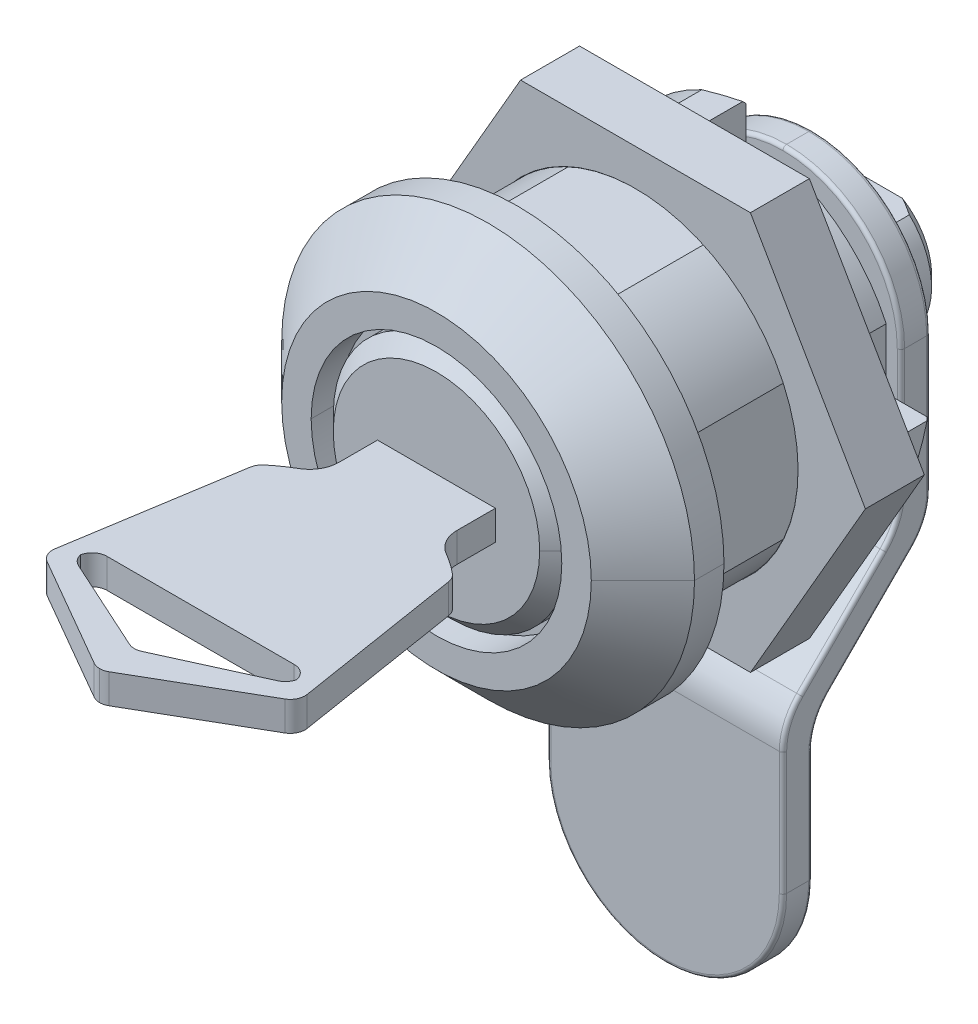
ISO-10303-21;
HEADER;
FILE_DESCRIPTION(('STEP AP214'),'2;1');
FILE_NAME('part.step','',(''),(''),'','','');
FILE_SCHEMA(('AUTOMOTIVE_DESIGN { 1 0 10303 214 1 1 1 1 }'));
ENDSEC;
DATA;
#1=APPLICATION_CONTEXT('core data for automotive mechanical design processes');
#2=APPLICATION_PROTOCOL_DEFINITION('international standard','automotive_design',2000,#1);
#3=PRODUCT_CONTEXT('',#1,'mechanical');
#4=PRODUCT('Part','Part','',(#3));
#5=PRODUCT_RELATED_PRODUCT_CATEGORY('part','',(#4));
#6=PRODUCT_DEFINITION_FORMATION('','',#4);
#7=PRODUCT_DEFINITION_CONTEXT('part definition',#1,'design');
#8=PRODUCT_DEFINITION('design','',#6,#7);
#9=PRODUCT_DEFINITION_SHAPE('','',#8);
#10=(LENGTH_UNIT() NAMED_UNIT(*) SI_UNIT(.MILLI.,.METRE.));
#11=(NAMED_UNIT(*) PLANE_ANGLE_UNIT() SI_UNIT($,.RADIAN.));
#12=(NAMED_UNIT(*) SI_UNIT($,.STERADIAN.) SOLID_ANGLE_UNIT());
#13=UNCERTAINTY_MEASURE_WITH_UNIT(LENGTH_MEASURE(1.E-05),#10,'distance_accuracy_value','');
#14=(GEOMETRIC_REPRESENTATION_CONTEXT(3) GLOBAL_UNCERTAINTY_ASSIGNED_CONTEXT((#13)) GLOBAL_UNIT_ASSIGNED_CONTEXT((#10,
#11,#12)) REPRESENTATION_CONTEXT('',''));
#15=CARTESIAN_POINT('',(0.,0.,0.));
#16=DIRECTION('',(0.,0.,1.));
#17=DIRECTION('',(1.,0.,0.));
#18=AXIS2_PLACEMENT_3D('',#15,#16,#17);
#19=CARTESIAN_POINT('',(654.281235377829,845.783244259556,1251.36373312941));
#20=DIRECTION('',(1.,0.,0.));
#21=DIRECTION('',(0.,-1.,0.));
#22=AXIS2_PLACEMENT_3D('',#19,#20,#21);
#23=TOROIDAL_SURFACE('',#22,4.25,0.25);
#24=CARTESIAN_POINT('',(654.281235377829,848.788448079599,1254.36893694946));
#25=DIRECTION('',(0.,-0.707106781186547,0.707106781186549));
#26=DIRECTION('',(0.,0.707106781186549,0.707106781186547));
#27=AXIS2_PLACEMENT_3D('',#24,#25,#26);
#28=CIRCLE('',#27,0.25);
#29=CARTESIAN_POINT('',(654.031235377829,848.788448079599,1254.36893694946));
#30=VERTEX_POINT('',#29);
#31=CARTESIAN_POINT('',(654.281235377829,848.611671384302,1254.19216025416));
#32=VERTEX_POINT('',#31);
#33=EDGE_CURVE('P0_E26',#30,#32,#28,.T.);
#34=ORIENTED_EDGE('',*,*,#33,.T.);
#35=CARTESIAN_POINT('',(654.281235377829,845.783244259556,1251.36373312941));
#36=DIRECTION('',(-1.,0.,0.));
#37=DIRECTION('',(0.,-1.,0.));
#38=AXIS2_PLACEMENT_3D('',#35,#36,#37);
#39=CIRCLE('',#38,4.);
#40=CARTESIAN_POINT('',(654.281235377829,845.783244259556,1255.36373312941));
#41=VERTEX_POINT('',#40);
#42=EDGE_CURVE('P0_E523',#41,#32,#39,.T.);
#43=ORIENTED_EDGE('',*,*,#42,.F.);
#44=CARTESIAN_POINT('',(654.281235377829,845.783244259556,1255.61373312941));
#45=DIRECTION('',(0.,1.,0.));
#46=DIRECTION('',(1.,0.,0.));
#47=AXIS2_PLACEMENT_3D('',#44,#45,#46);
#48=CIRCLE('',#47,0.25);
#49=CARTESIAN_POINT('',(654.031235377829,845.783244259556,1255.61373312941));
#50=VERTEX_POINT('',#49);
#51=EDGE_CURVE('P0_E11',#41,#50,#48,.T.);
#52=ORIENTED_EDGE('',*,*,#51,.T.);
#53=CARTESIAN_POINT('',(654.031235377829,845.783244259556,1251.36373312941));
#54=DIRECTION('',(1.,0.,0.));
#55=DIRECTION('',(0.,-1.,0.));
#56=AXIS2_PLACEMENT_3D('',#53,#54,#55);
#57=CIRCLE('',#56,4.25);
#58=EDGE_CURVE('P0_E405',#30,#50,#57,.T.);
#59=ORIENTED_EDGE('',*,*,#58,.F.);
#60=EDGE_LOOP('',(#34,#43,#52,#59));
#61=FACE_BOUND('',#60,.T.);
#62=ADVANCED_FACE('P0_F18',(#61),#23,.T.);
#63=CARTESIAN_POINT('',(654.281235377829,848.268525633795,1255.61373312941));
#64=DIRECTION('',(0.,-1.,0.));
#65=DIRECTION('',(-1.,0.,0.));
#66=AXIS2_PLACEMENT_3D('',#63,#64,#65);
#67=CYLINDRICAL_SURFACE('',#66,0.25);
#68=CARTESIAN_POINT('',(654.281235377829,838.268525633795,1255.61373312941));
#69=DIRECTION('',(0.,1.,0.));
#70=DIRECTION('',(1.,0.,0.));
#71=AXIS2_PLACEMENT_3D('',#68,#69,#70);
#72=CIRCLE('',#71,0.25);
#73=CARTESIAN_POINT('',(654.281235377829,838.268525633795,1255.36373312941));
#74=VERTEX_POINT('',#73);
#75=CARTESIAN_POINT('',(654.031235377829,838.268525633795,1255.61373312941));
#76=VERTEX_POINT('',#75);
#77=EDGE_CURVE('P0_E580',#74,#76,#72,.T.);
#78=ORIENTED_EDGE('',*,*,#77,.T.);
#79=DIRECTION('',(0.,-1.,0.));
#80=VECTOR('',#79,1.);
#81=CARTESIAN_POINT('',(654.031235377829,848.268525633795,1255.61373312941));
#82=LINE('',#81,#80);
#83=EDGE_CURVE('P0_E414',#50,#76,#82,.T.);
#84=ORIENTED_EDGE('',*,*,#83,.F.);
#85=ORIENTED_EDGE('',*,*,#51,.F.);
#86=DIRECTION('',(0.,1.,0.));
#87=VECTOR('',#86,1.);
#88=CARTESIAN_POINT('',(654.281235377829,830.268525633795,1255.36373312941));
#89=LINE('',#88,#87);
#90=EDGE_CURVE('P0_E377',#74,#41,#89,.T.);
#91=ORIENTED_EDGE('',*,*,#90,.F.);
#92=EDGE_LOOP('',(#78,#84,#85,#91));
#93=FACE_BOUND('',#92,.T.);
#94=ADVANCED_FACE('P0_F779',(#93),#67,.T.);
#95=CARTESIAN_POINT('',(654.281235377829,847.031088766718,1256.12629626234));
#96=DIRECTION('',(0.,-0.707106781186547,0.707106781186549));
#97=DIRECTION('',(0.,0.707106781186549,0.707106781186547));
#98=AXIS2_PLACEMENT_3D('',#95,#96,#97);
#99=CYLINDRICAL_SURFACE('',#98,0.25);
#100=CARTESIAN_POINT('',(654.281235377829,854.445302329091,1248.71208269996));
#101=DIRECTION('',(0.,-0.707106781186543,0.707106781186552));
#102=DIRECTION('',(0.,0.707106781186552,0.707106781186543));
#103=AXIS2_PLACEMENT_3D('',#100,#101,#102);
#104=CIRCLE('',#103,0.25);
#105=CARTESIAN_POINT('',(654.031235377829,854.445302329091,1248.71208269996));
#106=VERTEX_POINT('',#105);
#107=CARTESIAN_POINT('',(654.281235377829,854.268525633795,1248.53530600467));
#108=VERTEX_POINT('',#107);
#109=EDGE_CURVE('P0_E577',#106,#108,#104,.T.);
#110=ORIENTED_EDGE('',*,*,#109,.T.);
#111=DIRECTION('',(0.,0.707106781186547,-0.707106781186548));
#112=VECTOR('',#111,1.);
#113=CARTESIAN_POINT('',(654.281235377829,847.440098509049,1255.36373312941));
#114=LINE('',#113,#112);
#115=EDGE_CURVE('P0_E353',#32,#108,#114,.T.);
#116=ORIENTED_EDGE('',*,*,#115,.F.);
#117=ORIENTED_EDGE('',*,*,#33,.F.);
#118=DIRECTION('',(0.,-0.707106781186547,0.707106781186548));
#119=VECTOR('',#118,1.);
#120=CARTESIAN_POINT('',(654.031235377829,847.031088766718,1256.12629626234));
#121=LINE('',#120,#119);
#122=EDGE_CURVE('P0_E401',#106,#30,#121,.T.);
#123=ORIENTED_EDGE('',*,*,#122,.F.);
#124=EDGE_LOOP('',(#110,#116,#117,#123));
#125=FACE_BOUND('',#124,.T.);
#126=ADVANCED_FACE('P0_F598',(#125),#99,.T.);
#127=CARTESIAN_POINT('',(662.031235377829,838.268525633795,1255.61373312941));
#128=DIRECTION('',(0.,0.,1.));
#129=DIRECTION('',(1.,0.,0.));
#130=AXIS2_PLACEMENT_3D('',#127,#128,#129);
#131=TOROIDAL_SURFACE('',#130,7.75,0.25);
#132=CARTESIAN_POINT('',(662.031235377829,830.518525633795,1255.61373312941));
#133=DIRECTION('',(-1.,0.,0.));
#134=DIRECTION('',(0.,1.,0.));
#135=AXIS2_PLACEMENT_3D('',#132,#133,#134);
#136=CIRCLE('',#135,0.25);
#137=CARTESIAN_POINT('',(662.031235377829,830.518525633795,1255.36373312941));
#138=VERTEX_POINT('',#137);
#139=CARTESIAN_POINT('',(662.031235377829,830.268525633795,1255.61373312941));
#140=VERTEX_POINT('',#139);
#141=EDGE_CURVE('P0_E574',#138,#140,#136,.T.);
#142=ORIENTED_EDGE('',*,*,#141,.T.);
#143=CARTESIAN_POINT('',(662.031235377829,838.268525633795,1255.61373312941));
#144=DIRECTION('',(0.,0.,1.));
#145=DIRECTION('',(1.,0.,0.));
#146=AXIS2_PLACEMENT_3D('',#143,#144,#145);
#147=CIRCLE('',#146,8.);
#148=EDGE_CURVE('P0_E453',#76,#140,#147,.T.);
#149=ORIENTED_EDGE('',*,*,#148,.F.);
#150=ORIENTED_EDGE('',*,*,#77,.F.);
#151=CARTESIAN_POINT('',(662.031235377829,838.268525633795,1255.36373312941));
#152=DIRECTION('',(0.,0.,-1.));
#153=DIRECTION('',(1.,0.,0.));
#154=AXIS2_PLACEMENT_3D('',#151,#152,#153);
#155=CIRCLE('',#154,7.75);
#156=EDGE_CURVE('P0_E375',#138,#74,#155,.T.);
#157=ORIENTED_EDGE('',*,*,#156,.F.);
#158=EDGE_LOOP('',(#142,#149,#150,#157));
#159=FACE_BOUND('',#158,.T.);
#160=ADVANCED_FACE('P0_F787',(#159),#131,.T.);
#161=CARTESIAN_POINT('',(654.281235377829,857.096952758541,1251.36373312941));
#162=DIRECTION('',(1.,0.,0.));
#163=DIRECTION('',(0.,-1.,0.));
#164=AXIS2_PLACEMENT_3D('',#161,#162,#163);
#165=TOROIDAL_SURFACE('',#164,3.75,0.25);
#166=CARTESIAN_POINT('',(654.281235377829,857.096952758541,1247.61373312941));
#167=DIRECTION('',(0.,-1.,0.));
#168=DIRECTION('',(-1.,0.,0.));
#169=AXIS2_PLACEMENT_3D('',#166,#167,#168);
#170=CIRCLE('',#169,0.25);
#171=CARTESIAN_POINT('',(654.031235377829,857.096952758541,1247.61373312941));
#172=VERTEX_POINT('',#171);
#173=CARTESIAN_POINT('',(654.281235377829,857.096952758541,1247.36373312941));
#174=VERTEX_POINT('',#173);
#175=EDGE_CURVE('P0_E546',#172,#174,#170,.T.);
#176=ORIENTED_EDGE('',*,*,#175,.T.);
#177=CARTESIAN_POINT('',(654.281235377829,857.096952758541,1251.36373312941));
#178=DIRECTION('',(1.,0.,0.));
#179=DIRECTION('',(0.,-1.,0.));
#180=AXIS2_PLACEMENT_3D('',#177,#178,#179);
#181=CIRCLE('',#180,4.);
#182=EDGE_CURVE('P0_E515',#108,#174,#181,.T.);
#183=ORIENTED_EDGE('',*,*,#182,.F.);
#184=ORIENTED_EDGE('',*,*,#109,.F.);
#185=CARTESIAN_POINT('',(654.031235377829,857.096952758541,1251.36373312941));
#186=DIRECTION('',(-1.,0.,0.));
#187=DIRECTION('',(0.,-1.,0.));
#188=AXIS2_PLACEMENT_3D('',#185,#186,#187);
#189=CIRCLE('',#188,3.75);
#190=EDGE_CURVE('P0_E394',#172,#106,#189,.T.);
#191=ORIENTED_EDGE('',*,*,#190,.F.);
#192=EDGE_LOOP('',(#176,#183,#184,#191));
#193=FACE_BOUND('',#192,.T.);
#194=ADVANCED_FACE('P0_F792',(#193),#165,.T.);
#195=CARTESIAN_POINT('',(662.031235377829,838.268525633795,1255.61373312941));
#196=DIRECTION('',(0.,0.,1.));
#197=DIRECTION('',(1.,0.,0.));
#198=AXIS2_PLACEMENT_3D('',#195,#196,#197);
#199=TOROIDAL_SURFACE('',#198,7.75,0.25);
#200=CARTESIAN_POINT('',(669.781235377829,838.268525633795,1255.61373312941));
#201=DIRECTION('',(0.,-1.,0.));
#202=DIRECTION('',(-1.,0.,0.));
#203=AXIS2_PLACEMENT_3D('',#200,#201,#202);
#204=CIRCLE('',#203,0.25);
#205=CARTESIAN_POINT('',(669.781235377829,838.268525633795,1255.36373312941));
#206=VERTEX_POINT('',#205);
#207=CARTESIAN_POINT('',(670.031235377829,838.268525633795,1255.61373312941));
#208=VERTEX_POINT('',#207);
#209=EDGE_CURVE('P0_E543',#206,#208,#204,.T.);
#210=ORIENTED_EDGE('',*,*,#209,.T.);
#211=CARTESIAN_POINT('',(662.031235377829,838.268525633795,1255.61373312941));
#212=DIRECTION('',(0.,0.,1.));
#213=DIRECTION('',(1.,0.,0.));
#214=AXIS2_PLACEMENT_3D('',#211,#212,#213);
#215=CIRCLE('',#214,8.);
#216=EDGE_CURVE('P0_E452',#140,#208,#215,.T.);
#217=ORIENTED_EDGE('',*,*,#216,.F.);
#218=ORIENTED_EDGE('',*,*,#141,.F.);
#219=CARTESIAN_POINT('',(662.031235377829,838.268525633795,1255.36373312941));
#220=DIRECTION('',(0.,0.,-1.));
#221=DIRECTION('',(1.,0.,0.));
#222=AXIS2_PLACEMENT_3D('',#219,#220,#221);
#223=CIRCLE('',#222,7.75);
#224=EDGE_CURVE('P0_E371',#206,#138,#223,.T.);
#225=ORIENTED_EDGE('',*,*,#224,.F.);
#226=EDGE_LOOP('',(#210,#217,#218,#225));
#227=FACE_BOUND('',#226,.T.);
#228=ADVANCED_FACE('P0_F797',(#227),#199,.T.);
#229=CARTESIAN_POINT('',(654.281235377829,848.268525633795,1247.61373312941));
#230=DIRECTION('',(0.,-1.,0.));
#231=DIRECTION('',(-1.,0.,0.));
#232=AXIS2_PLACEMENT_3D('',#229,#230,#231);
#233=CYLINDRICAL_SURFACE('',#232,0.25);
#234=CARTESIAN_POINT('',(654.281235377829,866.268525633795,1247.61373312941));
#235=DIRECTION('',(0.,-1.,0.));
#236=DIRECTION('',(-1.,0.,0.));
#237=AXIS2_PLACEMENT_3D('',#234,#235,#236);
#238=CIRCLE('',#237,0.25);
#239=CARTESIAN_POINT('',(654.031235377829,866.268525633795,1247.61373312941));
#240=VERTEX_POINT('',#239);
#241=CARTESIAN_POINT('',(654.281235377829,866.268525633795,1247.36373312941));
#242=VERTEX_POINT('',#241);
#243=EDGE_CURVE('P0_E547',#240,#242,#238,.T.);
#244=ORIENTED_EDGE('',*,*,#243,.T.);
#245=DIRECTION('',(0.,1.,0.));
#246=VECTOR('',#245,1.);
#247=CARTESIAN_POINT('',(654.281235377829,855.440098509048,1247.36373312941));
#248=LINE('',#247,#246);
#249=EDGE_CURVE('P0_E652',#174,#242,#248,.T.);
#250=ORIENTED_EDGE('',*,*,#249,.F.);
#251=ORIENTED_EDGE('',*,*,#175,.F.);
#252=DIRECTION('',(0.,-1.,0.));
#253=VECTOR('',#252,1.);
#254=CARTESIAN_POINT('',(654.031235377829,848.268525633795,1247.61373312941));
#255=LINE('',#254,#253);
#256=EDGE_CURVE('P0_E390',#240,#172,#255,.T.);
#257=ORIENTED_EDGE('',*,*,#256,.F.);
#258=EDGE_LOOP('',(#244,#250,#251,#257));
#259=FACE_BOUND('',#258,.T.);
#260=ADVANCED_FACE('P0_F685',(#259),#233,.T.);
#261=CARTESIAN_POINT('',(669.781235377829,830.268525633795,1255.61373312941));
#262=DIRECTION('',(0.,1.,0.));
#263=DIRECTION('',(1.,0.,0.));
#264=AXIS2_PLACEMENT_3D('',#261,#262,#263);
#265=CYLINDRICAL_SURFACE('',#264,0.25);
#266=CARTESIAN_POINT('',(669.781235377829,845.783244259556,1255.61373312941));
#267=DIRECTION('',(0.,-1.,0.));
#268=DIRECTION('',(-1.,0.,0.));
#269=AXIS2_PLACEMENT_3D('',#266,#267,#268);
#270=CIRCLE('',#269,0.25);
#271=CARTESIAN_POINT('',(669.781235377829,845.783244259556,1255.36373312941));
#272=VERTEX_POINT('',#271);
#273=CARTESIAN_POINT('',(670.031235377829,845.783244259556,1255.61373312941));
#274=VERTEX_POINT('',#273);
#275=EDGE_CURVE('P0_E567',#272,#274,#270,.T.);
#276=ORIENTED_EDGE('',*,*,#275,.T.);
#277=DIRECTION('',(0.,1.,0.));
#278=VECTOR('',#277,1.);
#279=CARTESIAN_POINT('',(670.031235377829,845.783244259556,1255.61373312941));
#280=LINE('',#279,#278);
#281=EDGE_CURVE('P0_E454',#208,#274,#280,.T.);
#282=ORIENTED_EDGE('',*,*,#281,.F.);
#283=ORIENTED_EDGE('',*,*,#209,.F.);
#284=DIRECTION('',(0.,-1.,0.));
#285=VECTOR('',#284,1.);
#286=CARTESIAN_POINT('',(669.781235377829,838.268525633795,1255.36373312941));
#287=LINE('',#286,#285);
#288=EDGE_CURVE('P0_E376',#272,#206,#287,.T.);
#289=ORIENTED_EDGE('',*,*,#288,.F.);
#290=EDGE_LOOP('',(#276,#282,#283,#289));
#291=FACE_BOUND('',#290,.T.);
#292=ADVANCED_FACE('P0_F796',(#291),#265,.T.);
#293=CARTESIAN_POINT('',(662.031235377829,866.268525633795,1247.61373312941));
#294=DIRECTION('',(0.,0.,1.));
#295=DIRECTION('',(1.,0.,0.));
#296=AXIS2_PLACEMENT_3D('',#293,#294,#295);
#297=TOROIDAL_SURFACE('',#296,7.75,0.25);
#298=CARTESIAN_POINT('',(662.031235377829,874.018525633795,1247.61373312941));
#299=DIRECTION('',(-1.,0.,0.));
#300=DIRECTION('',(0.,1.,0.));
#301=AXIS2_PLACEMENT_3D('',#298,#299,#300);
#302=CIRCLE('',#301,0.25);
#303=CARTESIAN_POINT('',(662.031235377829,874.268525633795,1247.61373312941));
#304=VERTEX_POINT('',#303);
#305=CARTESIAN_POINT('',(662.031235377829,874.018525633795,1247.36373312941));
#306=VERTEX_POINT('',#305);
#307=EDGE_CURVE('P0_E39',#304,#306,#302,.T.);
#308=ORIENTED_EDGE('',*,*,#307,.T.);
#309=CARTESIAN_POINT('',(662.031235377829,866.268525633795,1247.36373312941));
#310=DIRECTION('',(0.,0.,-1.));
#311=DIRECTION('',(1.,0.,0.));
#312=AXIS2_PLACEMENT_3D('',#309,#310,#311);
#313=CIRCLE('',#312,7.75);
#314=EDGE_CURVE('P0_E656',#242,#306,#313,.T.);
#315=ORIENTED_EDGE('',*,*,#314,.F.);
#316=ORIENTED_EDGE('',*,*,#243,.F.);
#317=CARTESIAN_POINT('',(662.031235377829,866.268525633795,1247.61373312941));
#318=DIRECTION('',(0.,0.,1.));
#319=DIRECTION('',(1.,0.,0.));
#320=AXIS2_PLACEMENT_3D('',#317,#318,#319);
#321=CIRCLE('',#320,8.);
#322=EDGE_CURVE('P0_E366',#304,#240,#321,.T.);
#323=ORIENTED_EDGE('',*,*,#322,.F.);
#324=EDGE_LOOP('',(#308,#315,#316,#323));
#325=FACE_BOUND('',#324,.T.);
#326=ADVANCED_FACE('P0_F690',(#325),#297,.T.);
#327=CARTESIAN_POINT('',(669.781235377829,845.783244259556,1251.36373312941));
#328=DIRECTION('',(1.,0.,0.));
#329=DIRECTION('',(0.,-1.,0.));
#330=AXIS2_PLACEMENT_3D('',#327,#328,#329);
#331=TOROIDAL_SURFACE('',#330,4.25,0.25);
#332=CARTESIAN_POINT('',(669.781235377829,848.788448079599,1254.36893694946));
#333=DIRECTION('',(0.,-0.707106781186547,0.707106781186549));
#334=DIRECTION('',(0.,0.707106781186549,0.707106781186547));
#335=AXIS2_PLACEMENT_3D('',#332,#333,#334);
#336=CIRCLE('',#335,0.25);
#337=CARTESIAN_POINT('',(669.781235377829,848.611671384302,1254.19216025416));
#338=VERTEX_POINT('',#337);
#339=CARTESIAN_POINT('',(670.031235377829,848.788448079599,1254.36893694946));
#340=VERTEX_POINT('',#339);
#341=EDGE_CURVE('P0_E524',#338,#340,#336,.T.);
#342=ORIENTED_EDGE('',*,*,#341,.T.);
#343=CARTESIAN_POINT('',(670.031235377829,845.783244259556,1251.36373312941));
#344=DIRECTION('',(-1.,0.,0.));
#345=DIRECTION('',(0.,-1.,0.));
#346=AXIS2_PLACEMENT_3D('',#343,#344,#345);
#347=CIRCLE('',#346,4.25);
#348=EDGE_CURVE('P0_E458',#274,#340,#347,.T.);
#349=ORIENTED_EDGE('',*,*,#348,.F.);
#350=ORIENTED_EDGE('',*,*,#275,.F.);
#351=CARTESIAN_POINT('',(669.781235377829,845.783244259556,1251.36373312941));
#352=DIRECTION('',(1.,0.,0.));
#353=DIRECTION('',(0.,-1.,0.));
#354=AXIS2_PLACEMENT_3D('',#351,#352,#353);
#355=CIRCLE('',#354,4.);
#356=EDGE_CURVE('P0_E531',#338,#272,#355,.T.);
#357=ORIENTED_EDGE('',*,*,#356,.F.);
#358=EDGE_LOOP('',(#342,#349,#350,#357));
#359=FACE_BOUND('',#358,.T.);
#360=ADVANCED_FACE('P0_F801',(#359),#331,.T.);
#361=CARTESIAN_POINT('',(662.031235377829,866.268525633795,1247.61373312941));
#362=DIRECTION('',(0.,0.,1.));
#363=DIRECTION('',(1.,0.,0.));
#364=AXIS2_PLACEMENT_3D('',#361,#362,#363);
#365=TOROIDAL_SURFACE('',#364,7.75,0.25);
#366=CARTESIAN_POINT('',(669.781235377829,866.268525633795,1247.61373312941));
#367=DIRECTION('',(0.,1.,0.));
#368=DIRECTION('',(1.,0.,0.));
#369=AXIS2_PLACEMENT_3D('',#366,#367,#368);
#370=CIRCLE('',#369,0.25);
#371=CARTESIAN_POINT('',(670.031235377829,866.268525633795,1247.61373312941));
#372=VERTEX_POINT('',#371);
#373=CARTESIAN_POINT('',(669.781235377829,866.268525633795,1247.36373312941));
#374=VERTEX_POINT('',#373);
#375=EDGE_CURVE('P0_E527',#372,#374,#370,.T.);
#376=ORIENTED_EDGE('',*,*,#375,.T.);
#377=CARTESIAN_POINT('',(662.031235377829,866.268525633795,1247.36373312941));
#378=DIRECTION('',(0.,0.,-1.));
#379=DIRECTION('',(1.,0.,0.));
#380=AXIS2_PLACEMENT_3D('',#377,#378,#379);
#381=CIRCLE('',#380,7.75);
#382=EDGE_CURVE('P0_E341',#306,#374,#381,.T.);
#383=ORIENTED_EDGE('',*,*,#382,.F.);
#384=ORIENTED_EDGE('',*,*,#307,.F.);
#385=CARTESIAN_POINT('',(662.031235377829,866.268525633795,1247.61373312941));
#386=DIRECTION('',(0.,0.,1.));
#387=DIRECTION('',(1.,0.,0.));
#388=AXIS2_PLACEMENT_3D('',#385,#386,#387);
#389=CIRCLE('',#388,8.);
#390=EDGE_CURVE('P0_E365',#372,#304,#389,.T.);
#391=ORIENTED_EDGE('',*,*,#390,.F.);
#392=EDGE_LOOP('',(#376,#383,#384,#391));
#393=FACE_BOUND('',#392,.T.);
#394=ADVANCED_FACE('P0_F672',(#393),#365,.T.);
#395=CARTESIAN_POINT('',(669.781235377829,847.616875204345,1255.54050982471));
#396=DIRECTION('',(0.,0.707106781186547,-0.707106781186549));
#397=DIRECTION('',(0.,-0.707106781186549,-0.707106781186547));
#398=AXIS2_PLACEMENT_3D('',#395,#396,#397);
#399=CYLINDRICAL_SURFACE('',#398,0.25);
#400=CARTESIAN_POINT('',(669.781235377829,854.445302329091,1248.71208269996));
#401=DIRECTION('',(0.,-0.707106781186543,0.707106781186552));
#402=DIRECTION('',(0.,0.707106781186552,0.707106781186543));
#403=AXIS2_PLACEMENT_3D('',#400,#401,#402);
#404=CIRCLE('',#403,0.25);
#405=CARTESIAN_POINT('',(669.781235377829,854.268525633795,1248.53530600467));
#406=VERTEX_POINT('',#405);
#407=CARTESIAN_POINT('',(670.031235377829,854.445302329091,1248.71208269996));
#408=VERTEX_POINT('',#407);
#409=EDGE_CURVE('P0_E511',#406,#408,#404,.T.);
#410=ORIENTED_EDGE('',*,*,#409,.T.);
#411=DIRECTION('',(0.,0.707106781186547,-0.707106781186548));
#412=VECTOR('',#411,1.);
#413=CARTESIAN_POINT('',(670.031235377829,854.445302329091,1248.71208269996));
#414=LINE('',#413,#412);
#415=EDGE_CURVE('P0_E443',#340,#408,#414,.T.);
#416=ORIENTED_EDGE('',*,*,#415,.F.);
#417=ORIENTED_EDGE('',*,*,#341,.F.);
#418=DIRECTION('',(0.,-0.707106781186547,0.707106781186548));
#419=VECTOR('',#418,1.);
#420=CARTESIAN_POINT('',(669.781235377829,848.611671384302,1254.19216025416));
#421=LINE('',#420,#419);
#422=EDGE_CURVE('P0_E370',#406,#338,#421,.T.);
#423=ORIENTED_EDGE('',*,*,#422,.F.);
#424=EDGE_LOOP('',(#410,#416,#417,#423));
#425=FACE_BOUND('',#424,.T.);
#426=ADVANCED_FACE('P0_F808',(#425),#399,.T.);
#427=CARTESIAN_POINT('',(669.781235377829,855.440098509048,1247.61373312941));
#428=DIRECTION('',(0.,1.,0.));
#429=DIRECTION('',(1.,0.,0.));
#430=AXIS2_PLACEMENT_3D('',#427,#428,#429);
#431=CYLINDRICAL_SURFACE('',#430,0.25);
#432=CARTESIAN_POINT('',(669.781235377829,857.096952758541,1247.61373312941));
#433=DIRECTION('',(0.,1.,0.));
#434=DIRECTION('',(1.,0.,0.));
#435=AXIS2_PLACEMENT_3D('',#432,#433,#434);
#436=CIRCLE('',#435,0.25);
#437=CARTESIAN_POINT('',(670.031235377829,857.096952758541,1247.61373312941));
#438=VERTEX_POINT('',#437);
#439=CARTESIAN_POINT('',(669.781235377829,857.096952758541,1247.36373312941));
#440=VERTEX_POINT('',#439);
#441=EDGE_CURVE('P0_E560',#438,#440,#436,.T.);
#442=ORIENTED_EDGE('',*,*,#441,.T.);
#443=DIRECTION('',(0.,-1.,0.));
#444=VECTOR('',#443,1.);
#445=CARTESIAN_POINT('',(669.781235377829,857.096952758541,1247.36373312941));
#446=LINE('',#445,#444);
#447=EDGE_CURVE('P0_E332',#374,#440,#446,.T.);
#448=ORIENTED_EDGE('',*,*,#447,.F.);
#449=ORIENTED_EDGE('',*,*,#375,.F.);
#450=DIRECTION('',(0.,1.,0.));
#451=VECTOR('',#450,1.);
#452=CARTESIAN_POINT('',(670.031235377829,866.268525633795,1247.61373312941));
#453=LINE('',#452,#451);
#454=EDGE_CURVE('P0_E442',#438,#372,#453,.T.);
#455=ORIENTED_EDGE('',*,*,#454,.F.);
#456=EDGE_LOOP('',(#442,#448,#449,#455));
#457=FACE_BOUND('',#456,.T.);
#458=ADVANCED_FACE('P0_F676',(#457),#431,.T.);
#459=CARTESIAN_POINT('',(669.781235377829,857.096952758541,1251.36373312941));
#460=DIRECTION('',(1.,0.,0.));
#461=DIRECTION('',(0.,-1.,0.));
#462=AXIS2_PLACEMENT_3D('',#459,#460,#461);
#463=TOROIDAL_SURFACE('',#462,3.75,0.25);
#464=ORIENTED_EDGE('',*,*,#409,.F.);
#465=CARTESIAN_POINT('',(669.781235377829,857.096952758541,1251.36373312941));
#466=DIRECTION('',(-1.,0.,0.));
#467=DIRECTION('',(0.,-1.,0.));
#468=AXIS2_PLACEMENT_3D('',#465,#466,#467);
#469=CIRCLE('',#468,4.);
#470=EDGE_CURVE('P0_E519',#440,#406,#469,.T.);
#471=ORIENTED_EDGE('',*,*,#470,.F.);
#472=ORIENTED_EDGE('',*,*,#441,.F.);
#473=CARTESIAN_POINT('',(670.031235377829,857.096952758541,1251.36373312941));
#474=DIRECTION('',(1.,0.,0.));
#475=DIRECTION('',(0.,-1.,0.));
#476=AXIS2_PLACEMENT_3D('',#473,#474,#475);
#477=CIRCLE('',#476,3.75);
#478=EDGE_CURVE('P0_E438',#408,#438,#477,.T.);
#479=ORIENTED_EDGE('',*,*,#478,.F.);
#480=EDGE_LOOP('',(#464,#471,#472,#479));
#481=FACE_BOUND('',#480,.T.);
#482=ADVANCED_FACE('P0_F680',(#481),#463,.T.);
#483=CARTESIAN_POINT('',(669.781235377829,846.611671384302,1253.36373312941));
#484=DIRECTION('',(1.,0.,0.));
#485=DIRECTION('',(0.,-1.,0.));
#486=AXIS2_PLACEMENT_3D('',#483,#484,#485);
#487=TOROIDAL_SURFACE('',#486,3.75,0.25);
#488=CARTESIAN_POINT('',(669.781235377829,849.263321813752,1256.01538355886));
#489=DIRECTION('',(0.,-0.707106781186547,0.707106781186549));
#490=DIRECTION('',(0.,0.707106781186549,0.707106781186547));
#491=AXIS2_PLACEMENT_3D('',#488,#489,#490);
#492=CIRCLE('',#491,0.25);
#493=CARTESIAN_POINT('',(670.031235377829,849.263321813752,1256.01538355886));
#494=VERTEX_POINT('',#493);
#495=CARTESIAN_POINT('',(669.781235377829,849.440098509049,1256.19216025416));
#496=VERTEX_POINT('',#495);
#497=EDGE_CURVE('P0_E406',#494,#496,#492,.T.);
#498=ORIENTED_EDGE('',*,*,#497,.T.);
#499=CARTESIAN_POINT('',(669.781235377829,846.611671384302,1253.36373312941));
#500=DIRECTION('',(-1.,0.,0.));
#501=DIRECTION('',(0.,-1.,0.));
#502=AXIS2_PLACEMENT_3D('',#499,#500,#501);
#503=CIRCLE('',#502,4.);
#504=CARTESIAN_POINT('',(669.781235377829,846.611671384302,1257.36373312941));
#505=VERTEX_POINT('',#504);
#506=EDGE_CURVE('P0_E504',#505,#496,#503,.T.);
#507=ORIENTED_EDGE('',*,*,#506,.F.);
#508=CARTESIAN_POINT('',(669.781235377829,846.611671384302,1257.11373312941));
#509=DIRECTION('',(0.,1.,0.));
#510=DIRECTION('',(1.,0.,0.));
#511=AXIS2_PLACEMENT_3D('',#508,#509,#510);
#512=CIRCLE('',#511,0.25);
#513=CARTESIAN_POINT('',(670.031235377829,846.611671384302,1257.11373312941));
#514=VERTEX_POINT('',#513);
#515=EDGE_CURVE('P0_E409',#505,#514,#512,.T.);
#516=ORIENTED_EDGE('',*,*,#515,.T.);
#517=CARTESIAN_POINT('',(670.031235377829,846.611671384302,1253.36373312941));
#518=DIRECTION('',(1.,0.,0.));
#519=DIRECTION('',(0.,-1.,0.));
#520=AXIS2_PLACEMENT_3D('',#517,#518,#519);
#521=CIRCLE('',#520,3.75);
#522=EDGE_CURVE('P0_E437',#494,#514,#521,.T.);
#523=ORIENTED_EDGE('',*,*,#522,.F.);
#524=EDGE_LOOP('',(#498,#507,#516,#523));
#525=FACE_BOUND('',#524,.T.);
#526=ADVANCED_FACE('P0_F818',(#525),#487,.T.);
#527=CARTESIAN_POINT('',(669.781235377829,830.268525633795,1257.11373312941));
#528=DIRECTION('',(0.,-1.,0.));
#529=DIRECTION('',(-1.,0.,0.));
#530=AXIS2_PLACEMENT_3D('',#527,#528,#529);
#531=CYLINDRICAL_SURFACE('',#530,0.25);
#532=CARTESIAN_POINT('',(669.781235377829,838.268525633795,1257.11373312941));
#533=DIRECTION('',(0.,1.,0.));
#534=DIRECTION('',(1.,0.,0.));
#535=AXIS2_PLACEMENT_3D('',#532,#533,#534);
#536=CIRCLE('',#535,0.25);
#537=CARTESIAN_POINT('',(669.781235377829,838.268525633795,1257.36373312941));
#538=VERTEX_POINT('',#537);
#539=CARTESIAN_POINT('',(670.031235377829,838.268525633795,1257.11373312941));
#540=VERTEX_POINT('',#539);
#541=EDGE_CURVE('P0_E410',#538,#540,#536,.T.);
#542=ORIENTED_EDGE('',*,*,#541,.T.);
#543=DIRECTION('',(0.,-1.,0.));
#544=VECTOR('',#543,1.);
#545=CARTESIAN_POINT('',(670.031235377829,838.268525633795,1257.11373312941));
#546=LINE('',#545,#544);
#547=EDGE_CURVE('P0_E446',#514,#540,#546,.T.);
#548=ORIENTED_EDGE('',*,*,#547,.F.);
#549=ORIENTED_EDGE('',*,*,#515,.F.);
#550=DIRECTION('',(0.,1.,0.));
#551=VECTOR('',#550,1.);
#552=CARTESIAN_POINT('',(669.781235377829,846.611671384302,1257.36373312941));
#553=LINE('',#552,#551);
#554=EDGE_CURVE('P0_E2222',#538,#505,#553,.T.);
#555=ORIENTED_EDGE('',*,*,#554,.F.);
#556=EDGE_LOOP('',(#542,#548,#549,#555));
#557=FACE_BOUND('',#556,.T.);
#558=ADVANCED_FACE('P0_F821',(#557),#531,.T.);
#559=CARTESIAN_POINT('',(669.781235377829,848.091748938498,1257.18695643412));
#560=DIRECTION('',(0.,-0.707106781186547,0.707106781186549));
#561=DIRECTION('',(0.,0.707106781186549,0.707106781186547));
#562=AXIS2_PLACEMENT_3D('',#559,#560,#561);
#563=CYLINDRICAL_SURFACE('',#562,0.25);
#564=CARTESIAN_POINT('',(669.781235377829,854.920176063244,1250.35852930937));
#565=DIRECTION('',(0.,-0.707106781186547,0.707106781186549));
#566=DIRECTION('',(0.,0.707106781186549,0.707106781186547));
#567=AXIS2_PLACEMENT_3D('',#564,#565,#566);
#568=CIRCLE('',#567,0.25);
#569=CARTESIAN_POINT('',(670.031235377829,854.920176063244,1250.35852930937));
#570=VERTEX_POINT('',#569);
#571=CARTESIAN_POINT('',(669.781235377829,855.096952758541,1250.53530600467));
#572=VERTEX_POINT('',#571);
#573=EDGE_CURVE('P0_E466',#570,#572,#568,.T.);
#574=ORIENTED_EDGE('',*,*,#573,.T.);
#575=DIRECTION('',(0.,0.707106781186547,-0.707106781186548));
#576=VECTOR('',#575,1.);
#577=CARTESIAN_POINT('',(669.781235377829,855.096952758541,1250.53530600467));
#578=LINE('',#577,#576);
#579=EDGE_CURVE('P0_E619',#496,#572,#578,.T.);
#580=ORIENTED_EDGE('',*,*,#579,.F.);
#581=ORIENTED_EDGE('',*,*,#497,.F.);
#582=DIRECTION('',(0.,-0.707106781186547,0.707106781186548));
#583=VECTOR('',#582,1.);
#584=CARTESIAN_POINT('',(670.031235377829,849.263321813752,1256.01538355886));
#585=LINE('',#584,#583);
#586=EDGE_CURVE('P0_E433',#570,#494,#585,.T.);
#587=ORIENTED_EDGE('',*,*,#586,.F.);
#588=EDGE_LOOP('',(#574,#580,#581,#587));
#589=FACE_BOUND('',#588,.T.);
#590=ADVANCED_FACE('P0_F827',(#589),#563,.T.);
#591=CARTESIAN_POINT('',(662.031235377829,838.268525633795,1257.11373312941));
#592=DIRECTION('',(0.,0.,-1.));
#593=DIRECTION('',(-1.,0.,0.));
#594=AXIS2_PLACEMENT_3D('',#591,#592,#593);
#595=TOROIDAL_SURFACE('',#594,7.75,0.25);
#596=CARTESIAN_POINT('',(662.031235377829,830.518525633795,1257.11373312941));
#597=DIRECTION('',(1.,0.,0.));
#598=DIRECTION('',(0.,-1.,0.));
#599=AXIS2_PLACEMENT_3D('',#596,#597,#598);
#600=CIRCLE('',#599,0.25);
#601=CARTESIAN_POINT('',(662.031235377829,830.518525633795,1257.36373312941));
#602=VERTEX_POINT('',#601);
#603=CARTESIAN_POINT('',(662.031235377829,830.268525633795,1257.11373312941));
#604=VERTEX_POINT('',#603);
#605=EDGE_CURVE('P0_E463',#602,#604,#600,.T.);
#606=ORIENTED_EDGE('',*,*,#605,.T.);
#607=CARTESIAN_POINT('',(662.031235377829,838.268525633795,1257.11373312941));
#608=DIRECTION('',(0.,0.,-1.));
#609=DIRECTION('',(-1.,0.,0.));
#610=AXIS2_PLACEMENT_3D('',#607,#608,#609);
#611=CIRCLE('',#610,8.);
#612=EDGE_CURVE('P0_E448',#540,#604,#611,.T.);
#613=ORIENTED_EDGE('',*,*,#612,.F.);
#614=ORIENTED_EDGE('',*,*,#541,.F.);
#615=CARTESIAN_POINT('',(662.031235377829,838.268525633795,1257.36373312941));
#616=DIRECTION('',(0.,0.,1.));
#617=DIRECTION('',(-1.,0.,0.));
#618=AXIS2_PLACEMENT_3D('',#615,#616,#617);
#619=CIRCLE('',#618,7.75);
#620=EDGE_CURVE('P0_E2229',#602,#538,#619,.T.);
#621=ORIENTED_EDGE('',*,*,#620,.F.);
#622=EDGE_LOOP('',(#606,#613,#614,#621));
#623=FACE_BOUND('',#622,.T.);
#624=ADVANCED_FACE('P0_F831',(#623),#595,.T.);
#625=CARTESIAN_POINT('',(669.781235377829,857.925379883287,1253.36373312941));
#626=DIRECTION('',(1.,0.,0.));
#627=DIRECTION('',(0.,-1.,0.));
#628=AXIS2_PLACEMENT_3D('',#625,#626,#627);
#629=TOROIDAL_SURFACE('',#628,4.25,0.25);
#630=CARTESIAN_POINT('',(669.781235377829,857.925379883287,1249.11373312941));
#631=DIRECTION('',(0.,-1.,0.));
#632=DIRECTION('',(-1.,0.,0.));
#633=AXIS2_PLACEMENT_3D('',#630,#631,#632);
#634=CIRCLE('',#633,0.25);
#635=CARTESIAN_POINT('',(670.031235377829,857.925379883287,1249.11373312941));
#636=VERTEX_POINT('',#635);
#637=CARTESIAN_POINT('',(669.781235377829,857.925379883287,1249.36373312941));
#638=VERTEX_POINT('',#637);
#639=EDGE_CURVE('P0_E467',#636,#638,#634,.T.);
#640=ORIENTED_EDGE('',*,*,#639,.T.);
#641=CARTESIAN_POINT('',(669.781235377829,857.925379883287,1253.36373312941));
#642=DIRECTION('',(1.,0.,0.));
#643=DIRECTION('',(0.,-1.,0.));
#644=AXIS2_PLACEMENT_3D('',#641,#642,#643);
#645=CIRCLE('',#644,4.);
#646=EDGE_CURVE('P0_E476',#572,#638,#645,.T.);
#647=ORIENTED_EDGE('',*,*,#646,.F.);
#648=ORIENTED_EDGE('',*,*,#573,.F.);
#649=CARTESIAN_POINT('',(670.031235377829,857.925379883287,1253.36373312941));
#650=DIRECTION('',(-1.,0.,0.));
#651=DIRECTION('',(0.,-1.,0.));
#652=AXIS2_PLACEMENT_3D('',#649,#650,#651);
#653=CIRCLE('',#652,4.25);
#654=EDGE_CURVE('P0_E477',#636,#570,#653,.T.);
#655=ORIENTED_EDGE('',*,*,#654,.F.);
#656=EDGE_LOOP('',(#640,#647,#648,#655));
#657=FACE_BOUND('',#656,.T.);
#658=ADVANCED_FACE('P0_F835',(#657),#629,.T.);
#659=CARTESIAN_POINT('',(662.031235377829,838.268525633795,1257.11373312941));
#660=DIRECTION('',(0.,0.,-1.));
#661=DIRECTION('',(-1.,0.,0.));
#662=AXIS2_PLACEMENT_3D('',#659,#660,#661);
#663=TOROIDAL_SURFACE('',#662,7.75,0.25);
#664=CARTESIAN_POINT('',(654.281235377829,838.268525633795,1257.11373312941));
#665=DIRECTION('',(0.,-1.,0.));
#666=DIRECTION('',(-1.,0.,0.));
#667=AXIS2_PLACEMENT_3D('',#664,#665,#666);
#668=CIRCLE('',#667,0.25);
#669=CARTESIAN_POINT('',(654.281235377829,838.268525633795,1257.36373312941));
#670=VERTEX_POINT('',#669);
#671=CARTESIAN_POINT('',(654.031235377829,838.268525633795,1257.11373312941));
#672=VERTEX_POINT('',#671);
#673=EDGE_CURVE('P0_E349',#670,#672,#668,.T.);
#674=ORIENTED_EDGE('',*,*,#673,.T.);
#675=CARTESIAN_POINT('',(662.031235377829,838.268525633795,1257.11373312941));
#676=DIRECTION('',(0.,0.,-1.));
#677=DIRECTION('',(-1.,0.,0.));
#678=AXIS2_PLACEMENT_3D('',#675,#676,#677);
#679=CIRCLE('',#678,8.);
#680=EDGE_CURVE('P0_E432',#604,#672,#679,.T.);
#681=ORIENTED_EDGE('',*,*,#680,.F.);
#682=ORIENTED_EDGE('',*,*,#605,.F.);
#683=CARTESIAN_POINT('',(662.031235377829,838.268525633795,1257.36373312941));
#684=DIRECTION('',(0.,0.,1.));
#685=DIRECTION('',(-1.,0.,0.));
#686=AXIS2_PLACEMENT_3D('',#683,#684,#685);
#687=CIRCLE('',#686,7.75);
#688=EDGE_CURVE('P0_E725',#670,#602,#687,.T.);
#689=ORIENTED_EDGE('',*,*,#688,.F.);
#690=EDGE_LOOP('',(#674,#681,#682,#689));
#691=FACE_BOUND('',#690,.T.);
#692=ADVANCED_FACE('P0_F837',(#691),#663,.T.);
#693=CARTESIAN_POINT('',(669.781235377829,856.268525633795,1249.11373312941));
#694=DIRECTION('',(0.,-1.,0.));
#695=DIRECTION('',(0.,0.,1.));
#696=AXIS2_PLACEMENT_3D('',#693,#694,#695);
#697=CYLINDRICAL_SURFACE('',#696,0.25);
#698=CARTESIAN_POINT('',(669.781235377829,866.268525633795,1249.11373312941));
#699=DIRECTION('',(0.,-1.,0.));
#700=DIRECTION('',(-1.,0.,0.));
#701=AXIS2_PLACEMENT_3D('',#698,#699,#700);
#702=CIRCLE('',#701,0.25);
#703=CARTESIAN_POINT('',(670.031235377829,866.268525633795,1249.11373312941));
#704=VERTEX_POINT('',#703);
#705=CARTESIAN_POINT('',(669.781235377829,866.268525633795,1249.36373312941));
#706=VERTEX_POINT('',#705);
#707=EDGE_CURVE('P0_E346',#704,#706,#702,.T.);
#708=ORIENTED_EDGE('',*,*,#707,.T.);
#709=DIRECTION('',(0.,1.,0.));
#710=VECTOR('',#709,1.);
#711=CARTESIAN_POINT('',(669.781235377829,866.268525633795,1249.36373312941));
#712=LINE('',#711,#710);
#713=EDGE_CURVE('P0_E720',#638,#706,#712,.T.);
#714=ORIENTED_EDGE('',*,*,#713,.F.);
#715=ORIENTED_EDGE('',*,*,#639,.F.);
#716=DIRECTION('',(0.,-1.,0.));
#717=VECTOR('',#716,1.);
#718=CARTESIAN_POINT('',(670.031235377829,857.925379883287,1249.11373312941));
#719=LINE('',#718,#717);
#720=EDGE_CURVE('P0_E481',#704,#636,#719,.T.);
#721=ORIENTED_EDGE('',*,*,#720,.F.);
#722=EDGE_LOOP('',(#708,#714,#715,#721));
#723=FACE_BOUND('',#722,.T.);
#724=ADVANCED_FACE('P0_F840',(#723),#697,.T.);
#725=CARTESIAN_POINT('',(654.281235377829,848.268525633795,1257.11373312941));
#726=DIRECTION('',(0.,1.,0.));
#727=DIRECTION('',(1.,0.,0.));
#728=AXIS2_PLACEMENT_3D('',#725,#726,#727);
#729=CYLINDRICAL_SURFACE('',#728,0.25);
#730=CARTESIAN_POINT('',(654.281235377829,846.611671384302,1257.11373312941));
#731=DIRECTION('',(0.,-1.,0.));
#732=DIRECTION('',(-1.,0.,0.));
#733=AXIS2_PLACEMENT_3D('',#730,#731,#732);
#734=CIRCLE('',#733,0.25);
#735=CARTESIAN_POINT('',(654.281235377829,846.611671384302,1257.36373312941));
#736=VERTEX_POINT('',#735);
#737=CARTESIAN_POINT('',(654.031235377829,846.611671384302,1257.11373312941));
#738=VERTEX_POINT('',#737);
#739=EDGE_CURVE('P0_E350',#736,#738,#734,.T.);
#740=ORIENTED_EDGE('',*,*,#739,.T.);
#741=DIRECTION('',(0.,1.,0.));
#742=VECTOR('',#741,1.);
#743=CARTESIAN_POINT('',(654.031235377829,848.268525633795,1257.11373312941));
#744=LINE('',#743,#742);
#745=EDGE_CURVE('P0_E422',#672,#738,#744,.T.);
#746=ORIENTED_EDGE('',*,*,#745,.F.);
#747=ORIENTED_EDGE('',*,*,#673,.F.);
#748=DIRECTION('',(0.,-1.,0.));
#749=VECTOR('',#748,1.);
#750=CARTESIAN_POINT('',(654.281235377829,830.268525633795,1257.36373312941));
#751=LINE('',#750,#749);
#752=EDGE_CURVE('P0_E721',#736,#670,#751,.T.);
#753=ORIENTED_EDGE('',*,*,#752,.F.);
#754=EDGE_LOOP('',(#740,#746,#747,#753));
#755=FACE_BOUND('',#754,.T.);
#756=ADVANCED_FACE('P0_F844',(#755),#729,.T.);
#757=CARTESIAN_POINT('',(662.031235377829,866.268525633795,1249.11373312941));
#758=DIRECTION('',(0.,0.,-1.));
#759=DIRECTION('',(0.,-1.,0.));
#760=AXIS2_PLACEMENT_3D('',#757,#758,#759);
#761=TOROIDAL_SURFACE('',#760,7.75,0.25);
#762=CARTESIAN_POINT('',(662.031235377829,874.018525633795,1249.11373312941));
#763=DIRECTION('',(1.,0.,0.));
#764=DIRECTION('',(0.,-1.,0.));
#765=AXIS2_PLACEMENT_3D('',#762,#763,#764);
#766=CIRCLE('',#765,0.25);
#767=CARTESIAN_POINT('',(662.031235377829,874.268525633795,1249.11373312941));
#768=VERTEX_POINT('',#767);
#769=CARTESIAN_POINT('',(662.031235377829,874.018525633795,1249.36373312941));
#770=VERTEX_POINT('',#769);
#771=EDGE_CURVE('P0_E50',#768,#770,#766,.T.);
#772=ORIENTED_EDGE('',*,*,#771,.T.);
#773=CARTESIAN_POINT('',(662.031235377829,866.268525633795,1249.36373312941));
#774=DIRECTION('',(0.,0.,1.));
#775=DIRECTION('',(0.,-1.,0.));
#776=AXIS2_PLACEMENT_3D('',#773,#774,#775);
#777=CIRCLE('',#776,7.75);
#778=EDGE_CURVE('P0_E715',#706,#770,#777,.T.);
#779=ORIENTED_EDGE('',*,*,#778,.F.);
#780=ORIENTED_EDGE('',*,*,#707,.F.);
#781=CARTESIAN_POINT('',(662.031235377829,866.268525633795,1249.11373312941));
#782=DIRECTION('',(0.,0.,-1.));
#783=DIRECTION('',(0.,-1.,0.));
#784=AXIS2_PLACEMENT_3D('',#781,#782,#783);
#785=CIRCLE('',#784,8.);
#786=EDGE_CURVE('P0_E361',#768,#704,#785,.T.);
#787=ORIENTED_EDGE('',*,*,#786,.F.);
#788=EDGE_LOOP('',(#772,#779,#780,#787));
#789=FACE_BOUND('',#788,.T.);
#790=ADVANCED_FACE('P0_F846',(#789),#761,.T.);
#791=CARTESIAN_POINT('',(654.281235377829,846.611671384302,1253.36373312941));
#792=DIRECTION('',(1.,0.,0.));
#793=DIRECTION('',(0.,-1.,0.));
#794=AXIS2_PLACEMENT_3D('',#791,#792,#793);
#795=TOROIDAL_SURFACE('',#794,3.75,0.25);
#796=CARTESIAN_POINT('',(654.281235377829,849.263321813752,1256.01538355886));
#797=DIRECTION('',(0.,-0.707106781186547,0.707106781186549));
#798=DIRECTION('',(0.,0.707106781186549,0.707106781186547));
#799=AXIS2_PLACEMENT_3D('',#796,#797,#798);
#800=CIRCLE('',#799,0.25);
#801=CARTESIAN_POINT('',(654.281235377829,849.440098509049,1256.19216025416));
#802=VERTEX_POINT('',#801);
#803=CARTESIAN_POINT('',(654.031235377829,849.263321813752,1256.01538355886));
#804=VERTEX_POINT('',#803);
#805=EDGE_CURVE('P0_E538',#802,#804,#800,.T.);
#806=ORIENTED_EDGE('',*,*,#805,.T.);
#807=CARTESIAN_POINT('',(654.031235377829,846.611671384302,1253.36373312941));
#808=DIRECTION('',(-1.,0.,0.));
#809=DIRECTION('',(0.,-1.,0.));
#810=AXIS2_PLACEMENT_3D('',#807,#808,#809);
#811=CIRCLE('',#810,3.75);
#812=EDGE_CURVE('P0_E423',#738,#804,#811,.T.);
#813=ORIENTED_EDGE('',*,*,#812,.F.);
#814=ORIENTED_EDGE('',*,*,#739,.F.);
#815=CARTESIAN_POINT('',(654.281235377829,846.611671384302,1253.36373312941));
#816=DIRECTION('',(1.,0.,0.));
#817=DIRECTION('',(0.,-1.,0.));
#818=AXIS2_PLACEMENT_3D('',#815,#816,#817);
#819=CIRCLE('',#818,4.);
#820=EDGE_CURVE('P0_E508',#802,#736,#819,.T.);
#821=ORIENTED_EDGE('',*,*,#820,.F.);
#822=EDGE_LOOP('',(#806,#813,#814,#821));
#823=FACE_BOUND('',#822,.T.);
#824=ADVANCED_FACE('P0_F849',(#823),#795,.T.);
#825=CARTESIAN_POINT('',(662.031235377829,866.268525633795,1249.11373312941));
#826=DIRECTION('',(0.,0.,-1.));
#827=DIRECTION('',(0.,-1.,0.));
#828=AXIS2_PLACEMENT_3D('',#825,#826,#827);
#829=TOROIDAL_SURFACE('',#828,7.75,0.25);
#830=CARTESIAN_POINT('',(654.281235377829,866.268525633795,1249.11373312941));
#831=DIRECTION('',(0.,1.,0.));
#832=DIRECTION('',(1.,0.,0.));
#833=AXIS2_PLACEMENT_3D('',#830,#831,#832);
#834=CIRCLE('',#833,0.25);
#835=CARTESIAN_POINT('',(654.031235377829,866.268525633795,1249.11373312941));
#836=VERTEX_POINT('',#835);
#837=CARTESIAN_POINT('',(654.281235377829,866.268525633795,1249.36373312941));
#838=VERTEX_POINT('',#837);
#839=EDGE_CURVE('P0_E535',#836,#838,#834,.T.);
#840=ORIENTED_EDGE('',*,*,#839,.T.);
#841=CARTESIAN_POINT('',(662.031235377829,866.268525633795,1249.36373312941));
#842=DIRECTION('',(0.,0.,1.));
#843=DIRECTION('',(0.,-1.,0.));
#844=AXIS2_PLACEMENT_3D('',#841,#842,#843);
#845=CIRCLE('',#844,7.75);
#846=EDGE_CURVE('P0_E627',#770,#838,#845,.T.);
#847=ORIENTED_EDGE('',*,*,#846,.F.);
#848=ORIENTED_EDGE('',*,*,#771,.F.);
#849=CARTESIAN_POINT('',(662.031235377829,866.268525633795,1249.11373312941));
#850=DIRECTION('',(0.,0.,-1.));
#851=DIRECTION('',(0.,-1.,0.));
#852=AXIS2_PLACEMENT_3D('',#849,#850,#851);
#853=CIRCLE('',#852,8.);
#854=EDGE_CURVE('P0_E491',#836,#768,#853,.T.);
#855=ORIENTED_EDGE('',*,*,#854,.F.);
#856=EDGE_LOOP('',(#840,#847,#848,#855));
#857=FACE_BOUND('',#856,.T.);
#858=ADVANCED_FACE('P0_F853',(#857),#829,.T.);
#859=CARTESIAN_POINT('',(654.281235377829,848.091748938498,1257.18695643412));
#860=DIRECTION('',(0.,0.707106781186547,-0.707106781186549));
#861=DIRECTION('',(0.,-0.707106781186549,-0.707106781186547));
#862=AXIS2_PLACEMENT_3D('',#859,#860,#861);
#863=CYLINDRICAL_SURFACE('',#862,0.25);
#864=CARTESIAN_POINT('',(654.281235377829,854.920176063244,1250.35852930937));
#865=DIRECTION('',(0.,-0.707106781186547,0.707106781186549));
#866=DIRECTION('',(0.,0.707106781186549,0.707106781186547));
#867=AXIS2_PLACEMENT_3D('',#864,#865,#866);
#868=CIRCLE('',#867,0.25);
#869=CARTESIAN_POINT('',(654.281235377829,855.096952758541,1250.53530600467));
#870=VERTEX_POINT('',#869);
#871=CARTESIAN_POINT('',(654.031235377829,854.920176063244,1250.35852930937));
#872=VERTEX_POINT('',#871);
#873=EDGE_CURVE('P0_E313',#870,#872,#868,.T.);
#874=ORIENTED_EDGE('',*,*,#873,.T.);
#875=DIRECTION('',(0.,0.707106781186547,-0.707106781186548));
#876=VECTOR('',#875,1.);
#877=CARTESIAN_POINT('',(654.031235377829,848.091748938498,1257.18695643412));
#878=LINE('',#877,#876);
#879=EDGE_CURVE('P0_E427',#804,#872,#878,.T.);
#880=ORIENTED_EDGE('',*,*,#879,.F.);
#881=ORIENTED_EDGE('',*,*,#805,.F.);
#882=DIRECTION('',(0.,-0.707106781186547,0.707106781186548));
#883=VECTOR('',#882,1.);
#884=CARTESIAN_POINT('',(654.281235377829,848.268525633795,1257.36373312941));
#885=LINE('',#884,#883);
#886=EDGE_CURVE('P0_E620',#870,#802,#885,.T.);
#887=ORIENTED_EDGE('',*,*,#886,.F.);
#888=EDGE_LOOP('',(#874,#880,#881,#887));
#889=FACE_BOUND('',#888,.T.);
#890=ADVANCED_FACE('P0_F857',(#889),#863,.T.);
#891=CARTESIAN_POINT('',(654.281235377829,848.268525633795,1249.11373312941));
#892=DIRECTION('',(0.,1.,0.));
#893=DIRECTION('',(0.,0.,-1.));
#894=AXIS2_PLACEMENT_3D('',#891,#892,#893);
#895=CYLINDRICAL_SURFACE('',#894,0.25);
#896=CARTESIAN_POINT('',(654.281235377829,857.925379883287,1249.11373312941));
#897=DIRECTION('',(0.,1.,0.));
#898=DIRECTION('',(1.,0.,0.));
#899=AXIS2_PLACEMENT_3D('',#896,#897,#898);
#900=CIRCLE('',#899,0.25);
#901=CARTESIAN_POINT('',(654.031235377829,857.925379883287,1249.11373312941));
#902=VERTEX_POINT('',#901);
#903=CARTESIAN_POINT('',(654.281235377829,857.925379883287,1249.36373312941));
#904=VERTEX_POINT('',#903);
#905=EDGE_CURVE('P0_E384',#902,#904,#900,.T.);
#906=ORIENTED_EDGE('',*,*,#905,.T.);
#907=DIRECTION('',(0.,-1.,0.));
#908=VECTOR('',#907,1.);
#909=CARTESIAN_POINT('',(654.281235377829,856.268525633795,1249.36373312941));
#910=LINE('',#909,#908);
#911=EDGE_CURVE('P0_E631',#838,#904,#910,.T.);
#912=ORIENTED_EDGE('',*,*,#911,.F.);
#913=ORIENTED_EDGE('',*,*,#839,.F.);
#914=DIRECTION('',(0.,1.,0.));
#915=VECTOR('',#914,1.);
#916=CARTESIAN_POINT('',(654.031235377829,848.268525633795,1249.11373312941));
#917=LINE('',#916,#915);
#918=EDGE_CURVE('P0_E385',#902,#836,#917,.T.);
#919=ORIENTED_EDGE('',*,*,#918,.F.);
#920=EDGE_LOOP('',(#906,#912,#913,#919));
#921=FACE_BOUND('',#920,.T.);
#922=ADVANCED_FACE('P0_F858',(#921),#895,.T.);
#923=CARTESIAN_POINT('',(654.281235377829,857.925379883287,1253.36373312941));
#924=DIRECTION('',(1.,0.,0.));
#925=DIRECTION('',(0.,-1.,0.));
#926=AXIS2_PLACEMENT_3D('',#923,#924,#925);
#927=TOROIDAL_SURFACE('',#926,4.25,0.25);
#928=ORIENTED_EDGE('',*,*,#873,.F.);
#929=CARTESIAN_POINT('',(654.281235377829,857.925379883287,1253.36373312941));
#930=DIRECTION('',(-1.,0.,0.));
#931=DIRECTION('',(0.,-1.,0.));
#932=AXIS2_PLACEMENT_3D('',#929,#930,#931);
#933=CIRCLE('',#932,4.);
#934=EDGE_CURVE('P0_E472',#904,#870,#933,.T.);
#935=ORIENTED_EDGE('',*,*,#934,.F.);
#936=ORIENTED_EDGE('',*,*,#905,.F.);
#937=CARTESIAN_POINT('',(654.031235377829,857.925379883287,1253.36373312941));
#938=DIRECTION('',(1.,0.,0.));
#939=DIRECTION('',(0.,-1.,0.));
#940=AXIS2_PLACEMENT_3D('',#937,#938,#939);
#941=CIRCLE('',#940,4.25);
#942=EDGE_CURVE('P0_E381',#872,#902,#941,.T.);
#943=ORIENTED_EDGE('',*,*,#942,.F.);
#944=EDGE_LOOP('',(#928,#935,#936,#943));
#945=FACE_BOUND('',#944,.T.);
#946=ADVANCED_FACE('P0_F861',(#945),#927,.T.);
#947=CARTESIAN_POINT('',(666.406235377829,861.393525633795,1257.36373312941));
#948=DIRECTION('',(1.,0.,0.));
#949=DIRECTION('',(0.,0.,-1.));
#950=AXIS2_PLACEMENT_3D('',#947,#948,#949);
#951=PLANE('',#950);
#952=DIRECTION('',(0.,0.,-1.));
#953=VECTOR('',#952,1.);
#954=CARTESIAN_POINT('',(666.406235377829,870.143525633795,1257.36373312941));
#955=LINE('',#954,#953);
#956=CARTESIAN_POINT('',(666.406235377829,870.143525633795,1249.36373312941));
#957=VERTEX_POINT('',#956);
#958=CARTESIAN_POINT('',(666.406235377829,870.143525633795,1247.36373312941));
#959=VERTEX_POINT('',#958);
#960=EDGE_CURVE('P0_E328',#957,#959,#955,.T.);
#961=ORIENTED_EDGE('',*,*,#960,.T.);
#962=DIRECTION('',(0.,-1.,0.));
#963=VECTOR('',#962,1.);
#964=CARTESIAN_POINT('',(666.406235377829,861.393525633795,1247.36373312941));
#965=LINE('',#964,#963);
#966=CARTESIAN_POINT('',(666.406235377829,861.393525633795,1247.36373312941));
#967=VERTEX_POINT('',#966);
#968=EDGE_CURVE('P0_E321',#959,#967,#965,.T.);
#969=ORIENTED_EDGE('',*,*,#968,.T.);
#970=DIRECTION('',(0.,0.,-1.));
#971=VECTOR('',#970,1.);
#972=CARTESIAN_POINT('',(666.406235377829,861.393525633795,1257.36373312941));
#973=LINE('',#972,#971);
#974=CARTESIAN_POINT('',(666.406235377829,861.393525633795,1249.36373312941));
#975=VERTEX_POINT('',#974);
#976=EDGE_CURVE('P0_E301',#975,#967,#973,.T.);
#977=ORIENTED_EDGE('',*,*,#976,.F.);
#978=DIRECTION('',(0.,-1.,0.));
#979=VECTOR('',#978,1.);
#980=CARTESIAN_POINT('',(666.406235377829,856.268525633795,1249.36373312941));
#981=LINE('',#980,#979);
#982=EDGE_CURVE('P0_E642',#957,#975,#981,.T.);
#983=ORIENTED_EDGE('',*,*,#982,.F.);
#984=EDGE_LOOP('',(#961,#969,#977,#983));
#985=FACE_BOUND('',#984,.T.);
#986=ADVANCED_FACE('P0_F327',(#985),#951,.F.);
#987=CARTESIAN_POINT('',(666.406235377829,861.393525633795,1257.36373312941));
#988=DIRECTION('',(0.,-1.,0.));
#989=DIRECTION('',(1.,0.,0.));
#990=AXIS2_PLACEMENT_3D('',#987,#988,#989);
#991=PLANE('',#990);
#992=ORIENTED_EDGE('',*,*,#976,.T.);
#993=DIRECTION('',(-1.,0.,0.));
#994=VECTOR('',#993,1.);
#995=CARTESIAN_POINT('',(666.406235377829,861.393525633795,1247.36373312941));
#996=LINE('',#995,#994);
#997=CARTESIAN_POINT('',(657.656235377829,861.393525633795,1247.36373312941));
#998=VERTEX_POINT('',#997);
#999=EDGE_CURVE('P0_E304',#967,#998,#996,.T.);
#1000=ORIENTED_EDGE('',*,*,#999,.T.);
#1001=DIRECTION('',(0.,0.,-1.));
#1002=VECTOR('',#1001,1.);
#1003=CARTESIAN_POINT('',(657.656235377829,861.393525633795,1257.36373312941));
#1004=LINE('',#1003,#1002);
#1005=CARTESIAN_POINT('',(657.656235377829,861.393525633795,1249.36373312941));
#1006=VERTEX_POINT('',#1005);
#1007=EDGE_CURVE('P0_E314',#1006,#998,#1004,.T.);
#1008=ORIENTED_EDGE('',*,*,#1007,.F.);
#1009=DIRECTION('',(-1.,0.,0.));
#1010=VECTOR('',#1009,1.);
#1011=CARTESIAN_POINT('',(654.031235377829,861.393525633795,1249.36373312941));
#1012=LINE('',#1011,#1010);
#1013=EDGE_CURVE('P0_E307',#975,#1006,#1012,.T.);
#1014=ORIENTED_EDGE('',*,*,#1013,.F.);
#1015=EDGE_LOOP('',(#992,#1000,#1008,#1014));
#1016=FACE_BOUND('',#1015,.T.);
#1017=ADVANCED_FACE('P0_F303',(#1016),#991,.F.);
#1018=CARTESIAN_POINT('',(657.656235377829,861.393525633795,1257.36373312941));
#1019=DIRECTION('',(-1.,0.,0.));
#1020=DIRECTION('',(0.,0.,-1.));
#1021=AXIS2_PLACEMENT_3D('',#1018,#1019,#1020);
#1022=PLANE('',#1021);
#1023=ORIENTED_EDGE('',*,*,#1007,.T.);
#1024=DIRECTION('',(0.,1.,0.));
#1025=VECTOR('',#1024,1.);
#1026=CARTESIAN_POINT('',(657.656235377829,861.393525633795,1247.36373312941));
#1027=LINE('',#1026,#1025);
#1028=CARTESIAN_POINT('',(657.656235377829,870.143525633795,1247.36373312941));
#1029=VERTEX_POINT('',#1028);
#1030=EDGE_CURVE('P0_E323',#998,#1029,#1027,.T.);
#1031=ORIENTED_EDGE('',*,*,#1030,.T.);
#1032=DIRECTION('',(0.,0.,-1.));
#1033=VECTOR('',#1032,1.);
#1034=CARTESIAN_POINT('',(657.656235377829,870.143525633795,1257.36373312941));
#1035=LINE('',#1034,#1033);
#1036=CARTESIAN_POINT('',(657.656235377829,870.143525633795,1249.36373312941));
#1037=VERTEX_POINT('',#1036);
#1038=EDGE_CURVE('P0_E532',#1037,#1029,#1035,.T.);
#1039=ORIENTED_EDGE('',*,*,#1038,.F.);
#1040=DIRECTION('',(0.,1.,0.));
#1041=VECTOR('',#1040,1.);
#1042=CARTESIAN_POINT('',(657.656235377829,856.268525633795,1249.36373312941));
#1043=LINE('',#1042,#1041);
#1044=EDGE_CURVE('P0_E719',#1006,#1037,#1043,.T.);
#1045=ORIENTED_EDGE('',*,*,#1044,.F.);
#1046=EDGE_LOOP('',(#1023,#1031,#1039,#1045));
#1047=FACE_BOUND('',#1046,.T.);
#1048=ADVANCED_FACE('P0_F768',(#1047),#1022,.F.);
#1049=CARTESIAN_POINT('',(666.406235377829,870.143525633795,1257.36373312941));
#1050=DIRECTION('',(0.,1.,0.));
#1051=DIRECTION('',(0.,0.,1.));
#1052=AXIS2_PLACEMENT_3D('',#1049,#1050,#1051);
#1053=PLANE('',#1052);
#1054=ORIENTED_EDGE('',*,*,#1038,.T.);
#1055=DIRECTION('',(1.,0.,0.));
#1056=VECTOR('',#1055,1.);
#1057=CARTESIAN_POINT('',(666.406235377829,870.143525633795,1247.36373312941));
#1058=LINE('',#1057,#1056);
#1059=EDGE_CURVE('P0_E331',#1029,#959,#1058,.T.);
#1060=ORIENTED_EDGE('',*,*,#1059,.T.);
#1061=ORIENTED_EDGE('',*,*,#960,.F.);
#1062=DIRECTION('',(1.,0.,0.));
#1063=VECTOR('',#1062,1.);
#1064=CARTESIAN_POINT('',(654.031235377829,870.143525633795,1249.36373312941));
#1065=LINE('',#1064,#1063);
#1066=EDGE_CURVE('P0_E645',#1037,#957,#1065,.T.);
#1067=ORIENTED_EDGE('',*,*,#1066,.F.);
#1068=EDGE_LOOP('',(#1054,#1060,#1061,#1067));
#1069=FACE_BOUND('',#1068,.T.);
#1070=ADVANCED_FACE('P0_F766',(#1069),#1053,.F.);
#1071=CARTESIAN_POINT('',(654.031235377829,845.783244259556,1251.36373312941));
#1072=DIRECTION('',(-1.,0.,0.));
#1073=DIRECTION('',(0.,1.,0.));
#1074=AXIS2_PLACEMENT_3D('',#1071,#1072,#1073);
#1075=CYLINDRICAL_SURFACE('',#1074,4.);
#1076=DIRECTION('',(1.,0.,0.));
#1077=VECTOR('',#1076,1.);
#1078=CARTESIAN_POINT('',(670.031235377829,845.783244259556,1255.36373312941));
#1079=LINE('',#1078,#1077);
#1080=EDGE_CURVE('P0_E597',#41,#272,#1079,.T.);
#1081=ORIENTED_EDGE('',*,*,#1080,.F.);
#1082=ORIENTED_EDGE('',*,*,#42,.T.);
#1083=DIRECTION('',(-1.,0.,0.));
#1084=VECTOR('',#1083,1.);
#1085=CARTESIAN_POINT('',(654.031235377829,848.611671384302,1254.19216025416));
#1086=LINE('',#1085,#1084);
#1087=EDGE_CURVE('P0_E325',#338,#32,#1086,.T.);
#1088=ORIENTED_EDGE('',*,*,#1087,.F.);
#1089=ORIENTED_EDGE('',*,*,#356,.T.);
#1090=EDGE_LOOP('',(#1081,#1082,#1088,#1089));
#1091=FACE_BOUND('',#1090,.T.);
#1092=ADVANCED_FACE('P0_F594',(#1091),#1075,.F.);
#1093=CARTESIAN_POINT('',(654.031235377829,857.096952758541,1251.36373312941));
#1094=DIRECTION('',(1.,0.,0.));
#1095=DIRECTION('',(0.,-1.,0.));
#1096=AXIS2_PLACEMENT_3D('',#1093,#1094,#1095);
#1097=CYLINDRICAL_SURFACE('',#1096,4.);
#1098=DIRECTION('',(1.,0.,0.));
#1099=VECTOR('',#1098,1.);
#1100=CARTESIAN_POINT('',(654.031235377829,854.268525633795,1248.53530600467));
#1101=LINE('',#1100,#1099);
#1102=EDGE_CURVE('P0_E356',#108,#406,#1101,.T.);
#1103=ORIENTED_EDGE('',*,*,#1102,.F.);
#1104=ORIENTED_EDGE('',*,*,#182,.T.);
#1105=DIRECTION('',(-1.,0.,0.));
#1106=VECTOR('',#1105,1.);
#1107=CARTESIAN_POINT('',(654.031235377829,857.096952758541,1247.36373312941));
#1108=LINE('',#1107,#1106);
#1109=EDGE_CURVE('P0_E648',#440,#174,#1108,.T.);
#1110=ORIENTED_EDGE('',*,*,#1109,.F.);
#1111=ORIENTED_EDGE('',*,*,#470,.T.);
#1112=EDGE_LOOP('',(#1103,#1104,#1110,#1111));
#1113=FACE_BOUND('',#1112,.T.);
#1114=ADVANCED_FACE('P0_F682',(#1113),#1097,.T.);
#1115=CARTESIAN_POINT('',(654.031235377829,846.611671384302,1253.36373312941));
#1116=DIRECTION('',(1.,0.,0.));
#1117=DIRECTION('',(0.,-1.,0.));
#1118=AXIS2_PLACEMENT_3D('',#1115,#1116,#1117);
#1119=CYLINDRICAL_SURFACE('',#1118,4.);
#1120=DIRECTION('',(-1.,0.,0.));
#1121=VECTOR('',#1120,1.);
#1122=CARTESIAN_POINT('',(654.031235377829,846.611671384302,1257.36373312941));
#1123=LINE('',#1122,#1121);
#1124=EDGE_CURVE('P0_E726',#505,#736,#1123,.T.);
#1125=ORIENTED_EDGE('',*,*,#1124,.F.);
#1126=ORIENTED_EDGE('',*,*,#506,.T.);
#1127=DIRECTION('',(1.,0.,0.));
#1128=VECTOR('',#1127,1.);
#1129=CARTESIAN_POINT('',(654.031235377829,849.440098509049,1256.19216025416));
#1130=LINE('',#1129,#1128);
#1131=EDGE_CURVE('P0_E615',#802,#496,#1130,.T.);
#1132=ORIENTED_EDGE('',*,*,#1131,.F.);
#1133=ORIENTED_EDGE('',*,*,#820,.T.);
#1134=EDGE_LOOP('',(#1125,#1126,#1132,#1133));
#1135=FACE_BOUND('',#1134,.T.);
#1136=ADVANCED_FACE('P0_F874',(#1135),#1119,.T.);
#1137=CARTESIAN_POINT('',(654.031235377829,857.925379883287,1253.36373312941));
#1138=DIRECTION('',(-1.,0.,0.));
#1139=DIRECTION('',(0.,1.,0.));
#1140=AXIS2_PLACEMENT_3D('',#1137,#1138,#1139);
#1141=CYLINDRICAL_SURFACE('',#1140,4.);
#1142=DIRECTION('',(1.,0.,0.));
#1143=VECTOR('',#1142,1.);
#1144=CARTESIAN_POINT('',(670.031235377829,857.925379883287,1249.36373312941));
#1145=LINE('',#1144,#1143);
#1146=EDGE_CURVE('P0_E635',#904,#638,#1145,.T.);
#1147=ORIENTED_EDGE('',*,*,#1146,.F.);
#1148=ORIENTED_EDGE('',*,*,#934,.T.);
#1149=DIRECTION('',(-1.,0.,0.));
#1150=VECTOR('',#1149,1.);
#1151=CARTESIAN_POINT('',(654.031235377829,855.096952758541,1250.53530600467));
#1152=LINE('',#1151,#1150);
#1153=EDGE_CURVE('P0_E732',#572,#870,#1152,.T.);
#1154=ORIENTED_EDGE('',*,*,#1153,.F.);
#1155=ORIENTED_EDGE('',*,*,#646,.T.);
#1156=EDGE_LOOP('',(#1147,#1148,#1154,#1155));
#1157=FACE_BOUND('',#1156,.T.);
#1158=ADVANCED_FACE('P0_F877',(#1157),#1141,.F.);
#1159=CARTESIAN_POINT('',(662.031235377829,866.268525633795,1247.36373312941));
#1160=DIRECTION('',(0.,0.,1.));
#1161=DIRECTION('',(0.,1.,0.));
#1162=AXIS2_PLACEMENT_3D('',#1159,#1160,#1161);
#1163=CYLINDRICAL_SURFACE('',#1162,8.);
#1164=DIRECTION('',(0.,0.,1.));
#1165=VECTOR('',#1164,1.);
#1166=CARTESIAN_POINT('',(662.031235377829,874.268525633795,1247.36373312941));
#1167=LINE('',#1166,#1165);
#1168=EDGE_CURVE('P0_E492',#304,#768,#1167,.T.);
#1169=ORIENTED_EDGE('',*,*,#1168,.T.);
#1170=ORIENTED_EDGE('',*,*,#786,.T.);
#1171=DIRECTION('',(0.,0.,1.));
#1172=VECTOR('',#1171,1.);
#1173=CARTESIAN_POINT('',(670.031235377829,866.268525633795,1249.36373312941));
#1174=LINE('',#1173,#1172);
#1175=EDGE_CURVE('P0_E471',#372,#704,#1174,.T.);
#1176=ORIENTED_EDGE('',*,*,#1175,.F.);
#1177=ORIENTED_EDGE('',*,*,#390,.T.);
#1178=EDGE_LOOP('',(#1169,#1170,#1176,#1177));
#1179=FACE_BOUND('',#1178,.T.);
#1180=ADVANCED_FACE('P0_F697',(#1179),#1163,.T.);
#1181=CARTESIAN_POINT('',(662.031235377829,866.268525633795,1257.36373312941));
#1182=DIRECTION('',(0.,0.,-1.));
#1183=DIRECTION('',(0.,-1.,0.));
#1184=AXIS2_PLACEMENT_3D('',#1181,#1182,#1183);
#1185=CYLINDRICAL_SURFACE('',#1184,8.);
#1186=DIRECTION('',(0.,0.,-1.));
#1187=VECTOR('',#1186,1.);
#1188=CARTESIAN_POINT('',(654.031235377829,866.268525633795,1257.36373312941));
#1189=LINE('',#1188,#1187);
#1190=EDGE_CURVE('P0_E389',#836,#240,#1189,.T.);
#1191=ORIENTED_EDGE('',*,*,#1190,.F.);
#1192=ORIENTED_EDGE('',*,*,#854,.T.);
#1193=ORIENTED_EDGE('',*,*,#1168,.F.);
#1194=ORIENTED_EDGE('',*,*,#322,.T.);
#1195=EDGE_LOOP('',(#1191,#1192,#1193,#1194));
#1196=FACE_BOUND('',#1195,.T.);
#1197=ADVANCED_FACE('P0_F695',(#1196),#1185,.T.);
#1198=CARTESIAN_POINT('',(662.031235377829,838.268525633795,1257.36373312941));
#1199=DIRECTION('',(0.,0.,-1.));
#1200=DIRECTION('',(-1.,0.,0.));
#1201=AXIS2_PLACEMENT_3D('',#1198,#1199,#1200);
#1202=CYLINDRICAL_SURFACE('',#1201,8.);
#1203=DIRECTION('',(0.,0.,-1.));
#1204=VECTOR('',#1203,1.);
#1205=CARTESIAN_POINT('',(670.031235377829,838.268525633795,1255.36373312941));
#1206=LINE('',#1205,#1204);
#1207=EDGE_CURVE('P0_E459',#540,#208,#1206,.T.);
#1208=ORIENTED_EDGE('',*,*,#1207,.F.);
#1209=ORIENTED_EDGE('',*,*,#612,.T.);
#1210=DIRECTION('',(0.,0.,-1.));
#1211=VECTOR('',#1210,1.);
#1212=CARTESIAN_POINT('',(662.031235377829,830.268525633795,1257.36373312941));
#1213=LINE('',#1212,#1211);
#1214=EDGE_CURVE('P0_E428',#604,#140,#1213,.T.);
#1215=ORIENTED_EDGE('',*,*,#1214,.T.);
#1216=ORIENTED_EDGE('',*,*,#216,.T.);
#1217=EDGE_LOOP('',(#1208,#1209,#1215,#1216));
#1218=FACE_BOUND('',#1217,.T.);
#1219=ADVANCED_FACE('P0_F901',(#1218),#1202,.T.);
#1220=CARTESIAN_POINT('',(662.031235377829,838.268525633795,1257.36373312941));
#1221=DIRECTION('',(0.,0.,1.));
#1222=DIRECTION('',(1.,0.,0.));
#1223=AXIS2_PLACEMENT_3D('',#1220,#1221,#1222);
#1224=CYLINDRICAL_SURFACE('',#1223,8.);
#1225=ORIENTED_EDGE('',*,*,#1214,.F.);
#1226=ORIENTED_EDGE('',*,*,#680,.T.);
#1227=DIRECTION('',(0.,0.,1.));
#1228=VECTOR('',#1227,1.);
#1229=CARTESIAN_POINT('',(654.031235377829,838.268525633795,1257.36373312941));
#1230=LINE('',#1229,#1228);
#1231=EDGE_CURVE('P0_E418',#76,#672,#1230,.T.);
#1232=ORIENTED_EDGE('',*,*,#1231,.F.);
#1233=ORIENTED_EDGE('',*,*,#148,.T.);
#1234=EDGE_LOOP('',(#1225,#1226,#1232,#1233));
#1235=FACE_BOUND('',#1234,.T.);
#1236=ADVANCED_FACE('P0_F884',(#1235),#1224,.T.);
#1237=CARTESIAN_POINT('',(670.031235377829,848.268525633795,1257.36373312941));
#1238=DIRECTION('',(1.,0.,0.));
#1239=DIRECTION('',(0.,0.,-1.));
#1240=AXIS2_PLACEMENT_3D('',#1237,#1238,#1239);
#1241=PLANE('',#1240);
#1242=ORIENTED_EDGE('',*,*,#522,.T.);
#1243=ORIENTED_EDGE('',*,*,#547,.T.);
#1244=ORIENTED_EDGE('',*,*,#1207,.T.);
#1245=ORIENTED_EDGE('',*,*,#281,.T.);
#1246=ORIENTED_EDGE('',*,*,#348,.T.);
#1247=ORIENTED_EDGE('',*,*,#415,.T.);
#1248=ORIENTED_EDGE('',*,*,#478,.T.);
#1249=ORIENTED_EDGE('',*,*,#454,.T.);
#1250=ORIENTED_EDGE('',*,*,#1175,.T.);
#1251=ORIENTED_EDGE('',*,*,#720,.T.);
#1252=ORIENTED_EDGE('',*,*,#654,.T.);
#1253=ORIENTED_EDGE('',*,*,#586,.T.);
#1254=EDGE_LOOP('',(#1242,#1243,#1244,#1245,#1246,#1247,#1248,#1249,#1250,#1251,#1252,#1253));
#1255=FACE_BOUND('',#1254,.T.);
#1256=ADVANCED_FACE('P0_F704',(#1255),#1241,.T.);
#1257=CARTESIAN_POINT('',(654.031235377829,848.268525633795,1257.36373312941));
#1258=DIRECTION('',(1.,0.,0.));
#1259=DIRECTION('',(0.,0.,-1.));
#1260=AXIS2_PLACEMENT_3D('',#1257,#1258,#1259);
#1261=PLANE('',#1260);
#1262=ORIENTED_EDGE('',*,*,#942,.T.);
#1263=ORIENTED_EDGE('',*,*,#918,.T.);
#1264=ORIENTED_EDGE('',*,*,#1190,.T.);
#1265=ORIENTED_EDGE('',*,*,#256,.T.);
#1266=ORIENTED_EDGE('',*,*,#190,.T.);
#1267=ORIENTED_EDGE('',*,*,#122,.T.);
#1268=ORIENTED_EDGE('',*,*,#58,.T.);
#1269=ORIENTED_EDGE('',*,*,#83,.T.);
#1270=ORIENTED_EDGE('',*,*,#1231,.T.);
#1271=ORIENTED_EDGE('',*,*,#745,.T.);
#1272=ORIENTED_EDGE('',*,*,#812,.T.);
#1273=ORIENTED_EDGE('',*,*,#879,.T.);
#1274=EDGE_LOOP('',(#1262,#1263,#1264,#1265,#1266,#1267,#1268,#1269,#1270,#1271,#1272,#1273));
#1275=FACE_BOUND('',#1274,.T.);
#1276=ADVANCED_FACE('P0_F883',(#1275),#1261,.F.);
#1277=CARTESIAN_POINT('',(654.031235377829,830.268525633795,1255.36373312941));
#1278=DIRECTION('',(0.,0.,1.));
#1279=DIRECTION('',(0.,-1.,0.));
#1280=AXIS2_PLACEMENT_3D('',#1277,#1278,#1279);
#1281=PLANE('',#1280);
#1282=ORIENTED_EDGE('',*,*,#1080,.T.);
#1283=ORIENTED_EDGE('',*,*,#288,.T.);
#1284=ORIENTED_EDGE('',*,*,#224,.T.);
#1285=ORIENTED_EDGE('',*,*,#156,.T.);
#1286=ORIENTED_EDGE('',*,*,#90,.T.);
#1287=EDGE_LOOP('',(#1282,#1283,#1284,#1285,#1286));
#1288=FACE_BOUND('',#1287,.T.);
#1289=ADVANCED_FACE('P0_F890',(#1288),#1281,.F.);
#1290=CARTESIAN_POINT('',(654.031235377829,847.440098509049,1255.36373312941));
#1291=DIRECTION('',(0.,0.707106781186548,0.707106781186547));
#1292=DIRECTION('',(1.,0.,0.));
#1293=AXIS2_PLACEMENT_3D('',#1290,#1291,#1292);
#1294=PLANE('',#1293);
#1295=ORIENTED_EDGE('',*,*,#1087,.T.);
#1296=ORIENTED_EDGE('',*,*,#115,.T.);
#1297=ORIENTED_EDGE('',*,*,#1102,.T.);
#1298=ORIENTED_EDGE('',*,*,#422,.T.);
#1299=EDGE_LOOP('',(#1295,#1296,#1297,#1298));
#1300=FACE_BOUND('',#1299,.T.);
#1301=ADVANCED_FACE('P0_F602',(#1300),#1294,.F.);
#1302=CARTESIAN_POINT('',(654.031235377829,855.440098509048,1247.36373312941));
#1303=DIRECTION('',(0.,0.,1.));
#1304=DIRECTION('',(0.,-1.,0.));
#1305=AXIS2_PLACEMENT_3D('',#1302,#1303,#1304);
#1306=PLANE('',#1305);
#1307=ORIENTED_EDGE('',*,*,#968,.F.);
#1308=ORIENTED_EDGE('',*,*,#1059,.F.);
#1309=ORIENTED_EDGE('',*,*,#1030,.F.);
#1310=ORIENTED_EDGE('',*,*,#999,.F.);
#1311=EDGE_LOOP('',(#1307,#1308,#1309,#1310));
#1312=FACE_BOUND('',#1311,.T.);
#1313=ORIENTED_EDGE('',*,*,#1109,.T.);
#1314=ORIENTED_EDGE('',*,*,#249,.T.);
#1315=ORIENTED_EDGE('',*,*,#314,.T.);
#1316=ORIENTED_EDGE('',*,*,#382,.T.);
#1317=ORIENTED_EDGE('',*,*,#447,.T.);
#1318=EDGE_LOOP('',(#1313,#1314,#1315,#1316,#1317));
#1319=FACE_BOUND('',#1318,.T.);
#1320=ADVANCED_FACE('P0_F318',(#1312,#1319),#1306,.F.);
#1321=CARTESIAN_POINT('',(654.031235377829,856.268525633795,1249.36373312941));
#1322=DIRECTION('',(0.,0.,-1.));
#1323=DIRECTION('',(0.,-1.,0.));
#1324=AXIS2_PLACEMENT_3D('',#1321,#1322,#1323);
#1325=PLANE('',#1324);
#1326=ORIENTED_EDGE('',*,*,#1044,.T.);
#1327=ORIENTED_EDGE('',*,*,#1066,.T.);
#1328=ORIENTED_EDGE('',*,*,#982,.T.);
#1329=ORIENTED_EDGE('',*,*,#1013,.T.);
#1330=EDGE_LOOP('',(#1326,#1327,#1328,#1329));
#1331=FACE_BOUND('',#1330,.T.);
#1332=ORIENTED_EDGE('',*,*,#846,.T.);
#1333=ORIENTED_EDGE('',*,*,#911,.T.);
#1334=ORIENTED_EDGE('',*,*,#1146,.T.);
#1335=ORIENTED_EDGE('',*,*,#713,.T.);
#1336=ORIENTED_EDGE('',*,*,#778,.T.);
#1337=EDGE_LOOP('',(#1332,#1333,#1334,#1335,#1336));
#1338=FACE_BOUND('',#1337,.T.);
#1339=ADVANCED_FACE('P0_F763',(#1331,#1338),#1325,.F.);
#1340=CARTESIAN_POINT('',(654.031235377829,848.268525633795,1257.36373312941));
#1341=DIRECTION('',(0.,-0.707106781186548,-0.707106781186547));
#1342=DIRECTION('',(1.,0.,0.));
#1343=AXIS2_PLACEMENT_3D('',#1340,#1341,#1342);
#1344=PLANE('',#1343);
#1345=ORIENTED_EDGE('',*,*,#1153,.T.);
#1346=ORIENTED_EDGE('',*,*,#886,.T.);
#1347=ORIENTED_EDGE('',*,*,#1131,.T.);
#1348=ORIENTED_EDGE('',*,*,#579,.T.);
#1349=EDGE_LOOP('',(#1345,#1346,#1347,#1348));
#1350=FACE_BOUND('',#1349,.T.);
#1351=ADVANCED_FACE('P0_F966',(#1350),#1344,.F.);
#1352=CARTESIAN_POINT('',(654.031235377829,830.268525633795,1257.36373312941));
#1353=DIRECTION('',(0.,0.,-1.));
#1354=DIRECTION('',(0.,-1.,0.));
#1355=AXIS2_PLACEMENT_3D('',#1352,#1353,#1354);
#1356=PLANE('',#1355);
#1357=ORIENTED_EDGE('',*,*,#620,.T.);
#1358=ORIENTED_EDGE('',*,*,#554,.T.);
#1359=ORIENTED_EDGE('',*,*,#1124,.T.);
#1360=ORIENTED_EDGE('',*,*,#752,.T.);
#1361=ORIENTED_EDGE('',*,*,#688,.T.);
#1362=EDGE_LOOP('',(#1357,#1358,#1359,#1360,#1361));
#1363=FACE_BOUND('',#1362,.T.);
#1364=ADVANCED_FACE('P0_F971',(#1363),#1356,.F.);
#1365=CLOSED_SHELL('',(#62,#94,#126,#160,#194,#228,#260,#292,#326,#360,#394,#426,#458,#482,#526,
#558,#590,#624,#658,#692,#724,#756,#790,#824,#858,#890,#922,#946,#986,#1017,#1048,#1070,#1092,
#1114,#1136,#1158,#1180,#1197,#1219,#1236,#1256,#1276,#1289,#1301,#1320,#1339,#1351,#1364));
#1366=MANIFOLD_SOLID_BREP('P0_B1',#1365);
#1367=CARTESIAN_POINT('',(662.031235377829,865.768525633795,1272.36373312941));
#1368=DIRECTION('',(0.,0.,-1.));
#1369=DIRECTION('',(1.,0.,0.));
#1370=AXIS2_PLACEMENT_3D('',#1367,#1368,#1369);
#1371=CONICAL_SURFACE('',#1370,7.5,0.785398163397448);
#1372=DIRECTION('',(-0.707106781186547,0.,0.707106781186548));
#1373=VECTOR('',#1372,1.);
#1374=CARTESIAN_POINT('',(669.531235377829,865.768525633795,1272.36373312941));
#1375=LINE('',#1374,#1373);
#1376=CARTESIAN_POINT('',(670.031235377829,865.768525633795,1271.86373312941));
#1377=VERTEX_POINT('',#1376);
#1378=CARTESIAN_POINT('',(669.031235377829,865.768525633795,1272.86373312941));
#1379=VERTEX_POINT('',#1378);
#1380=EDGE_CURVE('P1_E441',#1377,#1379,#1375,.T.);
#1381=ORIENTED_EDGE('',*,*,#1380,.F.);
#1382=CARTESIAN_POINT('',(662.031235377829,865.768525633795,1271.86373312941));
#1383=DIRECTION('',(0.,0.,1.));
#1384=DIRECTION('',(1.,0.,0.));
#1385=AXIS2_PLACEMENT_3D('',#1382,#1383,#1384);
#1386=CIRCLE('',#1385,8.);
#1387=CARTESIAN_POINT('',(654.031235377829,865.768525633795,1271.86373312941));
#1388=VERTEX_POINT('',#1387);
#1389=EDGE_CURVE('P1_E11',#1377,#1388,#1386,.T.);
#1390=ORIENTED_EDGE('',*,*,#1389,.T.);
#1391=DIRECTION('',(-0.707106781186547,0.,-0.707106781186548));
#1392=VECTOR('',#1391,1.);
#1393=CARTESIAN_POINT('',(654.531235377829,865.768525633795,1272.36373312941));
#1394=LINE('',#1393,#1392);
#1395=CARTESIAN_POINT('',(655.031235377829,865.768525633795,1272.86373312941));
#1396=VERTEX_POINT('',#1395);
#1397=EDGE_CURVE('P1_E442',#1396,#1388,#1394,.T.);
#1398=ORIENTED_EDGE('',*,*,#1397,.F.);
#1399=CARTESIAN_POINT('',(662.031235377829,865.768525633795,1272.86373312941));
#1400=DIRECTION('',(0.,0.,1.));
#1401=DIRECTION('',(1.,0.,0.));
#1402=AXIS2_PLACEMENT_3D('',#1399,#1400,#1401);
#1403=CIRCLE('',#1402,7.);
#1404=EDGE_CURVE('P1_E429',#1379,#1396,#1403,.T.);
#1405=ORIENTED_EDGE('',*,*,#1404,.F.);
#1406=EDGE_LOOP('',(#1381,#1390,#1398,#1405));
#1407=FACE_BOUND('',#1406,.T.);
#1408=ADVANCED_FACE('P1_F17',(#1407),#1371,.T.);
#1409=CARTESIAN_POINT('',(662.031235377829,865.768525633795,1271.36373312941));
#1410=DIRECTION('',(0.,0.,1.));
#1411=DIRECTION('',(1.,0.,0.));
#1412=AXIS2_PLACEMENT_3D('',#1409,#1410,#1411);
#1413=CYLINDRICAL_SURFACE('',#1412,8.);
#1414=DIRECTION('',(0.,0.,1.));
#1415=VECTOR('',#1414,1.);
#1416=CARTESIAN_POINT('',(670.031235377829,865.768525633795,1271.36373312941));
#1417=LINE('',#1416,#1415);
#1418=CARTESIAN_POINT('',(670.031235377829,865.768525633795,1270.86373312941));
#1419=VERTEX_POINT('',#1418);
#1420=EDGE_CURVE('P1_E450',#1419,#1377,#1417,.T.);
#1421=ORIENTED_EDGE('',*,*,#1420,.F.);
#1422=CARTESIAN_POINT('',(662.031235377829,865.768525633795,1270.86373312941));
#1423=DIRECTION('',(0.,0.,1.));
#1424=DIRECTION('',(1.,0.,0.));
#1425=AXIS2_PLACEMENT_3D('',#1422,#1423,#1424);
#1426=CIRCLE('',#1425,8.);
#1427=CARTESIAN_POINT('',(654.031235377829,865.768525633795,1270.86373312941));
#1428=VERTEX_POINT('',#1427);
#1429=EDGE_CURVE('P1_E469',#1419,#1428,#1426,.T.);
#1430=ORIENTED_EDGE('',*,*,#1429,.T.);
#1431=DIRECTION('',(0.,0.,-1.));
#1432=VECTOR('',#1431,1.);
#1433=CARTESIAN_POINT('',(654.031235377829,865.768525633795,1271.36373312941));
#1434=LINE('',#1433,#1432);
#1435=EDGE_CURVE('P1_E454',#1388,#1428,#1434,.T.);
#1436=ORIENTED_EDGE('',*,*,#1435,.F.);
#1437=ORIENTED_EDGE('',*,*,#1389,.F.);
#1438=EDGE_LOOP('',(#1421,#1430,#1436,#1437));
#1439=FACE_BOUND('',#1438,.T.);
#1440=ADVANCED_FACE('P1_F583',(#1439),#1413,.T.);
#1441=CARTESIAN_POINT('',(662.031235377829,865.768525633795,1271.86373312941));
#1442=DIRECTION('',(0.,0.,1.));
#1443=DIRECTION('',(1.,0.,0.));
#1444=AXIS2_PLACEMENT_3D('',#1441,#1442,#1443);
#1445=CYLINDRICAL_SURFACE('',#1444,8.5);
#1446=DIRECTION('',(0.,0.,1.));
#1447=VECTOR('',#1446,1.);
#1448=CARTESIAN_POINT('',(670.531235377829,865.768525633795,1271.86373312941));
#1449=LINE('',#1448,#1447);
#1450=CARTESIAN_POINT('',(670.531235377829,865.768525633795,1270.86373312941));
#1451=VERTEX_POINT('',#1450);
#1452=CARTESIAN_POINT('',(670.531235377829,865.768525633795,1272.86373312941));
#1453=VERTEX_POINT('',#1452);
#1454=EDGE_CURVE('P1_E475',#1451,#1453,#1449,.T.);
#1455=ORIENTED_EDGE('',*,*,#1454,.F.);
#1456=CARTESIAN_POINT('',(662.031235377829,865.768525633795,1270.86373312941));
#1457=DIRECTION('',(0.,0.,1.));
#1458=DIRECTION('',(1.,0.,0.));
#1459=AXIS2_PLACEMENT_3D('',#1456,#1457,#1458);
#1460=CIRCLE('',#1459,8.5);
#1461=CARTESIAN_POINT('',(653.531235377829,865.768525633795,1270.86373312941));
#1462=VERTEX_POINT('',#1461);
#1463=EDGE_CURVE('P1_E465',#1462,#1451,#1460,.T.);
#1464=ORIENTED_EDGE('',*,*,#1463,.F.);
#1465=DIRECTION('',(0.,0.,-1.));
#1466=VECTOR('',#1465,1.);
#1467=CARTESIAN_POINT('',(653.531235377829,865.768525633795,1271.86373312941));
#1468=LINE('',#1467,#1466);
#1469=CARTESIAN_POINT('',(653.531235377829,865.768525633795,1272.86373312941));
#1470=VERTEX_POINT('',#1469);
#1471=EDGE_CURVE('P1_E431',#1470,#1462,#1468,.T.);
#1472=ORIENTED_EDGE('',*,*,#1471,.F.);
#1473=CARTESIAN_POINT('',(662.031235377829,865.768525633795,1272.86373312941));
#1474=DIRECTION('',(0.,0.,1.));
#1475=DIRECTION('',(1.,0.,0.));
#1476=AXIS2_PLACEMENT_3D('',#1473,#1474,#1475);
#1477=CIRCLE('',#1476,8.5);
#1478=EDGE_CURVE('P1_E498',#1470,#1453,#1477,.T.);
#1479=ORIENTED_EDGE('',*,*,#1478,.T.);
#1480=EDGE_LOOP('',(#1455,#1464,#1472,#1479));
#1481=FACE_BOUND('',#1480,.T.);
#1482=ADVANCED_FACE('P1_F19',(#1481),#1445,.F.);
#1483=CARTESIAN_POINT('',(662.031235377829,865.768525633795,1271.11373312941));
#1484=DIRECTION('',(0.,0.,-1.));
#1485=DIRECTION('',(1.,0.,0.));
#1486=AXIS2_PLACEMENT_3D('',#1483,#1484,#1485);
#1487=CONICAL_SURFACE('',#1486,12.25,0.785398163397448);
#1488=DIRECTION('',(-0.707106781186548,0.,0.707106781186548));
#1489=VECTOR('',#1488,1.);
#1490=CARTESIAN_POINT('',(674.281235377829,865.768525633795,1271.11373312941));
#1491=LINE('',#1490,#1489);
#1492=CARTESIAN_POINT('',(676.031235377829,865.768525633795,1269.36373312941));
#1493=VERTEX_POINT('',#1492);
#1494=CARTESIAN_POINT('',(672.531235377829,865.768525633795,1272.86373312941));
#1495=VERTEX_POINT('',#1494);
#1496=EDGE_CURVE('P1_E502',#1493,#1495,#1491,.T.);
#1497=ORIENTED_EDGE('',*,*,#1496,.F.);
#1498=CARTESIAN_POINT('',(662.031235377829,865.768525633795,1269.36373312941));
#1499=DIRECTION('',(0.,0.,1.));
#1500=DIRECTION('',(1.,0.,0.));
#1501=AXIS2_PLACEMENT_3D('',#1498,#1499,#1500);
#1502=CIRCLE('',#1501,14.);
#1503=CARTESIAN_POINT('',(648.031235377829,865.768525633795,1269.36373312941));
#1504=VERTEX_POINT('',#1503);
#1505=EDGE_CURVE('P1_E27',#1493,#1504,#1502,.T.);
#1506=ORIENTED_EDGE('',*,*,#1505,.T.);
#1507=DIRECTION('',(-0.707106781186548,0.,-0.707106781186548));
#1508=VECTOR('',#1507,1.);
#1509=CARTESIAN_POINT('',(649.781235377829,865.768525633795,1271.11373312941));
#1510=LINE('',#1509,#1508);
#1511=CARTESIAN_POINT('',(651.531235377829,865.768525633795,1272.86373312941));
#1512=VERTEX_POINT('',#1511);
#1513=EDGE_CURVE('P1_E510',#1512,#1504,#1510,.T.);
#1514=ORIENTED_EDGE('',*,*,#1513,.F.);
#1515=CARTESIAN_POINT('',(662.031235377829,865.768525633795,1272.86373312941));
#1516=DIRECTION('',(0.,0.,1.));
#1517=DIRECTION('',(1.,0.,0.));
#1518=AXIS2_PLACEMENT_3D('',#1515,#1516,#1517);
#1519=CIRCLE('',#1518,10.5);
#1520=EDGE_CURVE('P1_E435',#1495,#1512,#1519,.T.);
#1521=ORIENTED_EDGE('',*,*,#1520,.F.);
#1522=EDGE_LOOP('',(#1497,#1506,#1514,#1521));
#1523=FACE_BOUND('',#1522,.T.);
#1524=ADVANCED_FACE('P1_F638',(#1523),#1487,.T.);
#1525=CARTESIAN_POINT('',(662.031235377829,865.768525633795,1268.36373312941));
#1526=DIRECTION('',(0.,0.,1.));
#1527=DIRECTION('',(1.,0.,0.));
#1528=AXIS2_PLACEMENT_3D('',#1525,#1526,#1527);
#1529=CYLINDRICAL_SURFACE('',#1528,14.);
#1530=DIRECTION('',(0.,0.,1.));
#1531=VECTOR('',#1530,1.);
#1532=CARTESIAN_POINT('',(676.031235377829,865.768525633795,1268.36373312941));
#1533=LINE('',#1532,#1531);
#1534=CARTESIAN_POINT('',(676.031235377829,865.768525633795,1267.36373312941));
#1535=VERTEX_POINT('',#1534);
#1536=EDGE_CURVE('P1_E509',#1535,#1493,#1533,.T.);
#1537=ORIENTED_EDGE('',*,*,#1536,.F.);
#1538=CARTESIAN_POINT('',(662.031235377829,865.768525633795,1267.36373312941));
#1539=DIRECTION('',(0.,0.,1.));
#1540=DIRECTION('',(1.,0.,0.));
#1541=AXIS2_PLACEMENT_3D('',#1538,#1539,#1540);
#1542=CIRCLE('',#1541,14.);
#1543=CARTESIAN_POINT('',(648.031235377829,865.768525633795,1267.36373312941));
#1544=VERTEX_POINT('',#1543);
#1545=EDGE_CURVE('P1_E359',#1535,#1544,#1542,.T.);
#1546=ORIENTED_EDGE('',*,*,#1545,.T.);
#1547=DIRECTION('',(0.,0.,-1.));
#1548=VECTOR('',#1547,1.);
#1549=CARTESIAN_POINT('',(648.031235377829,865.768525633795,1268.36373312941));
#1550=LINE('',#1549,#1548);
#1551=EDGE_CURVE('P1_E520',#1504,#1544,#1550,.T.);
#1552=ORIENTED_EDGE('',*,*,#1551,.F.);
#1553=ORIENTED_EDGE('',*,*,#1505,.F.);
#1554=EDGE_LOOP('',(#1537,#1546,#1552,#1553));
#1555=FACE_BOUND('',#1554,.T.);
#1556=ADVANCED_FACE('P1_F866',(#1555),#1529,.T.);
#1557=CARTESIAN_POINT('',(662.031235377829,865.768525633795,1258.61373312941));
#1558=DIRECTION('',(0.,0.,1.));
#1559=DIRECTION('',(1.,0.,0.));
#1560=AXIS2_PLACEMENT_3D('',#1557,#1558,#1559);
#1561=CYLINDRICAL_SURFACE('',#1560,6.);
#1562=DIRECTION('',(0.,0.,1.));
#1563=VECTOR('',#1562,1.);
#1564=CARTESIAN_POINT('',(668.031235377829,865.768525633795,1258.61373312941));
#1565=LINE('',#1564,#1563);
#1566=CARTESIAN_POINT('',(668.031235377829,865.768525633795,1252.36373312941));
#1567=VERTEX_POINT('',#1566);
#1568=CARTESIAN_POINT('',(668.031235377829,865.768525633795,1267.86373312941));
#1569=VERTEX_POINT('',#1568);
#1570=EDGE_CURVE('P1_E528',#1567,#1569,#1565,.T.);
#1571=ORIENTED_EDGE('',*,*,#1570,.F.);
#1572=CARTESIAN_POINT('',(662.031235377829,865.768525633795,1252.36373312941));
#1573=DIRECTION('',(0.,0.,-1.));
#1574=DIRECTION('',(1.,0.,0.));
#1575=AXIS2_PLACEMENT_3D('',#1572,#1573,#1574);
#1576=CIRCLE('',#1575,6.);
#1577=CARTESIAN_POINT('',(667.485591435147,863.268525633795,1252.36373312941));
#1578=VERTEX_POINT('',#1577);
#1579=EDGE_CURVE('P1_E238',#1567,#1578,#1576,.T.);
#1580=ORIENTED_EDGE('',*,*,#1579,.T.);
#1581=DIRECTION('',(0.,0.,-1.));
#1582=VECTOR('',#1581,1.);
#1583=CARTESIAN_POINT('',(667.485591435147,863.268525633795,1250.86373312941));
#1584=LINE('',#1583,#1582);
#1585=CARTESIAN_POINT('',(667.485591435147,863.268525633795,1249.36373312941));
#1586=VERTEX_POINT('',#1585);
#1587=EDGE_CURVE('P1_E215',#1578,#1586,#1584,.T.);
#1588=ORIENTED_EDGE('',*,*,#1587,.T.);
#1589=CARTESIAN_POINT('',(662.031235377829,865.768525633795,1249.36373312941));
#1590=DIRECTION('',(0.,0.,1.));
#1591=DIRECTION('',(1.,0.,0.));
#1592=AXIS2_PLACEMENT_3D('',#1589,#1590,#1591);
#1593=CIRCLE('',#1592,6.);
#1594=CARTESIAN_POINT('',(656.031235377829,865.768525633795,1249.36373312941));
#1595=VERTEX_POINT('',#1594);
#1596=EDGE_CURVE('P1_E235',#1595,#1586,#1593,.T.);
#1597=ORIENTED_EDGE('',*,*,#1596,.F.);
#1598=DIRECTION('',(0.,0.,-1.));
#1599=VECTOR('',#1598,1.);
#1600=CARTESIAN_POINT('',(656.031235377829,865.768525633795,1258.61373312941));
#1601=LINE('',#1600,#1599);
#1602=CARTESIAN_POINT('',(656.031235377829,865.768525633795,1267.86373312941));
#1603=VERTEX_POINT('',#1602);
#1604=EDGE_CURVE('P1_E538',#1603,#1595,#1601,.T.);
#1605=ORIENTED_EDGE('',*,*,#1604,.F.);
#1606=CARTESIAN_POINT('',(662.031235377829,865.768525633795,1267.86373312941));
#1607=DIRECTION('',(0.,0.,1.));
#1608=DIRECTION('',(1.,0.,0.));
#1609=AXIS2_PLACEMENT_3D('',#1606,#1607,#1608);
#1610=CIRCLE('',#1609,6.);
#1611=EDGE_CURVE('P1_E551',#1603,#1569,#1610,.T.);
#1612=ORIENTED_EDGE('',*,*,#1611,.T.);
#1613=EDGE_LOOP('',(#1571,#1580,#1588,#1597,#1605,#1612));
#1614=FACE_BOUND('',#1613,.T.);
#1615=ADVANCED_FACE('P1_F232',(#1614),#1561,.F.);
#1616=CARTESIAN_POINT('',(672.031235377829,865.768525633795,1258.36373312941));
#1617=DIRECTION('',(1.,0.,0.));
#1618=DIRECTION('',(0.,1.,0.));
#1619=AXIS2_PLACEMENT_3D('',#1616,#1617,#1618);
#1620=PLANE('',#1619);
#1621=DIRECTION('',(0.,0.,-1.));
#1622=VECTOR('',#1621,1.);
#1623=CARTESIAN_POINT('',(672.031235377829,870.35110132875,1258.82373312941));
#1624=LINE('',#1623,#1622);
#1625=CARTESIAN_POINT('',(672.031235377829,870.35110132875,1267.36373312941));
#1626=VERTEX_POINT('',#1625);
#1627=CARTESIAN_POINT('',(672.031235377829,870.35110132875,1252.36373312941));
#1628=VERTEX_POINT('',#1627);
#1629=EDGE_CURVE('P1_E347',#1626,#1628,#1624,.T.);
#1630=ORIENTED_EDGE('',*,*,#1629,.F.);
#1631=DIRECTION('',(0.,-1.,0.));
#1632=VECTOR('',#1631,1.);
#1633=CARTESIAN_POINT('',(672.031235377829,865.768525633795,1267.36373312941));
#1634=LINE('',#1633,#1632);
#1635=CARTESIAN_POINT('',(672.031235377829,861.185949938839,1267.36373312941));
#1636=VERTEX_POINT('',#1635);
#1637=EDGE_CURVE('P1_E202',#1626,#1636,#1634,.T.);
#1638=ORIENTED_EDGE('',*,*,#1637,.T.);
#1639=DIRECTION('',(0.,0.,1.));
#1640=VECTOR('',#1639,1.);
#1641=CARTESIAN_POINT('',(672.031235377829,861.185949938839,1258.82373312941));
#1642=LINE('',#1641,#1640);
#1643=CARTESIAN_POINT('',(672.031235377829,861.185949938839,1250.28373312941));
#1644=VERTEX_POINT('',#1643);
#1645=EDGE_CURVE('P1_E180',#1644,#1636,#1642,.T.);
#1646=ORIENTED_EDGE('',*,*,#1645,.F.);
#1647=CARTESIAN_POINT('',(672.031235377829,863.268525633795,1249.59149719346));
#1648=CARTESIAN_POINT('',(672.031235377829,862.261066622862,1249.83584189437));
#1649=CARTESIAN_POINT('',(672.031235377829,861.185949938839,1250.28373312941));
#1650=(BOUNDED_CURVE() B_SPLINE_CURVE(2,(#1647,#1648,#1649),.UNSPECIFIED.,.F.,
.F.) B_SPLINE_CURVE_WITH_KNOTS((3,3),(1.31541456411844,3.44834021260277),
.UNSPECIFIED.) CURVE() GEOMETRIC_REPRESENTATION_ITEM() RATIONAL_B_SPLINE_CURVE((1.00594604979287,
1.00779374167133,1.)) REPRESENTATION_ITEM(''));
#1651=CARTESIAN_POINT('',(672.031235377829,863.268525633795,1249.59149719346));
#1652=VERTEX_POINT('',#1651);
#1653=EDGE_CURVE('P1_E175',#1652,#1644,#1650,.T.);
#1654=ORIENTED_EDGE('',*,*,#1653,.F.);
#1655=DIRECTION('',(0.,0.,-1.));
#1656=VECTOR('',#1655,1.);
#1657=CARTESIAN_POINT('',(672.031235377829,863.268525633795,1254.61373312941));
#1658=LINE('',#1657,#1656);
#1659=CARTESIAN_POINT('',(672.031235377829,863.268525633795,1252.36373312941));
#1660=VERTEX_POINT('',#1659);
#1661=EDGE_CURVE('P1_E40',#1660,#1652,#1658,.T.);
#1662=ORIENTED_EDGE('',*,*,#1661,.F.);
#1663=DIRECTION('',(0.,-1.,0.));
#1664=VECTOR('',#1663,1.);
#1665=CARTESIAN_POINT('',(672.031235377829,868.018525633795,1252.36373312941));
#1666=LINE('',#1665,#1664);
#1667=EDGE_CURVE('P1_E263',#1628,#1660,#1666,.T.);
#1668=ORIENTED_EDGE('',*,*,#1667,.F.);
#1669=EDGE_LOOP('',(#1630,#1638,#1646,#1654,#1662,#1668));
#1670=FACE_BOUND('',#1669,.T.);
#1671=ADVANCED_FACE('P1_F372',(#1670),#1620,.T.);
#1672=CARTESIAN_POINT('',(666.531235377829,863.268525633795,1250.86373312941));
#1673=DIRECTION('',(0.,1.,0.));
#1674=DIRECTION('',(1.,0.,0.));
#1675=AXIS2_PLACEMENT_3D('',#1672,#1673,#1674);
#1676=PLANE('',#1675);
#1677=ORIENTED_EDGE('',*,*,#1661,.T.);
#1678=CARTESIAN_POINT('',(671.796295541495,863.268525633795,1249.36373312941));
#1679=CARTESIAN_POINT('',(671.912453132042,863.268525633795,1249.47626148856));
#1680=CARTESIAN_POINT('',(672.031235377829,863.268525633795,1249.59149719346));
#1681=(BOUNDED_CURVE() B_SPLINE_CURVE(2,(#1678,#1679,#1680),.UNSPECIFIED.,.F.,
.F.) B_SPLINE_CURVE_WITH_KNOTS((3,3),(0.,0.33840586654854),
.UNSPECIFIED.) CURVE() GEOMETRIC_REPRESENTATION_ITEM() RATIONAL_B_SPLINE_CURVE((1.,
1.00025906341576,1.00038533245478)) REPRESENTATION_ITEM(''));
#1682=CARTESIAN_POINT('',(671.796295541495,863.268525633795,1249.36373312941));
#1683=VERTEX_POINT('',#1682);
#1684=EDGE_CURVE('P1_E216',#1683,#1652,#1681,.T.);
#1685=ORIENTED_EDGE('',*,*,#1684,.F.);
#1686=DIRECTION('',(1.,0.,0.));
#1687=VECTOR('',#1686,1.);
#1688=CARTESIAN_POINT('',(668.301235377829,863.268525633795,1249.36373312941));
#1689=LINE('',#1688,#1687);
#1690=EDGE_CURVE('P1_E241',#1586,#1683,#1689,.T.);
#1691=ORIENTED_EDGE('',*,*,#1690,.F.);
#1692=ORIENTED_EDGE('',*,*,#1587,.F.);
#1693=DIRECTION('',(1.,0.,0.));
#1694=VECTOR('',#1693,1.);
#1695=CARTESIAN_POINT('',(666.531235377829,863.268525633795,1252.36373312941));
#1696=LINE('',#1695,#1694);
#1697=EDGE_CURVE('P1_E267',#1578,#1660,#1696,.T.);
#1698=ORIENTED_EDGE('',*,*,#1697,.T.);
#1699=EDGE_LOOP('',(#1677,#1685,#1691,#1692,#1698));
#1700=FACE_BOUND('',#1699,.T.);
#1701=ADVANCED_FACE('P1_F242',(#1700),#1676,.T.);
#1702=CARTESIAN_POINT('',(662.031235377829,865.768525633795,1249.82373312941));
#1703=DIRECTION('',(0.,0.,1.));
#1704=DIRECTION('',(1.,0.,0.));
#1705=AXIS2_PLACEMENT_3D('',#1702,#1703,#1704);
#1706=CONICAL_SURFACE('',#1705,10.54,0.785398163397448);
#1707=ORIENTED_EDGE('',*,*,#1653,.T.);
#1708=CARTESIAN_POINT('',(662.031235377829,865.768525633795,1250.28373312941));
#1709=DIRECTION('',(0.,0.,1.));
#1710=DIRECTION('',(1.,0.,0.));
#1711=AXIS2_PLACEMENT_3D('',#1708,#1709,#1710);
#1712=CIRCLE('',#1711,11.);
#1713=CARTESIAN_POINT('',(666.613811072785,855.768525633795,1250.28373312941));
#1714=VERTEX_POINT('',#1713);
#1715=EDGE_CURVE('P1_E168',#1714,#1644,#1712,.T.);
#1716=ORIENTED_EDGE('',*,*,#1715,.F.);
#1717=CARTESIAN_POINT('',(666.613811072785,855.768525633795,1250.28373312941));
#1718=CARTESIAN_POINT('',(664.883900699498,855.768525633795,1249.56305629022));
#1719=CARTESIAN_POINT('',(663.29867373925,855.768525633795,1249.36373312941));
#1720=(BOUNDED_CURVE() B_SPLINE_CURVE(2,(#1717,#1718,#1719),.UNSPECIFIED.,.F.,
.F.) B_SPLINE_CURVE_WITH_KNOTS((3,3),(0.,3.44834021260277),
.UNSPECIFIED.) CURVE() GEOMETRIC_REPRESENTATION_ITEM() RATIONAL_B_SPLINE_CURVE((1.,
1.01260028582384,1.)) REPRESENTATION_ITEM(''));
#1721=CARTESIAN_POINT('',(663.29867373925,855.768525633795,1249.36373312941));
#1722=VERTEX_POINT('',#1721);
#1723=EDGE_CURVE('P1_E172',#1714,#1722,#1720,.T.);
#1724=ORIENTED_EDGE('',*,*,#1723,.T.);
#1725=CARTESIAN_POINT('',(662.031235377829,865.768525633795,1249.36373312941));
#1726=DIRECTION('',(0.,0.,1.));
#1727=DIRECTION('',(1.,0.,0.));
#1728=AXIS2_PLACEMENT_3D('',#1725,#1726,#1727);
#1729=CIRCLE('',#1728,10.08);
#1730=EDGE_CURVE('P1_E245',#1722,#1683,#1729,.T.);
#1731=ORIENTED_EDGE('',*,*,#1730,.T.);
#1732=ORIENTED_EDGE('',*,*,#1684,.T.);
#1733=EDGE_LOOP('',(#1707,#1716,#1724,#1731,#1732));
#1734=FACE_BOUND('',#1733,.T.);
#1735=ADVANCED_FACE('P1_F170',(#1734),#1706,.T.);
#1736=CARTESIAN_POINT('',(662.031235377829,865.768525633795,1258.82373312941));
#1737=DIRECTION('',(0.,0.,1.));
#1738=DIRECTION('',(1.,0.,0.));
#1739=AXIS2_PLACEMENT_3D('',#1736,#1737,#1738);
#1740=CYLINDRICAL_SURFACE('',#1739,11.);
#1741=ORIENTED_EDGE('',*,*,#1645,.T.);
#1742=CARTESIAN_POINT('',(662.031235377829,865.768525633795,1267.36373312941));
#1743=DIRECTION('',(0.,0.,1.));
#1744=DIRECTION('',(1.,0.,0.));
#1745=AXIS2_PLACEMENT_3D('',#1742,#1743,#1744);
#1746=CIRCLE('',#1745,11.);
#1747=CARTESIAN_POINT('',(666.613811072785,855.768525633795,1267.36373312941));
#1748=VERTEX_POINT('',#1747);
#1749=EDGE_CURVE('P1_E194',#1748,#1636,#1746,.T.);
#1750=ORIENTED_EDGE('',*,*,#1749,.F.);
#1751=DIRECTION('',(0.,0.,-1.));
#1752=VECTOR('',#1751,1.);
#1753=CARTESIAN_POINT('',(666.613811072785,855.768525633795,1258.82373312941));
#1754=LINE('',#1753,#1752);
#1755=EDGE_CURVE('P1_E185',#1748,#1714,#1754,.T.);
#1756=ORIENTED_EDGE('',*,*,#1755,.T.);
#1757=ORIENTED_EDGE('',*,*,#1715,.T.);
#1758=EDGE_LOOP('',(#1741,#1750,#1756,#1757));
#1759=FACE_BOUND('',#1758,.T.);
#1760=ADVANCED_FACE('P1_F192',(#1759),#1740,.T.);
#1761=CARTESIAN_POINT('',(662.031235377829,855.768525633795,1258.36373312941));
#1762=DIRECTION('',(0.,-1.,0.));
#1763=DIRECTION('',(0.,0.,-1.));
#1764=AXIS2_PLACEMENT_3D('',#1761,#1762,#1763);
#1765=PLANE('',#1764);
#1766=ORIENTED_EDGE('',*,*,#1755,.F.);
#1767=DIRECTION('',(-1.,0.,0.));
#1768=VECTOR('',#1767,1.);
#1769=CARTESIAN_POINT('',(662.031235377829,855.768525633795,1267.36373312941));
#1770=LINE('',#1769,#1768);
#1771=CARTESIAN_POINT('',(657.448659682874,855.768525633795,1267.36373312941));
#1772=VERTEX_POINT('',#1771);
#1773=EDGE_CURVE('P1_E196',#1748,#1772,#1770,.T.);
#1774=ORIENTED_EDGE('',*,*,#1773,.T.);
#1775=DIRECTION('',(0.,0.,1.));
#1776=VECTOR('',#1775,1.);
#1777=CARTESIAN_POINT('',(657.448659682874,855.768525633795,1258.82373312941));
#1778=LINE('',#1777,#1776);
#1779=CARTESIAN_POINT('',(657.448659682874,855.768525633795,1250.28373312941));
#1780=VERTEX_POINT('',#1779);
#1781=EDGE_CURVE('P1_E351',#1780,#1772,#1778,.T.);
#1782=ORIENTED_EDGE('',*,*,#1781,.F.);
#1783=CARTESIAN_POINT('',(660.763797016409,855.768525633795,1249.36373312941));
#1784=CARTESIAN_POINT('',(659.178570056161,855.768525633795,1249.56305629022));
#1785=CARTESIAN_POINT('',(657.448659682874,855.768525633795,1250.28373312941));
#1786=(BOUNDED_CURVE() B_SPLINE_CURVE(2,(#1783,#1784,#1785),.UNSPECIFIED.,.F.,
.F.) B_SPLINE_CURVE_WITH_KNOTS((3,3),(0.,3.44834021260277),
.UNSPECIFIED.) CURVE() GEOMETRIC_REPRESENTATION_ITEM() RATIONAL_B_SPLINE_CURVE((1.,
1.01260028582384,1.)) REPRESENTATION_ITEM(''));
#1787=CARTESIAN_POINT('',(660.763797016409,855.768525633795,1249.36373312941));
#1788=VERTEX_POINT('',#1787);
#1789=EDGE_CURVE('P1_E331',#1788,#1780,#1786,.T.);
#1790=ORIENTED_EDGE('',*,*,#1789,.F.);
#1791=DIRECTION('',(-1.,0.,0.));
#1792=VECTOR('',#1791,1.);
#1793=CARTESIAN_POINT('',(666.051235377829,855.768525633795,1249.36373312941));
#1794=LINE('',#1793,#1792);
#1795=EDGE_CURVE('P1_E188',#1722,#1788,#1794,.T.);
#1796=ORIENTED_EDGE('',*,*,#1795,.F.);
#1797=ORIENTED_EDGE('',*,*,#1723,.F.);
#1798=EDGE_LOOP('',(#1766,#1774,#1782,#1790,#1796,#1797));
#1799=FACE_BOUND('',#1798,.T.);
#1800=ADVANCED_FACE('P1_F184',(#1799),#1765,.T.);
#1801=CARTESIAN_POINT('',(674.531235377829,865.768525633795,1267.36373312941));
#1802=DIRECTION('',(0.,0.,-1.));
#1803=DIRECTION('',(0.,-1.,0.));
#1804=AXIS2_PLACEMENT_3D('',#1801,#1802,#1803);
#1805=PLANE('',#1804);
#1806=ORIENTED_EDGE('',*,*,#1749,.T.);
#1807=ORIENTED_EDGE('',*,*,#1637,.F.);
#1808=CARTESIAN_POINT('',(662.031235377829,865.768525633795,1267.36373312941));
#1809=DIRECTION('',(0.,0.,1.));
#1810=DIRECTION('',(1.,0.,0.));
#1811=AXIS2_PLACEMENT_3D('',#1808,#1809,#1810);
#1812=CIRCLE('',#1811,11.);
#1813=CARTESIAN_POINT('',(666.613811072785,875.768525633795,1267.36373312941));
#1814=VERTEX_POINT('',#1813);
#1815=EDGE_CURVE('P1_E348',#1626,#1814,#1812,.T.);
#1816=ORIENTED_EDGE('',*,*,#1815,.T.);
#1817=DIRECTION('',(1.,0.,0.));
#1818=VECTOR('',#1817,1.);
#1819=CARTESIAN_POINT('',(662.031235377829,875.768525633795,1267.36373312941));
#1820=LINE('',#1819,#1818);
#1821=CARTESIAN_POINT('',(657.448659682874,875.768525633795,1267.36373312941));
#1822=VERTEX_POINT('',#1821);
#1823=EDGE_CURVE('P1_E309',#1822,#1814,#1820,.T.);
#1824=ORIENTED_EDGE('',*,*,#1823,.F.);
#1825=CARTESIAN_POINT('',(662.031235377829,865.768525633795,1267.36373312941));
#1826=DIRECTION('',(0.,0.,1.));
#1827=DIRECTION('',(1.,0.,0.));
#1828=AXIS2_PLACEMENT_3D('',#1825,#1826,#1827);
#1829=CIRCLE('',#1828,11.);
#1830=CARTESIAN_POINT('',(652.031235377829,870.35110132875,1267.36373312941));
#1831=VERTEX_POINT('',#1830);
#1832=EDGE_CURVE('P1_E279',#1822,#1831,#1829,.T.);
#1833=ORIENTED_EDGE('',*,*,#1832,.T.);
#1834=DIRECTION('',(0.,1.,0.));
#1835=VECTOR('',#1834,1.);
#1836=CARTESIAN_POINT('',(652.031235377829,865.768525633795,1267.36373312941));
#1837=LINE('',#1836,#1835);
#1838=CARTESIAN_POINT('',(652.031235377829,861.185949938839,1267.36373312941));
#1839=VERTEX_POINT('',#1838);
#1840=EDGE_CURVE('P1_E325',#1839,#1831,#1837,.T.);
#1841=ORIENTED_EDGE('',*,*,#1840,.F.);
#1842=CARTESIAN_POINT('',(662.031235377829,865.768525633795,1267.36373312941));
#1843=DIRECTION('',(0.,0.,1.));
#1844=DIRECTION('',(1.,0.,0.));
#1845=AXIS2_PLACEMENT_3D('',#1842,#1843,#1844);
#1846=CIRCLE('',#1845,11.);
#1847=EDGE_CURVE('P1_E355',#1839,#1772,#1846,.T.);
#1848=ORIENTED_EDGE('',*,*,#1847,.T.);
#1849=ORIENTED_EDGE('',*,*,#1773,.F.);
#1850=EDGE_LOOP('',(#1806,#1807,#1816,#1824,#1833,#1841,#1848,#1849));
#1851=FACE_BOUND('',#1850,.T.);
#1852=CARTESIAN_POINT('',(662.031235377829,865.768525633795,1267.36373312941));
#1853=DIRECTION('',(0.,0.,1.));
#1854=DIRECTION('',(1.,0.,0.));
#1855=AXIS2_PLACEMENT_3D('',#1852,#1853,#1854);
#1856=CIRCLE('',#1855,14.);
#1857=EDGE_CURVE('P1_E524',#1544,#1535,#1856,.T.);
#1858=ORIENTED_EDGE('',*,*,#1857,.F.);
#1859=ORIENTED_EDGE('',*,*,#1545,.F.);
#1860=EDGE_LOOP('',(#1858,#1859));
#1861=FACE_BOUND('',#1860,.T.);
#1862=ADVANCED_FACE('P1_F375',(#1851,#1861),#1805,.T.);
#1863=CARTESIAN_POINT('',(662.031235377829,865.768525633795,1258.82373312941));
#1864=DIRECTION('',(0.,0.,1.));
#1865=DIRECTION('',(1.,0.,0.));
#1866=AXIS2_PLACEMENT_3D('',#1863,#1864,#1865);
#1867=CYLINDRICAL_SURFACE('',#1866,11.);
#1868=ORIENTED_EDGE('',*,*,#1781,.T.);
#1869=ORIENTED_EDGE('',*,*,#1847,.F.);
#1870=DIRECTION('',(0.,0.,-1.));
#1871=VECTOR('',#1870,1.);
#1872=CARTESIAN_POINT('',(652.031235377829,861.185949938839,1258.82373312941));
#1873=LINE('',#1872,#1871);
#1874=CARTESIAN_POINT('',(652.031235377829,861.185949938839,1250.28373312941));
#1875=VERTEX_POINT('',#1874);
#1876=EDGE_CURVE('P1_E283',#1839,#1875,#1873,.T.);
#1877=ORIENTED_EDGE('',*,*,#1876,.T.);
#1878=CARTESIAN_POINT('',(662.031235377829,865.768525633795,1250.28373312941));
#1879=DIRECTION('',(0.,0.,1.));
#1880=DIRECTION('',(1.,0.,0.));
#1881=AXIS2_PLACEMENT_3D('',#1878,#1879,#1880);
#1882=CIRCLE('',#1881,11.);
#1883=EDGE_CURVE('P1_E340',#1875,#1780,#1882,.T.);
#1884=ORIENTED_EDGE('',*,*,#1883,.T.);
#1885=EDGE_LOOP('',(#1868,#1869,#1877,#1884));
#1886=FACE_BOUND('',#1885,.T.);
#1887=ADVANCED_FACE('P1_F613',(#1886),#1867,.T.);
#1888=CARTESIAN_POINT('',(662.031235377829,865.768525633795,1258.82373312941));
#1889=DIRECTION('',(0.,0.,1.));
#1890=DIRECTION('',(1.,0.,0.));
#1891=AXIS2_PLACEMENT_3D('',#1888,#1889,#1890);
#1892=CYLINDRICAL_SURFACE('',#1891,11.);
#1893=ORIENTED_EDGE('',*,*,#1629,.T.);
#1894=CARTESIAN_POINT('',(662.031235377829,865.768525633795,1252.36373312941));
#1895=DIRECTION('',(0.,0.,1.));
#1896=DIRECTION('',(1.,0.,0.));
#1897=AXIS2_PLACEMENT_3D('',#1894,#1895,#1896);
#1898=CIRCLE('',#1897,11.);
#1899=CARTESIAN_POINT('',(666.613811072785,875.768525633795,1252.36373312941));
#1900=VERTEX_POINT('',#1899);
#1901=EDGE_CURVE('P1_E273',#1628,#1900,#1898,.T.);
#1902=ORIENTED_EDGE('',*,*,#1901,.T.);
#1903=DIRECTION('',(0.,0.,1.));
#1904=VECTOR('',#1903,1.);
#1905=CARTESIAN_POINT('',(666.613811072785,875.768525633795,1258.82373312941));
#1906=LINE('',#1905,#1904);
#1907=EDGE_CURVE('P1_E302',#1900,#1814,#1906,.T.);
#1908=ORIENTED_EDGE('',*,*,#1907,.T.);
#1909=ORIENTED_EDGE('',*,*,#1815,.F.);
#1910=EDGE_LOOP('',(#1893,#1902,#1908,#1909));
#1911=FACE_BOUND('',#1910,.T.);
#1912=ADVANCED_FACE('P1_F379',(#1911),#1892,.T.);
#1913=CARTESIAN_POINT('',(662.031235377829,865.768525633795,1249.82373312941));
#1914=DIRECTION('',(0.,0.,1.));
#1915=DIRECTION('',(1.,0.,0.));
#1916=AXIS2_PLACEMENT_3D('',#1913,#1914,#1915);
#1917=CONICAL_SURFACE('',#1916,10.54,0.785398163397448);
#1918=ORIENTED_EDGE('',*,*,#1789,.T.);
#1919=ORIENTED_EDGE('',*,*,#1883,.F.);
#1920=CARTESIAN_POINT('',(652.031235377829,861.185949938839,1250.28373312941));
#1921=CARTESIAN_POINT('',(652.031235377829,862.915860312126,1249.56305629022));
#1922=CARTESIAN_POINT('',(652.031235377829,864.501087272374,1249.36373312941));
#1923=(BOUNDED_CURVE() B_SPLINE_CURVE(2,(#1920,#1921,#1922),.UNSPECIFIED.,.F.,
.F.) B_SPLINE_CURVE_WITH_KNOTS((3,3),(0.,3.44834021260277),
.UNSPECIFIED.) CURVE() GEOMETRIC_REPRESENTATION_ITEM() RATIONAL_B_SPLINE_CURVE((1.,
1.01260028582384,1.)) REPRESENTATION_ITEM(''));
#1924=CARTESIAN_POINT('',(652.031235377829,864.501087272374,1249.36373312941));
#1925=VERTEX_POINT('',#1924);
#1926=EDGE_CURVE('P1_E326',#1875,#1925,#1923,.T.);
#1927=ORIENTED_EDGE('',*,*,#1926,.T.);
#1928=CARTESIAN_POINT('',(662.031235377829,865.768525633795,1249.36373312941));
#1929=DIRECTION('',(0.,0.,1.));
#1930=DIRECTION('',(1.,0.,0.));
#1931=AXIS2_PLACEMENT_3D('',#1928,#1929,#1930);
#1932=CIRCLE('',#1931,10.08);
#1933=EDGE_CURVE('P1_E395',#1925,#1788,#1932,.T.);
#1934=ORIENTED_EDGE('',*,*,#1933,.T.);
#1935=EDGE_LOOP('',(#1918,#1919,#1927,#1934));
#1936=FACE_BOUND('',#1935,.T.);
#1937=ADVANCED_FACE('P1_F612',(#1936),#1917,.T.);
#1938=CARTESIAN_POINT('',(652.031235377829,865.768525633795,1258.36373312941));
#1939=DIRECTION('',(-1.,0.,0.));
#1940=DIRECTION('',(0.,0.,1.));
#1941=AXIS2_PLACEMENT_3D('',#1938,#1939,#1940);
#1942=PLANE('',#1941);
#1943=ORIENTED_EDGE('',*,*,#1876,.F.);
#1944=ORIENTED_EDGE('',*,*,#1840,.T.);
#1945=DIRECTION('',(0.,0.,1.));
#1946=VECTOR('',#1945,1.);
#1947=CARTESIAN_POINT('',(652.031235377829,870.35110132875,1258.82373312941));
#1948=LINE('',#1947,#1946);
#1949=CARTESIAN_POINT('',(652.031235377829,870.35110132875,1250.28373312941));
#1950=VERTEX_POINT('',#1949);
#1951=EDGE_CURVE('P1_E284',#1950,#1831,#1948,.T.);
#1952=ORIENTED_EDGE('',*,*,#1951,.F.);
#1953=CARTESIAN_POINT('',(652.031235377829,867.035963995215,1249.36373312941));
#1954=CARTESIAN_POINT('',(652.031235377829,868.621190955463,1249.56305629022));
#1955=CARTESIAN_POINT('',(652.031235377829,870.35110132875,1250.28373312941));
#1956=(BOUNDED_CURVE() B_SPLINE_CURVE(2,(#1953,#1954,#1955),.UNSPECIFIED.,.F.,
.F.) B_SPLINE_CURVE_WITH_KNOTS((3,3),(0.,3.44834021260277),
.UNSPECIFIED.) CURVE() GEOMETRIC_REPRESENTATION_ITEM() RATIONAL_B_SPLINE_CURVE((1.,
1.01260028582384,1.)) REPRESENTATION_ITEM(''));
#1957=CARTESIAN_POINT('',(652.031235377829,867.035963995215,1249.36373312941));
#1958=VERTEX_POINT('',#1957);
#1959=EDGE_CURVE('P1_E301',#1958,#1950,#1956,.T.);
#1960=ORIENTED_EDGE('',*,*,#1959,.F.);
#1961=DIRECTION('',(0.,1.,0.));
#1962=VECTOR('',#1961,1.);
#1963=CARTESIAN_POINT('',(652.031235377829,865.768525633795,1249.36373312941));
#1964=LINE('',#1963,#1962);
#1965=EDGE_CURVE('P1_E399',#1925,#1958,#1964,.T.);
#1966=ORIENTED_EDGE('',*,*,#1965,.F.);
#1967=ORIENTED_EDGE('',*,*,#1926,.F.);
#1968=EDGE_LOOP('',(#1943,#1944,#1952,#1960,#1966,#1967));
#1969=FACE_BOUND('',#1968,.T.);
#1970=ADVANCED_FACE('P1_F416',(#1969),#1942,.T.);
#1971=CARTESIAN_POINT('',(662.031235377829,865.768525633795,1258.82373312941));
#1972=DIRECTION('',(0.,0.,1.));
#1973=DIRECTION('',(1.,0.,0.));
#1974=AXIS2_PLACEMENT_3D('',#1971,#1972,#1973);
#1975=CYLINDRICAL_SURFACE('',#1974,11.);
#1976=ORIENTED_EDGE('',*,*,#1951,.T.);
#1977=ORIENTED_EDGE('',*,*,#1832,.F.);
#1978=DIRECTION('',(0.,0.,-1.));
#1979=VECTOR('',#1978,1.);
#1980=CARTESIAN_POINT('',(657.448659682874,875.768525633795,1258.82373312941));
#1981=LINE('',#1980,#1979);
#1982=CARTESIAN_POINT('',(657.448659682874,875.768525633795,1250.28373312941));
#1983=VERTEX_POINT('',#1982);
#1984=EDGE_CURVE('P1_E292',#1822,#1983,#1981,.T.);
#1985=ORIENTED_EDGE('',*,*,#1984,.T.);
#1986=CARTESIAN_POINT('',(662.031235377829,865.768525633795,1250.28373312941));
#1987=DIRECTION('',(0.,0.,1.));
#1988=DIRECTION('',(1.,0.,0.));
#1989=AXIS2_PLACEMENT_3D('',#1986,#1987,#1988);
#1990=CIRCLE('',#1989,11.);
#1991=EDGE_CURVE('P1_E317',#1983,#1950,#1990,.T.);
#1992=ORIENTED_EDGE('',*,*,#1991,.T.);
#1993=EDGE_LOOP('',(#1976,#1977,#1985,#1992));
#1994=FACE_BOUND('',#1993,.T.);
#1995=ADVANCED_FACE('P1_F422',(#1994),#1975,.T.);
#1996=CARTESIAN_POINT('',(662.031235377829,865.768525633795,1249.82373312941));
#1997=DIRECTION('',(0.,0.,1.));
#1998=DIRECTION('',(1.,0.,0.));
#1999=AXIS2_PLACEMENT_3D('',#1996,#1997,#1998);
#2000=CONICAL_SURFACE('',#1999,10.54,0.785398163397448);
#2001=ORIENTED_EDGE('',*,*,#1959,.T.);
#2002=ORIENTED_EDGE('',*,*,#1991,.F.);
#2003=CARTESIAN_POINT('',(657.448659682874,875.768525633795,1250.28373312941));
#2004=CARTESIAN_POINT('',(658.523776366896,875.768525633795,1249.83584189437));
#2005=CARTESIAN_POINT('',(659.531235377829,875.768525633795,1249.59149719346));
#2006=(BOUNDED_CURVE() B_SPLINE_CURVE(2,(#2003,#2004,#2005),.UNSPECIFIED.,.F.,
.F.) B_SPLINE_CURVE_WITH_KNOTS((3,3),(0.,2.13292564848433),
.UNSPECIFIED.) CURVE() GEOMETRIC_REPRESENTATION_ITEM() RATIONAL_B_SPLINE_CURVE((1.,
1.00779374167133,1.00594604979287)) REPRESENTATION_ITEM(''));
#2007=CARTESIAN_POINT('',(659.531235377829,875.768525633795,1249.59149719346));
#2008=VERTEX_POINT('',#2007);
#2009=EDGE_CURVE('P1_E293',#1983,#2008,#2006,.T.);
#2010=ORIENTED_EDGE('',*,*,#2009,.T.);
#2011=CARTESIAN_POINT('',(659.531235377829,875.768525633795,1249.59149719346));
#2012=CARTESIAN_POINT('',(659.531235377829,875.649743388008,1249.47626148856));
#2013=CARTESIAN_POINT('',(659.531235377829,875.53358579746,1249.36373312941));
#2014=(BOUNDED_CURVE() B_SPLINE_CURVE(2,(#2011,#2012,#2013),.UNSPECIFIED.,.F.,
.F.) B_SPLINE_CURVE_WITH_KNOTS((3,3),(0.981959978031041,1.32036584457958),
.UNSPECIFIED.) CURVE() GEOMETRIC_REPRESENTATION_ITEM() RATIONAL_B_SPLINE_CURVE((1.00038533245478,
1.00025906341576,1.)) REPRESENTATION_ITEM(''));
#2015=CARTESIAN_POINT('',(659.531235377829,875.53358579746,1249.36373312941));
#2016=VERTEX_POINT('',#2015);
#2017=EDGE_CURVE('P1_E287',#2008,#2016,#2014,.T.);
#2018=ORIENTED_EDGE('',*,*,#2017,.T.);
#2019=CARTESIAN_POINT('',(662.031235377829,865.768525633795,1249.36373312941));
#2020=DIRECTION('',(0.,0.,1.));
#2021=DIRECTION('',(1.,0.,0.));
#2022=AXIS2_PLACEMENT_3D('',#2019,#2020,#2021);
#2023=CIRCLE('',#2022,10.08);
#2024=EDGE_CURVE('P1_E257',#2016,#1958,#2023,.T.);
#2025=ORIENTED_EDGE('',*,*,#2024,.T.);
#2026=EDGE_LOOP('',(#2001,#2002,#2010,#2018,#2025));
#2027=FACE_BOUND('',#2026,.T.);
#2028=ADVANCED_FACE('P1_F408',(#2027),#2000,.T.);
#2029=CARTESIAN_POINT('',(662.031235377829,875.768525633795,1258.36373312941));
#2030=DIRECTION('',(0.,1.,0.));
#2031=DIRECTION('',(1.,0.,0.));
#2032=AXIS2_PLACEMENT_3D('',#2029,#2030,#2031);
#2033=PLANE('',#2032);
#2034=ORIENTED_EDGE('',*,*,#1984,.F.);
#2035=ORIENTED_EDGE('',*,*,#1823,.T.);
#2036=ORIENTED_EDGE('',*,*,#1907,.F.);
#2037=DIRECTION('',(1.,0.,0.));
#2038=VECTOR('',#2037,1.);
#2039=CARTESIAN_POINT('',(664.281235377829,875.768525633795,1252.36373312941));
#2040=LINE('',#2039,#2038);
#2041=CARTESIAN_POINT('',(659.531235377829,875.768525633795,1252.36373312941));
#2042=VERTEX_POINT('',#2041);
#2043=EDGE_CURVE('P1_E278',#2042,#1900,#2040,.T.);
#2044=ORIENTED_EDGE('',*,*,#2043,.F.);
#2045=DIRECTION('',(0.,0.,1.));
#2046=VECTOR('',#2045,1.);
#2047=CARTESIAN_POINT('',(659.531235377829,875.768525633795,1254.61373312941));
#2048=LINE('',#2047,#2046);
#2049=EDGE_CURVE('P1_E277',#2008,#2042,#2048,.T.);
#2050=ORIENTED_EDGE('',*,*,#2049,.F.);
#2051=ORIENTED_EDGE('',*,*,#2009,.F.);
#2052=EDGE_LOOP('',(#2034,#2035,#2036,#2044,#2050,#2051));
#2053=FACE_BOUND('',#2052,.T.);
#2054=ADVANCED_FACE('P1_F386',(#2053),#2033,.T.);
#2055=CARTESIAN_POINT('',(659.531235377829,870.268525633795,1250.86373312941));
#2056=DIRECTION('',(1.,0.,0.));
#2057=DIRECTION('',(0.,1.,0.));
#2058=AXIS2_PLACEMENT_3D('',#2055,#2056,#2057);
#2059=PLANE('',#2058);
#2060=ORIENTED_EDGE('',*,*,#2049,.T.);
#2061=DIRECTION('',(0.,-1.,0.));
#2062=VECTOR('',#2061,1.);
#2063=CARTESIAN_POINT('',(659.531235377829,870.268525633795,1252.36373312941));
#2064=LINE('',#2063,#2062);
#2065=CARTESIAN_POINT('',(659.531235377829,871.222881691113,1252.36373312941));
#2066=VERTEX_POINT('',#2065);
#2067=EDGE_CURVE('P1_E272',#2042,#2066,#2064,.T.);
#2068=ORIENTED_EDGE('',*,*,#2067,.T.);
#2069=DIRECTION('',(0.,0.,1.));
#2070=VECTOR('',#2069,1.);
#2071=CARTESIAN_POINT('',(659.531235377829,871.222881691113,1250.86373312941));
#2072=LINE('',#2071,#2070);
#2073=CARTESIAN_POINT('',(659.531235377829,871.222881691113,1249.36373312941));
#2074=VERTEX_POINT('',#2073);
#2075=EDGE_CURVE('P1_E543',#2074,#2066,#2072,.T.);
#2076=ORIENTED_EDGE('',*,*,#2075,.F.);
#2077=DIRECTION('',(0.,-1.,0.));
#2078=VECTOR('',#2077,1.);
#2079=CARTESIAN_POINT('',(659.531235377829,868.018525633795,1249.36373312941));
#2080=LINE('',#2079,#2078);
#2081=EDGE_CURVE('P1_E252',#2016,#2074,#2080,.T.);
#2082=ORIENTED_EDGE('',*,*,#2081,.F.);
#2083=ORIENTED_EDGE('',*,*,#2017,.F.);
#2084=EDGE_LOOP('',(#2060,#2068,#2076,#2082,#2083));
#2085=FACE_BOUND('',#2084,.T.);
#2086=ADVANCED_FACE('P1_F565',(#2085),#2059,.T.);
#2087=CARTESIAN_POINT('',(666.531235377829,870.268525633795,1252.36373312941));
#2088=DIRECTION('',(0.,0.,1.));
#2089=DIRECTION('',(1.,0.,0.));
#2090=AXIS2_PLACEMENT_3D('',#2087,#2088,#2089);
#2091=PLANE('',#2090);
#2092=ORIENTED_EDGE('',*,*,#1667,.T.);
#2093=ORIENTED_EDGE('',*,*,#1697,.F.);
#2094=ORIENTED_EDGE('',*,*,#1579,.F.);
#2095=CARTESIAN_POINT('',(662.031235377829,865.768525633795,1252.36373312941));
#2096=DIRECTION('',(0.,0.,-1.));
#2097=DIRECTION('',(1.,0.,0.));
#2098=AXIS2_PLACEMENT_3D('',#2095,#2096,#2097);
#2099=CIRCLE('',#2098,6.);
#2100=EDGE_CURVE('P1_E547',#2066,#1567,#2099,.T.);
#2101=ORIENTED_EDGE('',*,*,#2100,.F.);
#2102=ORIENTED_EDGE('',*,*,#2067,.F.);
#2103=ORIENTED_EDGE('',*,*,#2043,.T.);
#2104=ORIENTED_EDGE('',*,*,#1901,.F.);
#2105=EDGE_LOOP('',(#2092,#2093,#2094,#2101,#2102,#2103,#2104));
#2106=FACE_BOUND('',#2105,.T.);
#2107=ADVANCED_FACE('P1_F560',(#2106),#2091,.F.);
#2108=CARTESIAN_POINT('',(670.071235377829,865.768525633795,1249.36373312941));
#2109=DIRECTION('',(0.,0.,-1.));
#2110=DIRECTION('',(-1.,0.,0.));
#2111=AXIS2_PLACEMENT_3D('',#2108,#2109,#2110);
#2112=PLANE('',#2111);
#2113=ORIENTED_EDGE('',*,*,#1795,.T.);
#2114=ORIENTED_EDGE('',*,*,#1933,.F.);
#2115=ORIENTED_EDGE('',*,*,#1965,.T.);
#2116=ORIENTED_EDGE('',*,*,#2024,.F.);
#2117=ORIENTED_EDGE('',*,*,#2081,.T.);
#2118=CARTESIAN_POINT('',(662.031235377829,865.768525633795,1249.36373312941));
#2119=DIRECTION('',(0.,0.,1.));
#2120=DIRECTION('',(1.,0.,0.));
#2121=AXIS2_PLACEMENT_3D('',#2118,#2119,#2120);
#2122=CIRCLE('',#2121,6.);
#2123=EDGE_CURVE('P1_E249',#2074,#1595,#2122,.T.);
#2124=ORIENTED_EDGE('',*,*,#2123,.T.);
#2125=ORIENTED_EDGE('',*,*,#1596,.T.);
#2126=ORIENTED_EDGE('',*,*,#1690,.T.);
#2127=ORIENTED_EDGE('',*,*,#1730,.F.);
#2128=EDGE_LOOP('',(#2113,#2114,#2115,#2116,#2117,#2124,#2125,#2126,#2127));
#2129=FACE_BOUND('',#2128,.T.);
#2130=ADVANCED_FACE('P1_F247',(#2129),#2112,.T.);
#2131=CARTESIAN_POINT('',(665.031235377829,865.768525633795,1267.86373312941));
#2132=DIRECTION('',(0.,0.,-1.));
#2133=DIRECTION('',(0.,-1.,0.));
#2134=AXIS2_PLACEMENT_3D('',#2131,#2132,#2133);
#2135=PLANE('',#2134);
#2136=CARTESIAN_POINT('',(662.031235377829,865.768525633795,1267.86373312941));
#2137=DIRECTION('',(0.,0.,1.));
#2138=DIRECTION('',(1.,0.,0.));
#2139=AXIS2_PLACEMENT_3D('',#2136,#2137,#2138);
#2140=CIRCLE('',#2139,6.);
#2141=EDGE_CURVE('P1_E532',#1569,#1603,#2140,.T.);
#2142=ORIENTED_EDGE('',*,*,#2141,.F.);
#2143=ORIENTED_EDGE('',*,*,#1611,.F.);
#2144=EDGE_LOOP('',(#2142,#2143));
#2145=FACE_BOUND('',#2144,.T.);
#2146=ADVANCED_FACE('P1_F570',(#2145),#2135,.T.);
#2147=CARTESIAN_POINT('',(662.031235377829,865.768525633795,1258.61373312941));
#2148=DIRECTION('',(0.,0.,1.));
#2149=DIRECTION('',(1.,0.,0.));
#2150=AXIS2_PLACEMENT_3D('',#2147,#2148,#2149);
#2151=CYLINDRICAL_SURFACE('',#2150,6.);
#2152=ORIENTED_EDGE('',*,*,#1570,.T.);
#2153=ORIENTED_EDGE('',*,*,#2141,.T.);
#2154=ORIENTED_EDGE('',*,*,#1604,.T.);
#2155=ORIENTED_EDGE('',*,*,#2123,.F.);
#2156=ORIENTED_EDGE('',*,*,#2075,.T.);
#2157=ORIENTED_EDGE('',*,*,#2100,.T.);
#2158=EDGE_LOOP('',(#2152,#2153,#2154,#2155,#2156,#2157));
#2159=FACE_BOUND('',#2158,.T.);
#2160=ADVANCED_FACE('P1_F568',(#2159),#2151,.F.);
#2161=CARTESIAN_POINT('',(662.031235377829,865.768525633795,1268.36373312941));
#2162=DIRECTION('',(0.,0.,1.));
#2163=DIRECTION('',(1.,0.,0.));
#2164=AXIS2_PLACEMENT_3D('',#2161,#2162,#2163);
#2165=CYLINDRICAL_SURFACE('',#2164,14.);
#2166=ORIENTED_EDGE('',*,*,#1536,.T.);
#2167=CARTESIAN_POINT('',(662.031235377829,865.768525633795,1269.36373312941));
#2168=DIRECTION('',(0.,0.,1.));
#2169=DIRECTION('',(1.,0.,0.));
#2170=AXIS2_PLACEMENT_3D('',#2167,#2168,#2169);
#2171=CIRCLE('',#2170,14.);
#2172=EDGE_CURVE('P1_E505',#1504,#1493,#2171,.T.);
#2173=ORIENTED_EDGE('',*,*,#2172,.F.);
#2174=ORIENTED_EDGE('',*,*,#1551,.T.);
#2175=ORIENTED_EDGE('',*,*,#1857,.T.);
#2176=EDGE_LOOP('',(#2166,#2173,#2174,#2175));
#2177=FACE_BOUND('',#2176,.T.);
#2178=ADVANCED_FACE('P1_F578',(#2177),#2165,.T.);
#2179=CARTESIAN_POINT('',(662.031235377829,865.768525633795,1271.11373312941));
#2180=DIRECTION('',(0.,0.,-1.));
#2181=DIRECTION('',(1.,0.,0.));
#2182=AXIS2_PLACEMENT_3D('',#2179,#2180,#2181);
#2183=CONICAL_SURFACE('',#2182,12.25,0.785398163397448);
#2184=ORIENTED_EDGE('',*,*,#1496,.T.);
#2185=CARTESIAN_POINT('',(662.031235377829,865.768525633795,1272.86373312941));
#2186=DIRECTION('',(0.,0.,1.));
#2187=DIRECTION('',(1.,0.,0.));
#2188=AXIS2_PLACEMENT_3D('',#2185,#2186,#2187);
#2189=CIRCLE('',#2188,10.5);
#2190=EDGE_CURVE('P1_E487',#1512,#1495,#2189,.T.);
#2191=ORIENTED_EDGE('',*,*,#2190,.F.);
#2192=ORIENTED_EDGE('',*,*,#1513,.T.);
#2193=ORIENTED_EDGE('',*,*,#2172,.T.);
#2194=EDGE_LOOP('',(#2184,#2191,#2192,#2193));
#2195=FACE_BOUND('',#2194,.T.);
#2196=ADVANCED_FACE('P1_F608',(#2195),#2183,.T.);
#2197=CARTESIAN_POINT('',(671.531235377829,865.768525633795,1272.86373312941));
#2198=DIRECTION('',(0.,0.,1.));
#2199=DIRECTION('',(1.,0.,0.));
#2200=AXIS2_PLACEMENT_3D('',#2197,#2198,#2199);
#2201=PLANE('',#2200);
#2202=CARTESIAN_POINT('',(662.031235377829,865.768525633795,1272.86373312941));
#2203=DIRECTION('',(0.,0.,1.));
#2204=DIRECTION('',(1.,0.,0.));
#2205=AXIS2_PLACEMENT_3D('',#2202,#2203,#2204);
#2206=CIRCLE('',#2205,8.5);
#2207=EDGE_CURVE('P1_E436',#1453,#1470,#2206,.T.);
#2208=ORIENTED_EDGE('',*,*,#2207,.F.);
#2209=ORIENTED_EDGE('',*,*,#1478,.F.);
#2210=EDGE_LOOP('',(#2208,#2209));
#2211=FACE_BOUND('',#2210,.T.);
#2212=ORIENTED_EDGE('',*,*,#1520,.T.);
#2213=ORIENTED_EDGE('',*,*,#2190,.T.);
#2214=EDGE_LOOP('',(#2212,#2213));
#2215=FACE_BOUND('',#2214,.T.);
#2216=ADVANCED_FACE('P1_F605',(#2211,#2215),#2201,.T.);
#2217=CARTESIAN_POINT('',(662.031235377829,865.768525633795,1271.86373312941));
#2218=DIRECTION('',(0.,0.,1.));
#2219=DIRECTION('',(1.,0.,0.));
#2220=AXIS2_PLACEMENT_3D('',#2217,#2218,#2219);
#2221=CYLINDRICAL_SURFACE('',#2220,8.5);
#2222=ORIENTED_EDGE('',*,*,#1454,.T.);
#2223=ORIENTED_EDGE('',*,*,#2207,.T.);
#2224=ORIENTED_EDGE('',*,*,#1471,.T.);
#2225=CARTESIAN_POINT('',(662.031235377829,865.768525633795,1270.86373312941));
#2226=DIRECTION('',(0.,0.,1.));
#2227=DIRECTION('',(1.,0.,0.));
#2228=AXIS2_PLACEMENT_3D('',#2225,#2226,#2227);
#2229=CIRCLE('',#2228,8.5);
#2230=EDGE_CURVE('P1_E462',#1451,#1462,#2229,.T.);
#2231=ORIENTED_EDGE('',*,*,#2230,.F.);
#2232=EDGE_LOOP('',(#2222,#2223,#2224,#2231));
#2233=FACE_BOUND('',#2232,.T.);
#2234=ADVANCED_FACE('P1_F599',(#2233),#2221,.F.);
#2235=CARTESIAN_POINT('',(670.281235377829,865.768525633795,1270.86373312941));
#2236=DIRECTION('',(0.,0.,1.));
#2237=DIRECTION('',(1.,0.,0.));
#2238=AXIS2_PLACEMENT_3D('',#2235,#2236,#2237);
#2239=PLANE('',#2238);
#2240=ORIENTED_EDGE('',*,*,#1429,.F.);
#2241=CARTESIAN_POINT('',(662.031235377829,865.768525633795,1270.86373312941));
#2242=DIRECTION('',(0.,0.,1.));
#2243=DIRECTION('',(1.,0.,0.));
#2244=AXIS2_PLACEMENT_3D('',#2241,#2242,#2243);
#2245=CIRCLE('',#2244,8.);
#2246=EDGE_CURVE('P1_E458',#1428,#1419,#2245,.T.);
#2247=ORIENTED_EDGE('',*,*,#2246,.F.);
#2248=EDGE_LOOP('',(#2240,#2247));
#2249=FACE_BOUND('',#2248,.T.);
#2250=ORIENTED_EDGE('',*,*,#2230,.T.);
#2251=ORIENTED_EDGE('',*,*,#1463,.T.);
#2252=EDGE_LOOP('',(#2250,#2251));
#2253=FACE_BOUND('',#2252,.T.);
#2254=ADVANCED_FACE('P1_F595',(#2249,#2253),#2239,.T.);
#2255=CARTESIAN_POINT('',(662.031235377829,865.768525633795,1271.36373312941));
#2256=DIRECTION('',(0.,0.,1.));
#2257=DIRECTION('',(1.,0.,0.));
#2258=AXIS2_PLACEMENT_3D('',#2255,#2256,#2257);
#2259=CYLINDRICAL_SURFACE('',#2258,8.);
#2260=ORIENTED_EDGE('',*,*,#1420,.T.);
#2261=CARTESIAN_POINT('',(662.031235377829,865.768525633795,1271.86373312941));
#2262=DIRECTION('',(0.,0.,1.));
#2263=DIRECTION('',(1.,0.,0.));
#2264=AXIS2_PLACEMENT_3D('',#2261,#2262,#2263);
#2265=CIRCLE('',#2264,8.);
#2266=EDGE_CURVE('P1_E446',#1388,#1377,#2265,.T.);
#2267=ORIENTED_EDGE('',*,*,#2266,.F.);
#2268=ORIENTED_EDGE('',*,*,#1435,.T.);
#2269=ORIENTED_EDGE('',*,*,#2246,.T.);
#2270=EDGE_LOOP('',(#2260,#2267,#2268,#2269));
#2271=FACE_BOUND('',#2270,.T.);
#2272=ADVANCED_FACE('P1_F598',(#2271),#2259,.T.);
#2273=CARTESIAN_POINT('',(662.031235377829,865.768525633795,1272.36373312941));
#2274=DIRECTION('',(0.,0.,-1.));
#2275=DIRECTION('',(1.,0.,0.));
#2276=AXIS2_PLACEMENT_3D('',#2273,#2274,#2275);
#2277=CONICAL_SURFACE('',#2276,7.5,0.785398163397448);
#2278=ORIENTED_EDGE('',*,*,#1380,.T.);
#2279=CARTESIAN_POINT('',(662.031235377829,865.768525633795,1272.86373312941));
#2280=DIRECTION('',(0.,0.,1.));
#2281=DIRECTION('',(1.,0.,0.));
#2282=AXIS2_PLACEMENT_3D('',#2279,#2280,#2281);
#2283=CIRCLE('',#2282,7.);
#2284=EDGE_CURVE('P1_E437',#1396,#1379,#2283,.T.);
#2285=ORIENTED_EDGE('',*,*,#2284,.F.);
#2286=ORIENTED_EDGE('',*,*,#1397,.T.);
#2287=ORIENTED_EDGE('',*,*,#2266,.T.);
#2288=EDGE_LOOP('',(#2278,#2285,#2286,#2287));
#2289=FACE_BOUND('',#2288,.T.);
#2290=ADVANCED_FACE('P1_F593',(#2289),#2277,.T.);
#2291=CARTESIAN_POINT('',(665.531235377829,865.768525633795,1272.86373312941));
#2292=DIRECTION('',(0.,0.,1.));
#2293=DIRECTION('',(1.,0.,0.));
#2294=AXIS2_PLACEMENT_3D('',#2291,#2292,#2293);
#2295=PLANE('',#2294);
#2296=ORIENTED_EDGE('',*,*,#1404,.T.);
#2297=ORIENTED_EDGE('',*,*,#2284,.T.);
#2298=EDGE_LOOP('',(#2296,#2297));
#2299=FACE_BOUND('',#2298,.T.);
#2300=ADVANCED_FACE('P1_F1117',(#2299),#2295,.T.);
#2301=CLOSED_SHELL('',(#1408,#1440,#1482,#1524,#1556,#1615,#1671,#1701,#1735,#1760,#1800,#1862,
#1887,#1912,#1937,#1970,#1995,#2028,#2054,#2086,#2107,#2130,#2146,#2160,#2178,#2196,#2216,#2234,
#2254,#2272,#2290,#2300));
#2302=MANIFOLD_SOLID_BREP('P1_B1',#2301);
#2303=CARTESIAN_POINT('',(662.031235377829,865.768525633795,1257.86373312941));
#2304=DIRECTION('',(0.,0.,1.));
#2305=DIRECTION('',(0.,1.,0.));
#2306=AXIS2_PLACEMENT_3D('',#2303,#2304,#2305);
#2307=CYLINDRICAL_SURFACE('',#2306,6.);
#2308=DIRECTION('',(0.,0.,1.));
#2309=VECTOR('',#2308,1.);
#2310=CARTESIAN_POINT('',(662.031235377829,871.768525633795,1257.86373312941));
#2311=LINE('',#2310,#2309);
#2312=CARTESIAN_POINT('',(662.031235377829,871.768525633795,1255.36373312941));
#2313=VERTEX_POINT('',#2312);
#2314=CARTESIAN_POINT('',(662.031235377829,871.768525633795,1260.36373312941));
#2315=VERTEX_POINT('',#2314);
#2316=EDGE_CURVE('P2_E653',#2313,#2315,#2311,.T.);
#2317=ORIENTED_EDGE('',*,*,#2316,.F.);
#2318=CARTESIAN_POINT('',(662.031235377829,865.768525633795,1255.36373312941));
#2319=DIRECTION('',(0.,0.,1.));
#2320=DIRECTION('',(0.,1.,0.));
#2321=AXIS2_PLACEMENT_3D('',#2318,#2319,#2320);
#2322=CIRCLE('',#2321,6.);
#2323=CARTESIAN_POINT('',(662.031235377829,859.768525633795,1255.36373312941));
#2324=VERTEX_POINT('',#2323);
#2325=EDGE_CURVE('P2_E238',#2313,#2324,#2322,.T.);
#2326=ORIENTED_EDGE('',*,*,#2325,.T.);
#2327=DIRECTION('',(0.,0.,-1.));
#2328=VECTOR('',#2327,1.);
#2329=CARTESIAN_POINT('',(662.031235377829,859.768525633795,1257.86373312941));
#2330=LINE('',#2329,#2328);
#2331=CARTESIAN_POINT('',(662.031235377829,859.768525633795,1260.36373312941));
#2332=VERTEX_POINT('',#2331);
#2333=EDGE_CURVE('P2_E661',#2332,#2324,#2330,.T.);
#2334=ORIENTED_EDGE('',*,*,#2333,.F.);
#2335=CARTESIAN_POINT('',(662.031235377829,865.768525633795,1260.36373312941));
#2336=DIRECTION('',(0.,0.,1.));
#2337=DIRECTION('',(0.,1.,0.));
#2338=AXIS2_PLACEMENT_3D('',#2335,#2336,#2337);
#2339=CIRCLE('',#2338,6.);
#2340=EDGE_CURVE('P2_E663',#2315,#2332,#2339,.T.);
#2341=ORIENTED_EDGE('',*,*,#2340,.F.);
#2342=EDGE_LOOP('',(#2317,#2326,#2334,#2341));
#2343=FACE_BOUND('',#2342,.T.);
#2344=ADVANCED_FACE('P2_F17',(#2343),#2307,.T.);
#2345=CARTESIAN_POINT('',(662.031235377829,862.268525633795,1249.36373312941));
#2346=DIRECTION('',(0.,-1.,0.));
#2347=DIRECTION('',(0.,0.,-1.));
#2348=AXIS2_PLACEMENT_3D('',#2345,#2346,#2347);
#2349=PLANE('',#2348);
#2350=DIRECTION('',(0.,0.,1.));
#2351=VECTOR('',#2350,1.);
#2352=CARTESIAN_POINT('',(658.727891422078,862.268525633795,1249.73008312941));
#2353=LINE('',#2352,#2351);
#2354=CARTESIAN_POINT('',(658.727891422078,862.268525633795,1244.09643312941));
#2355=VERTEX_POINT('',#2354);
#2356=CARTESIAN_POINT('',(658.727891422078,862.268525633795,1255.36373312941));
#2357=VERTEX_POINT('',#2356);
#2358=EDGE_CURVE('P2_E140',#2355,#2357,#2353,.T.);
#2359=ORIENTED_EDGE('',*,*,#2358,.F.);
#2360=CARTESIAN_POINT('',(659.934475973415,862.268525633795,1243.36373312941));
#2361=CARTESIAN_POINT('',(659.380891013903,862.268525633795,1243.64822687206));
#2362=CARTESIAN_POINT('',(658.727891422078,862.268525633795,1244.09643312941));
#2363=(BOUNDED_CURVE() B_SPLINE_CURVE(2,(#2360,#2361,#2362),.UNSPECIFIED.,.F.,
.F.) B_SPLINE_CURVE_WITH_KNOTS((3,3),(0.,1.41232842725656),
.UNSPECIFIED.) CURVE() GEOMETRIC_REPRESENTATION_ITEM() RATIONAL_B_SPLINE_CURVE((1.,
1.00933395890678,1.)) REPRESENTATION_ITEM(''));
#2364=CARTESIAN_POINT('',(659.934475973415,862.268525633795,1243.36373312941));
#2365=VERTEX_POINT('',#2364);
#2366=EDGE_CURVE('P2_E114',#2365,#2355,#2363,.T.);
#2367=ORIENTED_EDGE('',*,*,#2366,.F.);
#2368=DIRECTION('',(-1.,0.,0.));
#2369=VECTOR('',#2368,1.);
#2370=CARTESIAN_POINT('',(662.031235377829,862.268525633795,1243.36373312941));
#2371=LINE('',#2370,#2369);
#2372=CARTESIAN_POINT('',(664.127994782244,862.268525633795,1243.36373312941));
#2373=VERTEX_POINT('',#2372);
#2374=EDGE_CURVE('P2_E153',#2373,#2365,#2371,.T.);
#2375=ORIENTED_EDGE('',*,*,#2374,.F.);
#2376=CARTESIAN_POINT('',(665.334579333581,862.268525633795,1244.09643312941));
#2377=CARTESIAN_POINT('',(664.681579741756,862.268525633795,1243.64822687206));
#2378=CARTESIAN_POINT('',(664.127994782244,862.268525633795,1243.36373312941));
#2379=(BOUNDED_CURVE() B_SPLINE_CURVE(2,(#2376,#2377,#2378),.UNSPECIFIED.,.F.,
.F.) B_SPLINE_CURVE_WITH_KNOTS((3,3),(0.,1.41232842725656),
.UNSPECIFIED.) CURVE() GEOMETRIC_REPRESENTATION_ITEM() RATIONAL_B_SPLINE_CURVE((1.,
1.00933395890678,1.)) REPRESENTATION_ITEM(''));
#2380=CARTESIAN_POINT('',(665.334579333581,862.268525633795,1244.09643312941));
#2381=VERTEX_POINT('',#2380);
#2382=EDGE_CURVE('P2_E65',#2381,#2373,#2379,.T.);
#2383=ORIENTED_EDGE('',*,*,#2382,.F.);
#2384=DIRECTION('',(0.,0.,-1.));
#2385=VECTOR('',#2384,1.);
#2386=CARTESIAN_POINT('',(665.334579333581,862.268525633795,1249.73008312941));
#2387=LINE('',#2386,#2385);
#2388=CARTESIAN_POINT('',(665.334579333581,862.268525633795,1255.36373312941));
#2389=VERTEX_POINT('',#2388);
#2390=EDGE_CURVE('P2_E11',#2389,#2381,#2387,.T.);
#2391=ORIENTED_EDGE('',*,*,#2390,.F.);
#2392=DIRECTION('',(-1.,0.,0.));
#2393=VECTOR('',#2392,1.);
#2394=CARTESIAN_POINT('',(662.031235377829,862.268525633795,1255.36373312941));
#2395=LINE('',#2394,#2393);
#2396=EDGE_CURVE('P2_E237',#2389,#2357,#2395,.T.);
#2397=ORIENTED_EDGE('',*,*,#2396,.T.);
#2398=EDGE_LOOP('',(#2359,#2367,#2375,#2383,#2391,#2397));
#2399=FACE_BOUND('',#2398,.T.);
#2400=ADVANCED_FACE('P2_F339',(#2399),#2349,.T.);
#2401=CARTESIAN_POINT('',(662.031235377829,865.768525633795,1249.73008312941));
#2402=DIRECTION('',(0.,0.,1.));
#2403=DIRECTION('',(0.,1.,0.));
#2404=AXIS2_PLACEMENT_3D('',#2401,#2402,#2403);
#2405=CYLINDRICAL_SURFACE('',#2404,4.8127);
#2406=ORIENTED_EDGE('',*,*,#2390,.T.);
#2407=CARTESIAN_POINT('',(662.031235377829,865.768525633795,1244.09643312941));
#2408=DIRECTION('',(0.,0.,1.));
#2409=DIRECTION('',(0.,1.,0.));
#2410=AXIS2_PLACEMENT_3D('',#2407,#2408,#2409);
#2411=CIRCLE('',#2410,4.8127);
#2412=CARTESIAN_POINT('',(665.334579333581,869.268525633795,1244.09643312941));
#2413=VERTEX_POINT('',#2412);
#2414=EDGE_CURVE('P2_E26',#2381,#2413,#2411,.T.);
#2415=ORIENTED_EDGE('',*,*,#2414,.T.);
#2416=DIRECTION('',(0.,0.,1.));
#2417=VECTOR('',#2416,1.);
#2418=CARTESIAN_POINT('',(665.334579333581,869.268525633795,1249.73008312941));
#2419=LINE('',#2418,#2417);
#2420=CARTESIAN_POINT('',(665.334579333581,869.268525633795,1255.36373312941));
#2421=VERTEX_POINT('',#2420);
#2422=EDGE_CURVE('P2_E159',#2413,#2421,#2419,.T.);
#2423=ORIENTED_EDGE('',*,*,#2422,.T.);
#2424=CARTESIAN_POINT('',(662.031235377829,865.768525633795,1255.36373312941));
#2425=DIRECTION('',(0.,0.,1.));
#2426=DIRECTION('',(0.,1.,0.));
#2427=AXIS2_PLACEMENT_3D('',#2424,#2425,#2426);
#2428=CIRCLE('',#2427,4.8127);
#2429=EDGE_CURVE('P2_E247',#2389,#2421,#2428,.T.);
#2430=ORIENTED_EDGE('',*,*,#2429,.F.);
#2431=EDGE_LOOP('',(#2406,#2415,#2423,#2430));
#2432=FACE_BOUND('',#2431,.T.);
#2433=ADVANCED_FACE('P2_F19',(#2432),#2405,.T.);
#2434=CARTESIAN_POINT('',(662.031235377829,865.768525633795,1243.73008312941));
#2435=DIRECTION('',(0.,0.,1.));
#2436=DIRECTION('',(0.,1.,0.));
#2437=AXIS2_PLACEMENT_3D('',#2434,#2435,#2436);
#2438=CONICAL_SURFACE('',#2437,4.44635,0.785398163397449);
#2439=ORIENTED_EDGE('',*,*,#2382,.T.);
#2440=CARTESIAN_POINT('',(662.031235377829,865.768525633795,1243.36373312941));
#2441=DIRECTION('',(0.,0.,1.));
#2442=DIRECTION('',(0.,1.,0.));
#2443=AXIS2_PLACEMENT_3D('',#2440,#2441,#2442);
#2444=CIRCLE('',#2443,4.08);
#2445=CARTESIAN_POINT('',(664.127994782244,869.268525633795,1243.36373312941));
#2446=VERTEX_POINT('',#2445);
#2447=EDGE_CURVE('P2_E158',#2373,#2446,#2444,.T.);
#2448=ORIENTED_EDGE('',*,*,#2447,.T.);
#2449=CARTESIAN_POINT('',(664.127994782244,869.268525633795,1243.36373312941));
#2450=CARTESIAN_POINT('',(664.681579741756,869.268525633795,1243.64822687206));
#2451=CARTESIAN_POINT('',(665.334579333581,869.268525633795,1244.09643312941));
#2452=(BOUNDED_CURVE() B_SPLINE_CURVE(2,(#2449,#2450,#2451),.UNSPECIFIED.,.F.,
.F.) B_SPLINE_CURVE_WITH_KNOTS((3,3),(0.,1.41232842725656),
.UNSPECIFIED.) CURVE() GEOMETRIC_REPRESENTATION_ITEM() RATIONAL_B_SPLINE_CURVE((1.,
1.00933395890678,1.)) REPRESENTATION_ITEM(''));
#2453=EDGE_CURVE('P2_E162',#2446,#2413,#2452,.T.);
#2454=ORIENTED_EDGE('',*,*,#2453,.T.);
#2455=ORIENTED_EDGE('',*,*,#2414,.F.);
#2456=EDGE_LOOP('',(#2439,#2448,#2454,#2455));
#2457=FACE_BOUND('',#2456,.T.);
#2458=ADVANCED_FACE('P2_F433',(#2457),#2438,.T.);
#2459=CARTESIAN_POINT('',(662.031235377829,869.268525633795,1249.36373312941));
#2460=DIRECTION('',(0.,1.,0.));
#2461=DIRECTION('',(1.,0.,0.));
#2462=AXIS2_PLACEMENT_3D('',#2459,#2460,#2461);
#2463=PLANE('',#2462);
#2464=ORIENTED_EDGE('',*,*,#2422,.F.);
#2465=ORIENTED_EDGE('',*,*,#2453,.F.);
#2466=DIRECTION('',(1.,0.,0.));
#2467=VECTOR('',#2466,1.);
#2468=CARTESIAN_POINT('',(662.031235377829,869.268525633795,1243.36373312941));
#2469=LINE('',#2468,#2467);
#2470=CARTESIAN_POINT('',(659.934475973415,869.268525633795,1243.36373312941));
#2471=VERTEX_POINT('',#2470);
#2472=EDGE_CURVE('P2_E76',#2471,#2446,#2469,.T.);
#2473=ORIENTED_EDGE('',*,*,#2472,.F.);
#2474=CARTESIAN_POINT('',(658.727891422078,869.268525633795,1244.09643312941));
#2475=CARTESIAN_POINT('',(659.380891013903,869.268525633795,1243.64822687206));
#2476=CARTESIAN_POINT('',(659.934475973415,869.268525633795,1243.36373312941));
#2477=(BOUNDED_CURVE() B_SPLINE_CURVE(2,(#2474,#2475,#2476),.UNSPECIFIED.,.F.,
.F.) B_SPLINE_CURVE_WITH_KNOTS((3,3),(0.,1.41232842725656),
.UNSPECIFIED.) CURVE() GEOMETRIC_REPRESENTATION_ITEM() RATIONAL_B_SPLINE_CURVE((1.,
1.00933395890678,1.)) REPRESENTATION_ITEM(''));
#2478=CARTESIAN_POINT('',(658.727891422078,869.268525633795,1244.09643312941));
#2479=VERTEX_POINT('',#2478);
#2480=EDGE_CURVE('P2_E119',#2479,#2471,#2477,.T.);
#2481=ORIENTED_EDGE('',*,*,#2480,.F.);
#2482=DIRECTION('',(0.,0.,-1.));
#2483=VECTOR('',#2482,1.);
#2484=CARTESIAN_POINT('',(658.727891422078,869.268525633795,1249.73008312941));
#2485=LINE('',#2484,#2483);
#2486=CARTESIAN_POINT('',(658.727891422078,869.268525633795,1255.36373312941));
#2487=VERTEX_POINT('',#2486);
#2488=EDGE_CURVE('P2_E124',#2487,#2479,#2485,.T.);
#2489=ORIENTED_EDGE('',*,*,#2488,.F.);
#2490=DIRECTION('',(1.,0.,0.));
#2491=VECTOR('',#2490,1.);
#2492=CARTESIAN_POINT('',(662.031235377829,869.268525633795,1255.36373312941));
#2493=LINE('',#2492,#2491);
#2494=EDGE_CURVE('P2_E146',#2487,#2421,#2493,.T.);
#2495=ORIENTED_EDGE('',*,*,#2494,.T.);
#2496=EDGE_LOOP('',(#2464,#2465,#2473,#2481,#2489,#2495));
#2497=FACE_BOUND('',#2496,.T.);
#2498=ADVANCED_FACE('P2_F121',(#2497),#2463,.T.);
#2499=CARTESIAN_POINT('',(662.031235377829,867.808525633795,1243.36373312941));
#2500=DIRECTION('',(0.,0.,-1.));
#2501=DIRECTION('',(0.,-1.,0.));
#2502=AXIS2_PLACEMENT_3D('',#2499,#2500,#2501);
#2503=PLANE('',#2502);
#2504=ORIENTED_EDGE('',*,*,#2374,.T.);
#2505=CARTESIAN_POINT('',(662.031235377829,865.768525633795,1243.36373312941));
#2506=DIRECTION('',(0.,0.,1.));
#2507=DIRECTION('',(0.,1.,0.));
#2508=AXIS2_PLACEMENT_3D('',#2505,#2506,#2507);
#2509=CIRCLE('',#2508,4.08);
#2510=EDGE_CURVE('P2_E127',#2471,#2365,#2509,.T.);
#2511=ORIENTED_EDGE('',*,*,#2510,.F.);
#2512=ORIENTED_EDGE('',*,*,#2472,.T.);
#2513=ORIENTED_EDGE('',*,*,#2447,.F.);
#2514=EDGE_LOOP('',(#2504,#2511,#2512,#2513));
#2515=FACE_BOUND('',#2514,.T.);
#2516=ADVANCED_FACE('P2_F409',(#2515),#2503,.T.);
#2517=CARTESIAN_POINT('',(662.031235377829,865.768525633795,1243.73008312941));
#2518=DIRECTION('',(0.,0.,1.));
#2519=DIRECTION('',(0.,1.,0.));
#2520=AXIS2_PLACEMENT_3D('',#2517,#2518,#2519);
#2521=CONICAL_SURFACE('',#2520,4.44635,0.785398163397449);
#2522=ORIENTED_EDGE('',*,*,#2366,.T.);
#2523=CARTESIAN_POINT('',(662.031235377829,865.768525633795,1244.09643312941));
#2524=DIRECTION('',(0.,0.,1.));
#2525=DIRECTION('',(0.,1.,0.));
#2526=AXIS2_PLACEMENT_3D('',#2523,#2524,#2525);
#2527=CIRCLE('',#2526,4.8127);
#2528=EDGE_CURVE('P2_E129',#2479,#2355,#2527,.T.);
#2529=ORIENTED_EDGE('',*,*,#2528,.F.);
#2530=ORIENTED_EDGE('',*,*,#2480,.T.);
#2531=ORIENTED_EDGE('',*,*,#2510,.T.);
#2532=EDGE_LOOP('',(#2522,#2529,#2530,#2531));
#2533=FACE_BOUND('',#2532,.T.);
#2534=ADVANCED_FACE('P2_F130',(#2533),#2521,.T.);
#2535=CARTESIAN_POINT('',(662.031235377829,865.768525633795,1249.73008312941));
#2536=DIRECTION('',(0.,0.,1.));
#2537=DIRECTION('',(0.,1.,0.));
#2538=AXIS2_PLACEMENT_3D('',#2535,#2536,#2537);
#2539=CYLINDRICAL_SURFACE('',#2538,4.8127);
#2540=ORIENTED_EDGE('',*,*,#2358,.T.);
#2541=CARTESIAN_POINT('',(662.031235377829,865.768525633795,1255.36373312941));
#2542=DIRECTION('',(0.,0.,1.));
#2543=DIRECTION('',(0.,1.,0.));
#2544=AXIS2_PLACEMENT_3D('',#2541,#2542,#2543);
#2545=CIRCLE('',#2544,4.8127);
#2546=EDGE_CURVE('P2_E138',#2487,#2357,#2545,.T.);
#2547=ORIENTED_EDGE('',*,*,#2546,.F.);
#2548=ORIENTED_EDGE('',*,*,#2488,.T.);
#2549=ORIENTED_EDGE('',*,*,#2528,.T.);
#2550=EDGE_LOOP('',(#2540,#2547,#2548,#2549));
#2551=FACE_BOUND('',#2550,.T.);
#2552=ADVANCED_FACE('P2_F136',(#2551),#2539,.T.);
#2553=CARTESIAN_POINT('',(662.031235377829,871.174875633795,1255.36373312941));
#2554=DIRECTION('',(0.,0.,-1.));
#2555=DIRECTION('',(0.,-1.,0.));
#2556=AXIS2_PLACEMENT_3D('',#2553,#2554,#2555);
#2557=PLANE('',#2556);
#2558=ORIENTED_EDGE('',*,*,#2546,.T.);
#2559=ORIENTED_EDGE('',*,*,#2396,.F.);
#2560=ORIENTED_EDGE('',*,*,#2429,.T.);
#2561=ORIENTED_EDGE('',*,*,#2494,.F.);
#2562=EDGE_LOOP('',(#2558,#2559,#2560,#2561));
#2563=FACE_BOUND('',#2562,.T.);
#2564=ORIENTED_EDGE('',*,*,#2325,.F.);
#2565=CARTESIAN_POINT('',(662.031235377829,865.768525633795,1255.36373312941));
#2566=DIRECTION('',(0.,0.,1.));
#2567=DIRECTION('',(0.,1.,0.));
#2568=AXIS2_PLACEMENT_3D('',#2565,#2566,#2567);
#2569=CIRCLE('',#2568,6.);
#2570=EDGE_CURVE('P2_E658',#2324,#2313,#2569,.T.);
#2571=ORIENTED_EDGE('',*,*,#2570,.F.);
#2572=EDGE_LOOP('',(#2564,#2571));
#2573=FACE_BOUND('',#2572,.T.);
#2574=ADVANCED_FACE('P2_F373',(#2563,#2573),#2557,.T.);
#2575=CARTESIAN_POINT('',(662.031235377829,865.768525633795,1257.86373312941));
#2576=DIRECTION('',(0.,0.,1.));
#2577=DIRECTION('',(0.,1.,0.));
#2578=AXIS2_PLACEMENT_3D('',#2575,#2576,#2577);
#2579=CYLINDRICAL_SURFACE('',#2578,6.);
#2580=ORIENTED_EDGE('',*,*,#2316,.T.);
#2581=CARTESIAN_POINT('',(662.031235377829,865.768525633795,1260.36373312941));
#2582=DIRECTION('',(0.,0.,1.));
#2583=DIRECTION('',(0.,1.,0.));
#2584=AXIS2_PLACEMENT_3D('',#2581,#2582,#2583);
#2585=CIRCLE('',#2584,6.);
#2586=EDGE_CURVE('P2_E231',#2332,#2315,#2585,.T.);
#2587=ORIENTED_EDGE('',*,*,#2586,.F.);
#2588=ORIENTED_EDGE('',*,*,#2333,.T.);
#2589=ORIENTED_EDGE('',*,*,#2570,.T.);
#2590=EDGE_LOOP('',(#2580,#2587,#2588,#2589));
#2591=FACE_BOUND('',#2590,.T.);
#2592=ADVANCED_FACE('P2_F360',(#2591),#2579,.T.);
#2593=CARTESIAN_POINT('',(662.031235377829,868.768525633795,1260.36373312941));
#2594=DIRECTION('',(0.,0.,1.));
#2595=DIRECTION('',(1.,0.,0.));
#2596=AXIS2_PLACEMENT_3D('',#2593,#2594,#2595);
#2597=PLANE('',#2596);
#2598=ORIENTED_EDGE('',*,*,#2340,.T.);
#2599=ORIENTED_EDGE('',*,*,#2586,.T.);
#2600=EDGE_LOOP('',(#2598,#2599));
#2601=FACE_BOUND('',#2600,.T.);
#2602=ADVANCED_FACE('P2_F355',(#2601),#2597,.T.);
#2603=CLOSED_SHELL('',(#2344,#2400,#2433,#2458,#2498,#2516,#2534,#2552,#2574,#2592,#2602));
#2604=MANIFOLD_SOLID_BREP('P2_B1',#2603);
#2605=CARTESIAN_POINT('',(662.031235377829,830.268525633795,1292.35701070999));
#2606=DIRECTION('',(0.,-1.,0.));
#2607=DIRECTION('',(0.,0.,-1.));
#2608=AXIS2_PLACEMENT_3D('',#2605,#2606,#2607);
#2609=CYLINDRICAL_SURFACE('',#2608,1.);
#2610=CARTESIAN_POINT('',(662.031235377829,864.768525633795,1292.35701070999));
#2611=DIRECTION('',(0.,1.,0.));
#2612=DIRECTION('',(0.,0.,-1.));
#2613=AXIS2_PLACEMENT_3D('',#2610,#2611,#2612);
#2614=CIRCLE('',#2613,1.);
#2615=CARTESIAN_POINT('',(661.617122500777,864.768525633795,1293.26723624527));
#2616=VERTEX_POINT('',#2615);
#2617=CARTESIAN_POINT('',(662.445348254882,864.768525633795,1293.26723624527));
#2618=VERTEX_POINT('',#2617);
#2619=EDGE_CURVE('P3_E337',#2616,#2618,#2614,.T.);
#2620=ORIENTED_EDGE('',*,*,#2619,.F.);
#2621=DIRECTION('',(0.,-1.,0.));
#2622=VECTOR('',#2621,1.);
#2623=CARTESIAN_POINT('',(661.617122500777,864.768525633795,1293.26723624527));
#2624=LINE('',#2623,#2622);
#2625=CARTESIAN_POINT('',(661.617122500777,866.768525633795,1293.26723624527));
#2626=VERTEX_POINT('',#2625);
#2627=EDGE_CURVE('P3_E505',#2626,#2616,#2624,.T.);
#2628=ORIENTED_EDGE('',*,*,#2627,.F.);
#2629=CARTESIAN_POINT('',(662.031235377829,866.768525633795,1292.35701070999));
#2630=DIRECTION('',(0.,-1.,0.));
#2631=DIRECTION('',(0.,0.,-1.));
#2632=AXIS2_PLACEMENT_3D('',#2629,#2630,#2631);
#2633=CIRCLE('',#2632,1.);
#2634=CARTESIAN_POINT('',(662.445348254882,866.768525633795,1293.26723624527));
#2635=VERTEX_POINT('',#2634);
#2636=EDGE_CURVE('P3_E331',#2635,#2626,#2633,.T.);
#2637=ORIENTED_EDGE('',*,*,#2636,.F.);
#2638=DIRECTION('',(0.,1.,0.));
#2639=VECTOR('',#2638,1.);
#2640=CARTESIAN_POINT('',(662.445348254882,866.768525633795,1293.26723624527));
#2641=LINE('',#2640,#2639);
#2642=EDGE_CURVE('P3_E499',#2618,#2635,#2641,.T.);
#2643=ORIENTED_EDGE('',*,*,#2642,.F.);
#2644=EDGE_LOOP('',(#2620,#2628,#2637,#2643));
#2645=FACE_BOUND('',#2644,.T.);
#2646=ADVANCED_FACE('P3_F18',(#2645),#2609,.F.);
#2647=CARTESIAN_POINT('',(655.680180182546,830.268525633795,1289.86373312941));
#2648=DIRECTION('',(0.,-1.,0.));
#2649=DIRECTION('',(0.,0.,-1.));
#2650=AXIS2_PLACEMENT_3D('',#2647,#2648,#2649);
#2651=CYLINDRICAL_SURFACE('',#2650,1.);
#2652=CARTESIAN_POINT('',(655.680180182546,864.768525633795,1289.86373312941));
#2653=DIRECTION('',(0.,1.,0.));
#2654=DIRECTION('',(0.,0.,-1.));
#2655=AXIS2_PLACEMENT_3D('',#2652,#2653,#2654);
#2656=CIRCLE('',#2655,1.);
#2657=CARTESIAN_POINT('',(655.680180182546,864.768525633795,1288.86373312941));
#2658=VERTEX_POINT('',#2657);
#2659=CARTESIAN_POINT('',(654.699995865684,864.768525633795,1289.66564550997));
#2660=VERTEX_POINT('',#2659);
#2661=EDGE_CURVE('P3_E403',#2658,#2660,#2656,.T.);
#2662=ORIENTED_EDGE('',*,*,#2661,.F.);
#2663=DIRECTION('',(0.,-1.,0.));
#2664=VECTOR('',#2663,1.);
#2665=CARTESIAN_POINT('',(655.680180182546,864.768525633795,1288.86373312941));
#2666=LINE('',#2665,#2664);
#2667=CARTESIAN_POINT('',(655.680180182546,866.768525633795,1288.86373312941));
#2668=VERTEX_POINT('',#2667);
#2669=EDGE_CURVE('P3_E39',#2668,#2658,#2666,.T.);
#2670=ORIENTED_EDGE('',*,*,#2669,.F.);
#2671=CARTESIAN_POINT('',(655.680180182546,866.768525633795,1289.86373312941));
#2672=DIRECTION('',(0.,-1.,0.));
#2673=DIRECTION('',(0.,0.,-1.));
#2674=AXIS2_PLACEMENT_3D('',#2671,#2672,#2673);
#2675=CIRCLE('',#2674,1.);
#2676=CARTESIAN_POINT('',(654.699995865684,866.768525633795,1289.66564550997));
#2677=VERTEX_POINT('',#2676);
#2678=EDGE_CURVE('P3_E477',#2677,#2668,#2675,.T.);
#2679=ORIENTED_EDGE('',*,*,#2678,.F.);
#2680=DIRECTION('',(0.,-1.,0.));
#2681=VECTOR('',#2680,1.);
#2682=CARTESIAN_POINT('',(654.699995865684,865.768525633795,1289.66564550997));
#2683=LINE('',#2682,#2681);
#2684=EDGE_CURVE('P3_E11',#2677,#2660,#2683,.T.);
#2685=ORIENTED_EDGE('',*,*,#2684,.T.);
#2686=EDGE_LOOP('',(#2662,#2670,#2679,#2685));
#2687=FACE_BOUND('',#2686,.T.);
#2688=ADVANCED_FACE('P3_F550',(#2687),#2651,.F.);
#2689=CARTESIAN_POINT('',(655.680180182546,830.268525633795,1289.46755789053));
#2690=DIRECTION('',(0.,-1.,0.));
#2691=DIRECTION('',(0.,0.,-1.));
#2692=AXIS2_PLACEMENT_3D('',#2689,#2690,#2691);
#2693=CYLINDRICAL_SURFACE('',#2692,1.);
#2694=DIRECTION('',(0.,1.,0.));
#2695=VECTOR('',#2694,1.);
#2696=CARTESIAN_POINT('',(655.266067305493,866.768525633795,1290.3777834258));
#2697=LINE('',#2696,#2695);
#2698=CARTESIAN_POINT('',(655.266067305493,864.768525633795,1290.3777834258));
#2699=VERTEX_POINT('',#2698);
#2700=CARTESIAN_POINT('',(655.266067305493,866.768525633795,1290.3777834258));
#2701=VERTEX_POINT('',#2700);
#2702=EDGE_CURVE('P3_E517',#2699,#2701,#2697,.T.);
#2703=ORIENTED_EDGE('',*,*,#2702,.F.);
#2704=CARTESIAN_POINT('',(655.680180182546,864.768525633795,1289.46755789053));
#2705=DIRECTION('',(0.,1.,0.));
#2706=DIRECTION('',(0.,0.,-1.));
#2707=AXIS2_PLACEMENT_3D('',#2704,#2705,#2706);
#2708=CIRCLE('',#2707,1.);
#2709=EDGE_CURVE('P3_E407',#2660,#2699,#2708,.T.);
#2710=ORIENTED_EDGE('',*,*,#2709,.F.);
#2711=ORIENTED_EDGE('',*,*,#2684,.F.);
#2712=CARTESIAN_POINT('',(655.680180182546,866.768525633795,1289.46755789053));
#2713=DIRECTION('',(0.,-1.,0.));
#2714=DIRECTION('',(0.,0.,-1.));
#2715=AXIS2_PLACEMENT_3D('',#2712,#2713,#2714);
#2716=CIRCLE('',#2715,1.);
#2717=EDGE_CURVE('P3_E330',#2701,#2677,#2716,.T.);
#2718=ORIENTED_EDGE('',*,*,#2717,.F.);
#2719=EDGE_LOOP('',(#2703,#2710,#2711,#2718));
#2720=FACE_BOUND('',#2719,.T.);
#2721=ADVANCED_FACE('P3_F534',(#2720),#2693,.F.);
#2722=CARTESIAN_POINT('',(668.382290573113,830.268525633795,1289.86373312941));
#2723=DIRECTION('',(0.,-1.,0.));
#2724=DIRECTION('',(0.,0.,-1.));
#2725=AXIS2_PLACEMENT_3D('',#2722,#2723,#2724);
#2726=CYLINDRICAL_SURFACE('',#2725,1.);
#2727=CARTESIAN_POINT('',(668.382290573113,864.768525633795,1289.86373312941));
#2728=DIRECTION('',(0.,1.,0.));
#2729=DIRECTION('',(0.,0.,-1.));
#2730=AXIS2_PLACEMENT_3D('',#2727,#2728,#2729);
#2731=CIRCLE('',#2730,1.);
#2732=CARTESIAN_POINT('',(669.362474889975,864.768525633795,1289.66564550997));
#2733=VERTEX_POINT('',#2732);
#2734=CARTESIAN_POINT('',(668.382290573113,864.768525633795,1288.86373312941));
#2735=VERTEX_POINT('',#2734);
#2736=EDGE_CURVE('P3_E338',#2733,#2735,#2731,.T.);
#2737=ORIENTED_EDGE('',*,*,#2736,.F.);
#2738=DIRECTION('',(0.,1.,0.));
#2739=VECTOR('',#2738,1.);
#2740=CARTESIAN_POINT('',(669.362474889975,865.768525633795,1289.66564550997));
#2741=LINE('',#2740,#2739);
#2742=CARTESIAN_POINT('',(669.362474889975,866.768525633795,1289.66564550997));
#2743=VERTEX_POINT('',#2742);
#2744=EDGE_CURVE('P3_E26',#2733,#2743,#2741,.T.);
#2745=ORIENTED_EDGE('',*,*,#2744,.T.);
#2746=CARTESIAN_POINT('',(668.382290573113,866.768525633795,1289.86373312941));
#2747=DIRECTION('',(0.,-1.,0.));
#2748=DIRECTION('',(0.,0.,-1.));
#2749=AXIS2_PLACEMENT_3D('',#2746,#2747,#2748);
#2750=CIRCLE('',#2749,1.);
#2751=CARTESIAN_POINT('',(668.382290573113,866.768525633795,1288.86373312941));
#2752=VERTEX_POINT('',#2751);
#2753=EDGE_CURVE('P3_E450',#2752,#2743,#2750,.T.);
#2754=ORIENTED_EDGE('',*,*,#2753,.F.);
#2755=DIRECTION('',(0.,1.,0.));
#2756=VECTOR('',#2755,1.);
#2757=CARTESIAN_POINT('',(668.382290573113,866.768525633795,1288.86373312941));
#2758=LINE('',#2757,#2756);
#2759=EDGE_CURVE('P3_E500',#2735,#2752,#2758,.T.);
#2760=ORIENTED_EDGE('',*,*,#2759,.F.);
#2761=EDGE_LOOP('',(#2737,#2745,#2754,#2760));
#2762=FACE_BOUND('',#2761,.T.);
#2763=ADVANCED_FACE('P3_F546',(#2762),#2726,.F.);
#2764=CARTESIAN_POINT('',(668.382290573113,830.268525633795,1289.46755789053));
#2765=DIRECTION('',(0.,-1.,0.));
#2766=DIRECTION('',(0.,0.,-1.));
#2767=AXIS2_PLACEMENT_3D('',#2764,#2765,#2766);
#2768=CYLINDRICAL_SURFACE('',#2767,1.);
#2769=ORIENTED_EDGE('',*,*,#2744,.F.);
#2770=CARTESIAN_POINT('',(668.382290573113,864.768525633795,1289.46755789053));
#2771=DIRECTION('',(0.,1.,0.));
#2772=DIRECTION('',(0.,0.,-1.));
#2773=AXIS2_PLACEMENT_3D('',#2770,#2771,#2772);
#2774=CIRCLE('',#2773,1.);
#2775=CARTESIAN_POINT('',(668.796403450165,864.768525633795,1290.3777834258));
#2776=VERTEX_POINT('',#2775);
#2777=EDGE_CURVE('P3_E343',#2776,#2733,#2774,.T.);
#2778=ORIENTED_EDGE('',*,*,#2777,.F.);
#2779=DIRECTION('',(0.,-1.,0.));
#2780=VECTOR('',#2779,1.);
#2781=CARTESIAN_POINT('',(668.796403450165,864.768525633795,1290.3777834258));
#2782=LINE('',#2781,#2780);
#2783=CARTESIAN_POINT('',(668.796403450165,866.768525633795,1290.3777834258));
#2784=VERTEX_POINT('',#2783);
#2785=EDGE_CURVE('P3_E514',#2784,#2776,#2782,.T.);
#2786=ORIENTED_EDGE('',*,*,#2785,.F.);
#2787=CARTESIAN_POINT('',(668.382290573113,866.768525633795,1289.46755789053));
#2788=DIRECTION('',(0.,-1.,0.));
#2789=DIRECTION('',(0.,0.,-1.));
#2790=AXIS2_PLACEMENT_3D('',#2787,#2788,#2789);
#2791=CIRCLE('',#2790,1.);
#2792=EDGE_CURVE('P3_E454',#2743,#2784,#2791,.T.);
#2793=ORIENTED_EDGE('',*,*,#2792,.F.);
#2794=EDGE_LOOP('',(#2769,#2778,#2786,#2793));
#2795=FACE_BOUND('',#2794,.T.);
#2796=ADVANCED_FACE('P3_F543',(#2795),#2768,.F.);
#2797=CARTESIAN_POINT('',(654.680180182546,830.268525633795,1290.11123036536));
#2798=DIRECTION('',(-0.41411287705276,0.,0.91022553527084));
#2799=DIRECTION('',(0.,1.,0.));
#2800=AXIS2_PLACEMENT_3D('',#2797,#2798,#2799);
#2801=PLANE('',#2800);
#2802=DIRECTION('',(-0.91022553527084,0.,-0.414112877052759));
#2803=VECTOR('',#2802,1.);
#2804=CARTESIAN_POINT('',(657.543024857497,864.768525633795,1291.41369969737));
#2805=LINE('',#2804,#2803);
#2806=EDGE_CURVE('P3_E411',#2616,#2699,#2805,.T.);
#2807=ORIENTED_EDGE('',*,*,#2806,.T.);
#2808=ORIENTED_EDGE('',*,*,#2702,.T.);
#2809=DIRECTION('',(0.91022553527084,0.,0.414112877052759));
#2810=VECTOR('',#2809,1.);
#2811=CARTESIAN_POINT('',(654.680180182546,866.768525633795,1290.11123036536));
#2812=LINE('',#2811,#2810);
#2813=EDGE_CURVE('P3_E326',#2701,#2626,#2812,.T.);
#2814=ORIENTED_EDGE('',*,*,#2813,.T.);
#2815=ORIENTED_EDGE('',*,*,#2627,.T.);
#2816=EDGE_LOOP('',(#2807,#2808,#2814,#2815));
#2817=FACE_BOUND('',#2816,.T.);
#2818=ADVANCED_FACE('P3_F524',(#2817),#2801,.F.);
#2819=CARTESIAN_POINT('',(669.382290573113,830.268525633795,1290.11123036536));
#2820=DIRECTION('',(0.41411287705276,0.,0.91022553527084));
#2821=DIRECTION('',(0.,-1.,0.));
#2822=AXIS2_PLACEMENT_3D('',#2819,#2820,#2821);
#2823=PLANE('',#2822);
#2824=DIRECTION('',(-0.91022553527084,0.,0.414112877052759));
#2825=VECTOR('',#2824,1.);
#2826=CARTESIAN_POINT('',(666.519445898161,864.768525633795,1291.41369969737));
#2827=LINE('',#2826,#2825);
#2828=EDGE_CURVE('P3_E389',#2776,#2618,#2827,.T.);
#2829=ORIENTED_EDGE('',*,*,#2828,.T.);
#2830=ORIENTED_EDGE('',*,*,#2642,.T.);
#2831=DIRECTION('',(0.91022553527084,0.,-0.414112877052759));
#2832=VECTOR('',#2831,1.);
#2833=CARTESIAN_POINT('',(669.382290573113,866.768525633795,1290.11123036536));
#2834=LINE('',#2833,#2832);
#2835=EDGE_CURVE('P3_E463',#2635,#2784,#2834,.T.);
#2836=ORIENTED_EDGE('',*,*,#2835,.T.);
#2837=ORIENTED_EDGE('',*,*,#2785,.T.);
#2838=EDGE_LOOP('',(#2829,#2830,#2836,#2837));
#2839=FACE_BOUND('',#2838,.T.);
#2840=ADVANCED_FACE('P3_F539',(#2839),#2823,.F.);
#2841=CARTESIAN_POINT('',(654.680180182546,830.268525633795,1288.86373312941));
#2842=DIRECTION('',(0.,0.,-1.));
#2843=DIRECTION('',(0.,-1.,0.));
#2844=AXIS2_PLACEMENT_3D('',#2841,#2842,#2843);
#2845=PLANE('',#2844);
#2846=DIRECTION('',(1.,0.,0.));
#2847=VECTOR('',#2846,1.);
#2848=CARTESIAN_POINT('',(662.031235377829,864.768525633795,1288.86373312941));
#2849=LINE('',#2848,#2847);
#2850=EDGE_CURVE('P3_E342',#2658,#2735,#2849,.T.);
#2851=ORIENTED_EDGE('',*,*,#2850,.T.);
#2852=ORIENTED_EDGE('',*,*,#2759,.T.);
#2853=DIRECTION('',(-1.,0.,0.));
#2854=VECTOR('',#2853,1.);
#2855=CARTESIAN_POINT('',(654.680180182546,866.768525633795,1288.86373312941));
#2856=LINE('',#2855,#2854);
#2857=EDGE_CURVE('P3_E422',#2752,#2668,#2856,.T.);
#2858=ORIENTED_EDGE('',*,*,#2857,.T.);
#2859=ORIENTED_EDGE('',*,*,#2669,.T.);
#2860=EDGE_LOOP('',(#2851,#2852,#2858,#2859));
#2861=FACE_BOUND('',#2860,.T.);
#2862=ADVANCED_FACE('P3_F549',(#2861),#2845,.F.);
#2863=CARTESIAN_POINT('',(669.595467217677,830.268525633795,1290.34184251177));
#2864=DIRECTION('',(0.,1.,0.));
#2865=DIRECTION('',(0.,0.,1.));
#2866=AXIS2_PLACEMENT_3D('',#2863,#2864,#2865);
#2867=CYLINDRICAL_SURFACE('',#2866,1.);
#2868=CARTESIAN_POINT('',(669.595467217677,864.768525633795,1290.34184251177));
#2869=DIRECTION('',(0.,-1.,0.));
#2870=DIRECTION('',(0.,0.,-1.));
#2871=AXIS2_PLACEMENT_3D('',#2868,#2869,#2870);
#2872=CIRCLE('',#2871,1.);
#2873=CARTESIAN_POINT('',(670.582953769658,864.768525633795,1290.1841392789));
#2874=VERTEX_POINT('',#2873);
#2875=CARTESIAN_POINT('',(670.095467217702,864.768525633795,1291.20786791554));
#2876=VERTEX_POINT('',#2875);
#2877=EDGE_CURVE('P3_E315',#2874,#2876,#2872,.T.);
#2878=ORIENTED_EDGE('',*,*,#2877,.F.);
#2879=DIRECTION('',(0.,-1.,0.));
#2880=VECTOR('',#2879,1.);
#2881=CARTESIAN_POINT('',(670.582953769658,830.268525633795,1290.1841392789));
#2882=LINE('',#2881,#2880);
#2883=CARTESIAN_POINT('',(670.582953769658,866.768525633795,1290.1841392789));
#2884=VERTEX_POINT('',#2883);
#2885=EDGE_CURVE('P3_E491',#2884,#2874,#2882,.T.);
#2886=ORIENTED_EDGE('',*,*,#2885,.F.);
#2887=CARTESIAN_POINT('',(669.595467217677,866.768525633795,1290.34184251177));
#2888=DIRECTION('',(0.,1.,0.));
#2889=DIRECTION('',(0.,0.,-1.));
#2890=AXIS2_PLACEMENT_3D('',#2887,#2888,#2889);
#2891=CIRCLE('',#2890,1.);
#2892=CARTESIAN_POINT('',(670.095467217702,866.768525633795,1291.20786791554));
#2893=VERTEX_POINT('',#2892);
#2894=EDGE_CURVE('P3_E415',#2893,#2884,#2891,.T.);
#2895=ORIENTED_EDGE('',*,*,#2894,.F.);
#2896=DIRECTION('',(0.,1.,0.));
#2897=VECTOR('',#2896,1.);
#2898=CARTESIAN_POINT('',(670.095467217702,830.268525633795,1291.20786791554));
#2899=LINE('',#2898,#2897);
#2900=EDGE_CURVE('P3_E492',#2876,#2893,#2899,.T.);
#2901=ORIENTED_EDGE('',*,*,#2900,.F.);
#2902=EDGE_LOOP('',(#2878,#2886,#2895,#2901));
#2903=FACE_BOUND('',#2902,.T.);
#2904=ADVANCED_FACE('P3_F567',(#2903),#2867,.T.);
#2905=CARTESIAN_POINT('',(662.031235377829,830.268525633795,1294.70905380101));
#2906=DIRECTION('',(0.,1.,0.));
#2907=DIRECTION('',(0.,0.,1.));
#2908=AXIS2_PLACEMENT_3D('',#2905,#2906,#2907);
#2909=CYLINDRICAL_SURFACE('',#2908,1.);
#2910=DIRECTION('',(0.,1.,0.));
#2911=VECTOR('',#2910,1.);
#2912=CARTESIAN_POINT('',(662.031235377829,830.268525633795,1295.70905380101));
#2913=LINE('',#2912,#2911);
#2914=CARTESIAN_POINT('',(662.031235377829,864.768525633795,1295.70905380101));
#2915=VERTEX_POINT('',#2914);
#2916=CARTESIAN_POINT('',(662.031235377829,866.768525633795,1295.70905380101));
#2917=VERTEX_POINT('',#2916);
#2918=EDGE_CURVE('P3_E272',#2915,#2917,#2913,.T.);
#2919=ORIENTED_EDGE('',*,*,#2918,.F.);
#2920=CARTESIAN_POINT('',(662.031235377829,864.768525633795,1294.70905380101));
#2921=DIRECTION('',(0.,-1.,0.));
#2922=DIRECTION('',(0.,0.,-1.));
#2923=AXIS2_PLACEMENT_3D('',#2920,#2921,#2922);
#2924=CIRCLE('',#2923,1.);
#2925=CARTESIAN_POINT('',(662.531235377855,864.768525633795,1295.57507920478));
#2926=VERTEX_POINT('',#2925);
#2927=EDGE_CURVE('P3_E310',#2926,#2915,#2924,.T.);
#2928=ORIENTED_EDGE('',*,*,#2927,.F.);
#2929=DIRECTION('',(0.,-1.,0.));
#2930=VECTOR('',#2929,1.);
#2931=CARTESIAN_POINT('',(662.531235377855,830.268525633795,1295.57507920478));
#2932=LINE('',#2931,#2930);
#2933=CARTESIAN_POINT('',(662.531235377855,866.768525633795,1295.57507920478));
#2934=VERTEX_POINT('',#2933);
#2935=EDGE_CURVE('P3_E470',#2934,#2926,#2932,.T.);
#2936=ORIENTED_EDGE('',*,*,#2935,.F.);
#2937=CARTESIAN_POINT('',(662.031235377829,866.768525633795,1294.70905380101));
#2938=DIRECTION('',(0.,1.,0.));
#2939=DIRECTION('',(0.,0.,-1.));
#2940=AXIS2_PLACEMENT_3D('',#2937,#2938,#2939);
#2941=CIRCLE('',#2940,1.);
#2942=EDGE_CURVE('P3_E257',#2917,#2934,#2941,.T.);
#2943=ORIENTED_EDGE('',*,*,#2942,.F.);
#2944=EDGE_LOOP('',(#2919,#2928,#2936,#2943));
#2945=FACE_BOUND('',#2944,.T.);
#2946=ADVANCED_FACE('P3_F570',(#2945),#2909,.T.);
#2947=CARTESIAN_POINT('',(654.467003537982,830.268525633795,1290.34184251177));
#2948=DIRECTION('',(0.,1.,0.));
#2949=DIRECTION('',(0.,0.,1.));
#2950=AXIS2_PLACEMENT_3D('',#2947,#2948,#2949);
#2951=CYLINDRICAL_SURFACE('',#2950,1.);
#2952=CARTESIAN_POINT('',(654.467003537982,864.768525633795,1290.34184251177));
#2953=DIRECTION('',(0.,-1.,0.));
#2954=DIRECTION('',(0.,0.,-1.));
#2955=AXIS2_PLACEMENT_3D('',#2952,#2953,#2954);
#2956=CIRCLE('',#2955,1.);
#2957=CARTESIAN_POINT('',(653.967003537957,864.768525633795,1291.20786791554));
#2958=VERTEX_POINT('',#2957);
#2959=CARTESIAN_POINT('',(653.479516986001,864.768525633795,1290.1841392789));
#2960=VERTEX_POINT('',#2959);
#2961=EDGE_CURVE('P3_E288',#2958,#2960,#2956,.T.);
#2962=ORIENTED_EDGE('',*,*,#2961,.F.);
#2963=DIRECTION('',(0.,-1.,0.));
#2964=VECTOR('',#2963,1.);
#2965=CARTESIAN_POINT('',(653.967003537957,830.268525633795,1291.20786791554));
#2966=LINE('',#2965,#2964);
#2967=CARTESIAN_POINT('',(653.967003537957,866.768525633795,1291.20786791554));
#2968=VERTEX_POINT('',#2967);
#2969=EDGE_CURVE('P3_E467',#2968,#2958,#2966,.T.);
#2970=ORIENTED_EDGE('',*,*,#2969,.F.);
#2971=CARTESIAN_POINT('',(654.467003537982,866.768525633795,1290.34184251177));
#2972=DIRECTION('',(0.,1.,0.));
#2973=DIRECTION('',(0.,0.,-1.));
#2974=AXIS2_PLACEMENT_3D('',#2971,#2972,#2973);
#2975=CIRCLE('',#2974,1.);
#2976=CARTESIAN_POINT('',(653.479516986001,866.768525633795,1290.1841392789));
#2977=VERTEX_POINT('',#2976);
#2978=EDGE_CURVE('P3_E254',#2977,#2968,#2975,.T.);
#2979=ORIENTED_EDGE('',*,*,#2978,.F.);
#2980=DIRECTION('',(0.,1.,0.));
#2981=VECTOR('',#2980,1.);
#2982=CARTESIAN_POINT('',(653.479516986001,830.268525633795,1290.1841392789));
#2983=LINE('',#2982,#2981);
#2984=EDGE_CURVE('P3_E458',#2960,#2977,#2983,.T.);
#2985=ORIENTED_EDGE('',*,*,#2984,.F.);
#2986=EDGE_LOOP('',(#2962,#2970,#2979,#2985));
#2987=FACE_BOUND('',#2986,.T.);
#2988=ADVANCED_FACE('P3_F574',(#2987),#2951,.T.);
#2989=CARTESIAN_POINT('',(656.288902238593,866.768525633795,1278.93370310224));
#2990=DIRECTION('',(0.,-1.,0.));
#2991=DIRECTION('',(0.,0.,-1.));
#2992=AXIS2_PLACEMENT_3D('',#2989,#2990,#2991);
#2993=CYLINDRICAL_SURFACE('',#2992,1.);
#2994=CARTESIAN_POINT('',(656.288902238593,866.768525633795,1278.93370310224));
#2995=DIRECTION('',(0.,1.,0.));
#2996=DIRECTION('',(0.,0.,-1.));
#2997=AXIS2_PLACEMENT_3D('',#2994,#2995,#2996);
#2998=CIRCLE('',#2997,1.);
#2999=CARTESIAN_POINT('',(655.650865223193,866.768525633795,1278.16369740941));
#3000=VERTEX_POINT('',#2999);
#3001=CARTESIAN_POINT('',(655.301415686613,866.768525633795,1278.77599986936));
#3002=VERTEX_POINT('',#3001);
#3003=EDGE_CURVE('P3_E293',#3000,#3002,#2998,.T.);
#3004=ORIENTED_EDGE('',*,*,#3003,.F.);
#3005=DIRECTION('',(0.,1.,0.));
#3006=VECTOR('',#3005,1.);
#3007=CARTESIAN_POINT('',(655.650865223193,866.768525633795,1278.16369740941));
#3008=LINE('',#3007,#3006);
#3009=CARTESIAN_POINT('',(655.650865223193,864.768525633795,1278.16369740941));
#3010=VERTEX_POINT('',#3009);
#3011=EDGE_CURVE('P3_E360',#3010,#3000,#3008,.T.);
#3012=ORIENTED_EDGE('',*,*,#3011,.F.);
#3013=CARTESIAN_POINT('',(656.288902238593,864.768525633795,1278.93370310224));
#3014=DIRECTION('',(0.,-1.,0.));
#3015=DIRECTION('',(0.,0.,-1.));
#3016=AXIS2_PLACEMENT_3D('',#3013,#3014,#3015);
#3017=CIRCLE('',#3016,1.);
#3018=CARTESIAN_POINT('',(655.301415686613,864.768525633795,1278.77599986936));
#3019=VERTEX_POINT('',#3018);
#3020=EDGE_CURVE('P3_E287',#3019,#3010,#3017,.T.);
#3021=ORIENTED_EDGE('',*,*,#3020,.F.);
#3022=DIRECTION('',(0.,-1.,0.));
#3023=VECTOR('',#3022,1.);
#3024=CARTESIAN_POINT('',(655.301415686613,864.768525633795,1278.77599986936));
#3025=LINE('',#3024,#3023);
#3026=EDGE_CURVE('P3_E455',#3002,#3019,#3025,.T.);
#3027=ORIENTED_EDGE('',*,*,#3026,.F.);
#3028=EDGE_LOOP('',(#3004,#3012,#3021,#3027));
#3029=FACE_BOUND('',#3028,.T.);
#3030=ADVANCED_FACE('P3_F578',(#3029),#2993,.T.);
#3031=CARTESIAN_POINT('',(667.773568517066,866.768525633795,1278.93370310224));
#3032=DIRECTION('',(0.,-1.,0.));
#3033=DIRECTION('',(0.,0.,-1.));
#3034=AXIS2_PLACEMENT_3D('',#3031,#3032,#3033);
#3035=CYLINDRICAL_SURFACE('',#3034,1.);
#3036=CARTESIAN_POINT('',(667.773568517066,864.768525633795,1278.93370310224));
#3037=DIRECTION('',(0.,-1.,0.));
#3038=DIRECTION('',(0.,0.,-1.));
#3039=AXIS2_PLACEMENT_3D('',#3036,#3037,#3038);
#3040=CIRCLE('',#3039,1.);
#3041=CARTESIAN_POINT('',(668.411605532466,864.768525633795,1278.16369740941));
#3042=VERTEX_POINT('',#3041);
#3043=CARTESIAN_POINT('',(668.761055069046,864.768525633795,1278.77599986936));
#3044=VERTEX_POINT('',#3043);
#3045=EDGE_CURVE('P3_E307',#3042,#3044,#3040,.T.);
#3046=ORIENTED_EDGE('',*,*,#3045,.F.);
#3047=DIRECTION('',(0.,-1.,0.));
#3048=VECTOR('',#3047,1.);
#3049=CARTESIAN_POINT('',(668.411605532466,866.768525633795,1278.16369740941));
#3050=LINE('',#3049,#3048);
#3051=CARTESIAN_POINT('',(668.411605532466,866.768525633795,1278.16369740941));
#3052=VERTEX_POINT('',#3051);
#3053=EDGE_CURVE('P3_E298',#3052,#3042,#3050,.T.);
#3054=ORIENTED_EDGE('',*,*,#3053,.F.);
#3055=CARTESIAN_POINT('',(667.773568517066,866.768525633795,1278.93370310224));
#3056=DIRECTION('',(0.,1.,0.));
#3057=DIRECTION('',(0.,0.,-1.));
#3058=AXIS2_PLACEMENT_3D('',#3055,#3056,#3057);
#3059=CIRCLE('',#3058,1.);
#3060=CARTESIAN_POINT('',(668.761055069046,866.768525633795,1278.77599986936));
#3061=VERTEX_POINT('',#3060);
#3062=EDGE_CURVE('P3_E336',#3061,#3052,#3059,.T.);
#3063=ORIENTED_EDGE('',*,*,#3062,.F.);
#3064=DIRECTION('',(0.,1.,0.));
#3065=VECTOR('',#3064,1.);
#3066=CARTESIAN_POINT('',(668.761055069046,866.768525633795,1278.77599986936));
#3067=LINE('',#3066,#3065);
#3068=EDGE_CURVE('P3_E488',#3044,#3061,#3067,.T.);
#3069=ORIENTED_EDGE('',*,*,#3068,.F.);
#3070=EDGE_LOOP('',(#3046,#3054,#3063,#3069));
#3071=FACE_BOUND('',#3070,.T.);
#3072=ADVANCED_FACE('P3_F601',(#3071),#3035,.T.);
#3073=CARTESIAN_POINT('',(668.70342480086,830.268525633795,1278.41513780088));
#3074=DIRECTION('',(-0.987486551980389,0.,0.15770323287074));
#3075=DIRECTION('',(0.,1.,0.));
#3076=AXIS2_PLACEMENT_3D('',#3073,#3074,#3075);
#3077=PLANE('',#3076);
#3078=DIRECTION('',(-0.15770323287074,0.,-0.987486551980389));
#3079=VECTOR('',#3078,1.);
#3080=CARTESIAN_POINT('',(669.025451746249,864.768525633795,1280.43156620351));
#3081=LINE('',#3080,#3079);
#3082=EDGE_CURVE('P3_E322',#2874,#3044,#3081,.T.);
#3083=ORIENTED_EDGE('',*,*,#3082,.T.);
#3084=ORIENTED_EDGE('',*,*,#3068,.T.);
#3085=DIRECTION('',(0.15770323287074,0.,0.987486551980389));
#3086=VECTOR('',#3085,1.);
#3087=CARTESIAN_POINT('',(668.70342480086,866.768525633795,1278.41513780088));
#3088=LINE('',#3087,#3086);
#3089=EDGE_CURVE('P3_E332',#3061,#2884,#3088,.T.);
#3090=ORIENTED_EDGE('',*,*,#3089,.T.);
#3091=ORIENTED_EDGE('',*,*,#2885,.T.);
#3092=EDGE_LOOP('',(#3083,#3084,#3090,#3091));
#3093=FACE_BOUND('',#3092,.T.);
#3094=ADVANCED_FACE('P3_F597',(#3093),#3077,.F.);
#3095=CARTESIAN_POINT('',(670.691489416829,830.268525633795,1290.86375433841));
#3096=DIRECTION('',(-0.500000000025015,0.,-0.866025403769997));
#3097=DIRECTION('',(-0.866025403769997,0.,0.500000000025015));
#3098=AXIS2_PLACEMENT_3D('',#3095,#3096,#3097);
#3099=PLANE('',#3098);
#3100=DIRECTION('',(-0.866025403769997,0.,0.500000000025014));
#3101=VECTOR('',#3100,1.);
#3102=CARTESIAN_POINT('',(670.691489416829,866.768525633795,1290.86375433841));
#3103=LINE('',#3102,#3101);
#3104=EDGE_CURVE('P3_E318',#2893,#2934,#3103,.T.);
#3105=ORIENTED_EDGE('',*,*,#3104,.T.);
#3106=ORIENTED_EDGE('',*,*,#2935,.T.);
#3107=DIRECTION('',(0.866025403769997,0.,-0.500000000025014));
#3108=VECTOR('',#3107,1.);
#3109=CARTESIAN_POINT('',(668.22989890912,864.768525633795,1292.28495428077));
#3110=LINE('',#3109,#3108);
#3111=EDGE_CURVE('P3_E311',#2926,#2876,#3110,.T.);
#3112=ORIENTED_EDGE('',*,*,#3111,.T.);
#3113=ORIENTED_EDGE('',*,*,#2900,.T.);
#3114=EDGE_LOOP('',(#3105,#3106,#3112,#3113));
#3115=FACE_BOUND('',#3114,.T.);
#3116=ADVANCED_FACE('P3_F600',(#3115),#3099,.F.);
#3117=CARTESIAN_POINT('',(653.37098133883,830.268525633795,1290.86375433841));
#3118=DIRECTION('',(0.500000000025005,0.,-0.866025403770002));
#3119=DIRECTION('',(0.,-1.,0.));
#3120=AXIS2_PLACEMENT_3D('',#3117,#3118,#3119);
#3121=PLANE('',#3120);
#3122=DIRECTION('',(-0.866025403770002,0.,-0.500000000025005));
#3123=VECTOR('',#3122,1.);
#3124=CARTESIAN_POINT('',(653.37098133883,866.768525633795,1290.86375433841));
#3125=LINE('',#3124,#3123);
#3126=CARTESIAN_POINT('',(661.531235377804,866.768525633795,1295.57507920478));
#3127=VERTEX_POINT('',#3126);
#3128=EDGE_CURVE('P3_E244',#3127,#2968,#3125,.T.);
#3129=ORIENTED_EDGE('',*,*,#3128,.T.);
#3130=ORIENTED_EDGE('',*,*,#2969,.T.);
#3131=DIRECTION('',(0.866025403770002,0.,0.500000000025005));
#3132=VECTOR('',#3131,1.);
#3133=CARTESIAN_POINT('',(655.832571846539,864.768525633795,1292.28495428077));
#3134=LINE('',#3133,#3132);
#3135=CARTESIAN_POINT('',(661.531235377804,864.768525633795,1295.57507920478));
#3136=VERTEX_POINT('',#3135);
#3137=EDGE_CURVE('P3_E263',#2958,#3136,#3134,.T.);
#3138=ORIENTED_EDGE('',*,*,#3137,.T.);
#3139=DIRECTION('',(0.,1.,0.));
#3140=VECTOR('',#3139,1.);
#3141=CARTESIAN_POINT('',(661.531235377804,830.268525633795,1295.57507920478));
#3142=LINE('',#3141,#3140);
#3143=EDGE_CURVE('P3_E260',#3136,#3127,#3142,.T.);
#3144=ORIENTED_EDGE('',*,*,#3143,.T.);
#3145=EDGE_LOOP('',(#3129,#3130,#3138,#3144));
#3146=FACE_BOUND('',#3145,.T.);
#3147=ADVANCED_FACE('P3_F261',(#3146),#3121,.F.);
#3148=CARTESIAN_POINT('',(655.359045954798,830.268525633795,1278.41513780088));
#3149=DIRECTION('',(0.987486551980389,0.,0.15770323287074));
#3150=DIRECTION('',(0.,-1.,0.));
#3151=AXIS2_PLACEMENT_3D('',#3148,#3149,#3150);
#3152=PLANE('',#3151);
#3153=DIRECTION('',(0.15770323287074,0.,-0.987486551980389));
#3154=VECTOR('',#3153,1.);
#3155=CARTESIAN_POINT('',(655.359045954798,866.768525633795,1278.41513780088));
#3156=LINE('',#3155,#3154);
#3157=EDGE_CURVE('P3_E441',#2977,#3002,#3156,.T.);
#3158=ORIENTED_EDGE('',*,*,#3157,.T.);
#3159=ORIENTED_EDGE('',*,*,#3026,.T.);
#3160=DIRECTION('',(-0.15770323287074,0.,0.987486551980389));
#3161=VECTOR('',#3160,1.);
#3162=CARTESIAN_POINT('',(655.03701900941,864.768525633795,1280.43156620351));
#3163=LINE('',#3162,#3161);
#3164=EDGE_CURVE('P3_E283',#3019,#2960,#3163,.T.);
#3165=ORIENTED_EDGE('',*,*,#3164,.T.);
#3166=ORIENTED_EDGE('',*,*,#2984,.T.);
#3167=EDGE_LOOP('',(#3158,#3159,#3165,#3166));
#3168=FACE_BOUND('',#3167,.T.);
#3169=ADVANCED_FACE('P3_F580',(#3168),#3152,.F.);
#3170=CARTESIAN_POINT('',(658.031235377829,866.768525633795,1271.77814130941));
#3171=DIRECTION('',(-1.,0.,0.));
#3172=DIRECTION('',(0.,0.,1.));
#3173=AXIS2_PLACEMENT_3D('',#3170,#3171,#3172);
#3174=PLANE('',#3173);
#3175=DIRECTION('',(0.,0.,1.));
#3176=VECTOR('',#3175,1.);
#3177=CARTESIAN_POINT('',(658.031235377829,864.768525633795,1275.47144948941));
#3178=LINE('',#3177,#3176);
#3179=CARTESIAN_POINT('',(658.031235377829,864.768525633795,1268.08483312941));
#3180=VERTEX_POINT('',#3179);
#3181=CARTESIAN_POINT('',(658.031235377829,864.768525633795,1275.47144948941));
#3182=VERTEX_POINT('',#3181);
#3183=EDGE_CURVE('P3_E373',#3180,#3182,#3178,.T.);
#3184=ORIENTED_EDGE('',*,*,#3183,.T.);
#3185=DIRECTION('',(0.,-1.,0.));
#3186=VECTOR('',#3185,1.);
#3187=CARTESIAN_POINT('',(658.031235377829,866.768525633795,1275.47144948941));
#3188=LINE('',#3187,#3186);
#3189=CARTESIAN_POINT('',(658.031235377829,866.768525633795,1275.47144948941));
#3190=VERTEX_POINT('',#3189);
#3191=EDGE_CURVE('P3_E459',#3190,#3182,#3188,.T.);
#3192=ORIENTED_EDGE('',*,*,#3191,.F.);
#3193=DIRECTION('',(0.,0.,-1.));
#3194=VECTOR('',#3193,1.);
#3195=CARTESIAN_POINT('',(658.031235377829,866.768525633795,1275.47144948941));
#3196=LINE('',#3195,#3194);
#3197=CARTESIAN_POINT('',(658.031235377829,866.768525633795,1268.08483312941));
#3198=VERTEX_POINT('',#3197);
#3199=EDGE_CURVE('P3_E426',#3190,#3198,#3196,.T.);
#3200=ORIENTED_EDGE('',*,*,#3199,.T.);
#3201=DIRECTION('',(0.,-1.,0.));
#3202=VECTOR('',#3201,1.);
#3203=CARTESIAN_POINT('',(658.031235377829,866.768525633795,1268.08483312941));
#3204=LINE('',#3203,#3202);
#3205=EDGE_CURVE('P3_E419',#3198,#3180,#3204,.T.);
#3206=ORIENTED_EDGE('',*,*,#3205,.T.);
#3207=EDGE_LOOP('',(#3184,#3192,#3200,#3206));
#3208=FACE_BOUND('',#3207,.T.);
#3209=ADVANCED_FACE('P3_F583',(#3208),#3174,.T.);
#3210=CARTESIAN_POINT('',(656.031235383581,866.768525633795,1275.47144949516));
#3211=DIRECTION('',(0.,-1.,0.));
#3212=DIRECTION('',(1.,0.,-2.87604923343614E-09));
#3213=AXIS2_PLACEMENT_3D('',#3210,#3211,#3212);
#3214=CYLINDRICAL_SURFACE('',#3213,1.99999999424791);
#3215=CARTESIAN_POINT('',(656.031235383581,864.768525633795,1275.47144949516));
#3216=DIRECTION('',(0.,-1.,0.));
#3217=DIRECTION('',(1.,0.,-2.87604923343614E-09));
#3218=AXIS2_PLACEMENT_3D('',#3215,#3216,#3217);
#3219=CIRCLE('',#3218,1.99999999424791);
#3220=CARTESIAN_POINT('',(657.031235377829,864.768525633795,1277.20350029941));
#3221=VERTEX_POINT('',#3220);
#3222=EDGE_CURVE('P3_E369',#3182,#3221,#3219,.T.);
#3223=ORIENTED_EDGE('',*,*,#3222,.T.);
#3224=DIRECTION('',(0.,-1.,0.));
#3225=VECTOR('',#3224,1.);
#3226=CARTESIAN_POINT('',(657.031235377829,866.768525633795,1277.20350029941));
#3227=LINE('',#3226,#3225);
#3228=CARTESIAN_POINT('',(657.031235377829,866.768525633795,1277.20350029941));
#3229=VERTEX_POINT('',#3228);
#3230=EDGE_CURVE('P3_E485',#3229,#3221,#3227,.T.);
#3231=ORIENTED_EDGE('',*,*,#3230,.F.);
#3232=CARTESIAN_POINT('',(656.031235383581,866.768525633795,1275.47144949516));
#3233=DIRECTION('',(0.,-1.,0.));
#3234=DIRECTION('',(1.,0.,-2.87604923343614E-09));
#3235=AXIS2_PLACEMENT_3D('',#3232,#3233,#3234);
#3236=CIRCLE('',#3235,1.99999999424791);
#3237=EDGE_CURVE('P3_E294',#3190,#3229,#3236,.T.);
#3238=ORIENTED_EDGE('',*,*,#3237,.F.);
#3239=ORIENTED_EDGE('',*,*,#3191,.T.);
#3240=EDGE_LOOP('',(#3223,#3231,#3238,#3239));
#3241=FACE_BOUND('',#3240,.T.);
#3242=ADVANCED_FACE('P3_F591',(#3241),#3214,.F.);
#3243=CARTESIAN_POINT('',(662.031235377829,866.768525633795,1285.86375433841));
#3244=DIRECTION('',(0.,-1.,0.));
#3245=DIRECTION('',(0.499999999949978,0.,-0.866025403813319));
#3246=AXIS2_PLACEMENT_3D('',#3243,#3244,#3245);
#3247=CYLINDRICAL_SURFACE('',#3246,10.0000000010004);
#3248=CARTESIAN_POINT('',(662.031235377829,864.768525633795,1285.86375433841));
#3249=DIRECTION('',(0.,1.,0.));
#3250=DIRECTION('',(0.499999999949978,0.,-0.866025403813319));
#3251=AXIS2_PLACEMENT_3D('',#3248,#3249,#3250);
#3252=CIRCLE('',#3251,10.0000000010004);
#3253=EDGE_CURVE('P3_E365',#3221,#3010,#3252,.T.);
#3254=ORIENTED_EDGE('',*,*,#3253,.T.);
#3255=ORIENTED_EDGE('',*,*,#3011,.T.);
#3256=CARTESIAN_POINT('',(662.031235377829,866.768525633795,1285.86375433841));
#3257=DIRECTION('',(0.,-1.,0.));
#3258=DIRECTION('',(0.499999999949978,0.,-0.866025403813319));
#3259=AXIS2_PLACEMENT_3D('',#3256,#3257,#3258);
#3260=CIRCLE('',#3259,10.0000000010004);
#3261=EDGE_CURVE('P3_E289',#3000,#3229,#3260,.T.);
#3262=ORIENTED_EDGE('',*,*,#3261,.T.);
#3263=ORIENTED_EDGE('',*,*,#3230,.T.);
#3264=EDGE_LOOP('',(#3254,#3255,#3262,#3263));
#3265=FACE_BOUND('',#3264,.T.);
#3266=ADVANCED_FACE('P3_F587',(#3265),#3247,.T.);
#3267=CARTESIAN_POINT('',(668.031235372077,866.768525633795,1275.47144949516));
#3268=DIRECTION('',(0.,-1.,0.));
#3269=DIRECTION('',(-0.499999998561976,0.,0.866025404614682));
#3270=AXIS2_PLACEMENT_3D('',#3267,#3268,#3269);
#3271=CYLINDRICAL_SURFACE('',#3270,1.9999999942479);
#3272=CARTESIAN_POINT('',(668.031235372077,864.768525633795,1275.47144949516));
#3273=DIRECTION('',(0.,-1.,0.));
#3274=DIRECTION('',(-0.499999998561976,0.,0.866025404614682));
#3275=AXIS2_PLACEMENT_3D('',#3272,#3273,#3274);
#3276=CIRCLE('',#3275,1.9999999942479);
#3277=CARTESIAN_POINT('',(667.031235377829,864.768525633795,1277.20350029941));
#3278=VERTEX_POINT('',#3277);
#3279=CARTESIAN_POINT('',(666.031235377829,864.768525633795,1275.47144948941));
#3280=VERTEX_POINT('',#3279);
#3281=EDGE_CURVE('P3_E385',#3278,#3280,#3276,.T.);
#3282=ORIENTED_EDGE('',*,*,#3281,.T.);
#3283=DIRECTION('',(0.,-1.,0.));
#3284=VECTOR('',#3283,1.);
#3285=CARTESIAN_POINT('',(666.031235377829,866.768525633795,1275.47144948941));
#3286=LINE('',#3285,#3284);
#3287=CARTESIAN_POINT('',(666.031235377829,866.768525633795,1275.47144948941));
#3288=VERTEX_POINT('',#3287);
#3289=EDGE_CURVE('P3_E357',#3288,#3280,#3286,.T.);
#3290=ORIENTED_EDGE('',*,*,#3289,.F.);
#3291=CARTESIAN_POINT('',(668.031235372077,866.768525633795,1275.47144949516));
#3292=DIRECTION('',(0.,-1.,0.));
#3293=DIRECTION('',(-0.499999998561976,0.,0.866025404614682));
#3294=AXIS2_PLACEMENT_3D('',#3291,#3292,#3293);
#3295=CIRCLE('',#3294,1.9999999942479);
#3296=CARTESIAN_POINT('',(667.031235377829,866.768525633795,1277.20350029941));
#3297=VERTEX_POINT('',#3296);
#3298=EDGE_CURVE('P3_E349',#3297,#3288,#3295,.T.);
#3299=ORIENTED_EDGE('',*,*,#3298,.F.);
#3300=DIRECTION('',(0.,-1.,0.));
#3301=VECTOR('',#3300,1.);
#3302=CARTESIAN_POINT('',(667.031235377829,866.768525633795,1277.20350029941));
#3303=LINE('',#3302,#3301);
#3304=EDGE_CURVE('P3_E303',#3297,#3278,#3303,.T.);
#3305=ORIENTED_EDGE('',*,*,#3304,.T.);
#3306=EDGE_LOOP('',(#3282,#3290,#3299,#3305));
#3307=FACE_BOUND('',#3306,.T.);
#3308=ADVANCED_FACE('P3_F590',(#3307),#3271,.F.);
#3309=CARTESIAN_POINT('',(666.031235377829,866.768525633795,1271.77814130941));
#3310=DIRECTION('',(1.,0.,0.));
#3311=DIRECTION('',(0.,1.,0.));
#3312=AXIS2_PLACEMENT_3D('',#3309,#3310,#3311);
#3313=PLANE('',#3312);
#3314=DIRECTION('',(0.,0.,-1.));
#3315=VECTOR('',#3314,1.);
#3316=CARTESIAN_POINT('',(666.031235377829,864.768525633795,1268.08483312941));
#3317=LINE('',#3316,#3315);
#3318=CARTESIAN_POINT('',(666.031235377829,864.768525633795,1268.08483312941));
#3319=VERTEX_POINT('',#3318);
#3320=EDGE_CURVE('P3_E381',#3280,#3319,#3317,.T.);
#3321=ORIENTED_EDGE('',*,*,#3320,.T.);
#3322=DIRECTION('',(0.,-1.,0.));
#3323=VECTOR('',#3322,1.);
#3324=CARTESIAN_POINT('',(666.031235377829,866.768525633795,1268.08483312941));
#3325=LINE('',#3324,#3323);
#3326=CARTESIAN_POINT('',(666.031235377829,866.768525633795,1268.08483312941));
#3327=VERTEX_POINT('',#3326);
#3328=EDGE_CURVE('P3_E361',#3327,#3319,#3325,.T.);
#3329=ORIENTED_EDGE('',*,*,#3328,.F.);
#3330=DIRECTION('',(0.,0.,1.));
#3331=VECTOR('',#3330,1.);
#3332=CARTESIAN_POINT('',(666.031235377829,866.768525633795,1268.08483312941));
#3333=LINE('',#3332,#3331);
#3334=EDGE_CURVE('P3_E353',#3327,#3288,#3333,.T.);
#3335=ORIENTED_EDGE('',*,*,#3334,.T.);
#3336=ORIENTED_EDGE('',*,*,#3289,.T.);
#3337=EDGE_LOOP('',(#3321,#3329,#3335,#3336));
#3338=FACE_BOUND('',#3337,.T.);
#3339=ADVANCED_FACE('P3_F595',(#3338),#3313,.T.);
#3340=CARTESIAN_POINT('',(662.031235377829,866.768525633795,1268.08483312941));
#3341=DIRECTION('',(0.,0.,-1.));
#3342=DIRECTION('',(0.,-1.,0.));
#3343=AXIS2_PLACEMENT_3D('',#3340,#3341,#3342);
#3344=PLANE('',#3343);
#3345=DIRECTION('',(-1.,0.,0.));
#3346=VECTOR('',#3345,1.);
#3347=CARTESIAN_POINT('',(658.031235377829,864.768525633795,1268.08483312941));
#3348=LINE('',#3347,#3346);
#3349=EDGE_CURVE('P3_E377',#3319,#3180,#3348,.T.);
#3350=ORIENTED_EDGE('',*,*,#3349,.T.);
#3351=ORIENTED_EDGE('',*,*,#3205,.F.);
#3352=DIRECTION('',(1.,0.,0.));
#3353=VECTOR('',#3352,1.);
#3354=CARTESIAN_POINT('',(658.031235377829,866.768525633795,1268.08483312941));
#3355=LINE('',#3354,#3353);
#3356=EDGE_CURVE('P3_E399',#3198,#3327,#3355,.T.);
#3357=ORIENTED_EDGE('',*,*,#3356,.T.);
#3358=ORIENTED_EDGE('',*,*,#3328,.T.);
#3359=EDGE_LOOP('',(#3350,#3351,#3357,#3358));
#3360=FACE_BOUND('',#3359,.T.);
#3361=ADVANCED_FACE('P3_F605',(#3360),#3344,.T.);
#3362=CARTESIAN_POINT('',(662.031235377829,866.768525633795,1281.54855410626));
#3363=DIRECTION('',(0.,-1.,0.));
#3364=DIRECTION('',(0.,0.,-1.));
#3365=AXIS2_PLACEMENT_3D('',#3362,#3363,#3364);
#3366=PLANE('',#3365);
#3367=ORIENTED_EDGE('',*,*,#2753,.T.);
#3368=ORIENTED_EDGE('',*,*,#2792,.T.);
#3369=ORIENTED_EDGE('',*,*,#2835,.F.);
#3370=ORIENTED_EDGE('',*,*,#2636,.T.);
#3371=ORIENTED_EDGE('',*,*,#2813,.F.);
#3372=ORIENTED_EDGE('',*,*,#2717,.T.);
#3373=ORIENTED_EDGE('',*,*,#2678,.T.);
#3374=ORIENTED_EDGE('',*,*,#2857,.F.);
#3375=EDGE_LOOP('',(#3367,#3368,#3369,#3370,#3371,#3372,#3373,#3374));
#3376=FACE_BOUND('',#3375,.T.);
#3377=ORIENTED_EDGE('',*,*,#3089,.F.);
#3378=ORIENTED_EDGE('',*,*,#3062,.T.);
#3379=CARTESIAN_POINT('',(662.031235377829,866.768525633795,1285.86375433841));
#3380=DIRECTION('',(0.,-1.,0.));
#3381=DIRECTION('',(0.499999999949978,0.,-0.866025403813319));
#3382=AXIS2_PLACEMENT_3D('',#3379,#3380,#3381);
#3383=CIRCLE('',#3382,10.0000000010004);
#3384=EDGE_CURVE('P3_E268',#3297,#3052,#3383,.T.);
#3385=ORIENTED_EDGE('',*,*,#3384,.F.);
#3386=ORIENTED_EDGE('',*,*,#3298,.T.);
#3387=ORIENTED_EDGE('',*,*,#3334,.F.);
#3388=ORIENTED_EDGE('',*,*,#3356,.F.);
#3389=ORIENTED_EDGE('',*,*,#3199,.F.);
#3390=ORIENTED_EDGE('',*,*,#3237,.T.);
#3391=ORIENTED_EDGE('',*,*,#3261,.F.);
#3392=ORIENTED_EDGE('',*,*,#3003,.T.);
#3393=ORIENTED_EDGE('',*,*,#3157,.F.);
#3394=ORIENTED_EDGE('',*,*,#2978,.T.);
#3395=ORIENTED_EDGE('',*,*,#3128,.F.);
#3396=CARTESIAN_POINT('',(662.031235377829,866.768525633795,1294.70905380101));
#3397=DIRECTION('',(0.,1.,0.));
#3398=DIRECTION('',(0.,0.,-1.));
#3399=AXIS2_PLACEMENT_3D('',#3396,#3397,#3398);
#3400=CIRCLE('',#3399,1.);
#3401=EDGE_CURVE('P3_E250',#3127,#2917,#3400,.T.);
#3402=ORIENTED_EDGE('',*,*,#3401,.T.);
#3403=ORIENTED_EDGE('',*,*,#2942,.T.);
#3404=ORIENTED_EDGE('',*,*,#3104,.F.);
#3405=ORIENTED_EDGE('',*,*,#2894,.T.);
#3406=EDGE_LOOP('',(#3377,#3378,#3385,#3386,#3387,#3388,#3389,#3390,#3391,#3392,#3393,#3394,
#3395,#3402,#3403,#3404,#3405));
#3407=FACE_BOUND('',#3406,.T.);
#3408=ADVANCED_FACE('P3_F247',(#3376,#3407),#3366,.F.);
#3409=CARTESIAN_POINT('',(662.031235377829,864.768525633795,1281.54855410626));
#3410=DIRECTION('',(0.,-1.,0.));
#3411=DIRECTION('',(0.,0.,-1.));
#3412=AXIS2_PLACEMENT_3D('',#3409,#3410,#3411);
#3413=PLANE('',#3412);
#3414=ORIENTED_EDGE('',*,*,#2828,.F.);
#3415=ORIENTED_EDGE('',*,*,#2777,.T.);
#3416=ORIENTED_EDGE('',*,*,#2736,.T.);
#3417=ORIENTED_EDGE('',*,*,#2850,.F.);
#3418=ORIENTED_EDGE('',*,*,#2661,.T.);
#3419=ORIENTED_EDGE('',*,*,#2709,.T.);
#3420=ORIENTED_EDGE('',*,*,#2806,.F.);
#3421=ORIENTED_EDGE('',*,*,#2619,.T.);
#3422=EDGE_LOOP('',(#3414,#3415,#3416,#3417,#3418,#3419,#3420,#3421));
#3423=FACE_BOUND('',#3422,.T.);
#3424=CARTESIAN_POINT('',(662.031235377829,864.768525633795,1285.86375433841));
#3425=DIRECTION('',(0.,1.,0.));
#3426=DIRECTION('',(0.499999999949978,0.,-0.866025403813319));
#3427=AXIS2_PLACEMENT_3D('',#3424,#3425,#3426);
#3428=CIRCLE('',#3427,10.0000000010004);
#3429=EDGE_CURVE('P3_E299',#3042,#3278,#3428,.T.);
#3430=ORIENTED_EDGE('',*,*,#3429,.F.);
#3431=ORIENTED_EDGE('',*,*,#3045,.T.);
#3432=ORIENTED_EDGE('',*,*,#3082,.F.);
#3433=ORIENTED_EDGE('',*,*,#2877,.T.);
#3434=ORIENTED_EDGE('',*,*,#3111,.F.);
#3435=ORIENTED_EDGE('',*,*,#2927,.T.);
#3436=CARTESIAN_POINT('',(662.031235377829,864.768525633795,1294.70905380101));
#3437=DIRECTION('',(0.,-1.,0.));
#3438=DIRECTION('',(0.,0.,-1.));
#3439=AXIS2_PLACEMENT_3D('',#3436,#3437,#3438);
#3440=CIRCLE('',#3439,1.);
#3441=EDGE_CURVE('P3_E279',#2915,#3136,#3440,.T.);
#3442=ORIENTED_EDGE('',*,*,#3441,.T.);
#3443=ORIENTED_EDGE('',*,*,#3137,.F.);
#3444=ORIENTED_EDGE('',*,*,#2961,.T.);
#3445=ORIENTED_EDGE('',*,*,#3164,.F.);
#3446=ORIENTED_EDGE('',*,*,#3020,.T.);
#3447=ORIENTED_EDGE('',*,*,#3253,.F.);
#3448=ORIENTED_EDGE('',*,*,#3222,.F.);
#3449=ORIENTED_EDGE('',*,*,#3183,.F.);
#3450=ORIENTED_EDGE('',*,*,#3349,.F.);
#3451=ORIENTED_EDGE('',*,*,#3320,.F.);
#3452=ORIENTED_EDGE('',*,*,#3281,.F.);
#3453=EDGE_LOOP('',(#3430,#3431,#3432,#3433,#3434,#3435,#3442,#3443,#3444,#3445,#3446,#3447,
#3448,#3449,#3450,#3451,#3452));
#3454=FACE_BOUND('',#3453,.T.);
#3455=ADVANCED_FACE('P3_F531',(#3423,#3454),#3413,.T.);
#3456=CARTESIAN_POINT('',(662.031235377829,866.768525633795,1285.86375433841));
#3457=DIRECTION('',(0.,-1.,0.));
#3458=DIRECTION('',(0.499999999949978,0.,-0.866025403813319));
#3459=AXIS2_PLACEMENT_3D('',#3456,#3457,#3458);
#3460=CYLINDRICAL_SURFACE('',#3459,10.0000000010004);
#3461=ORIENTED_EDGE('',*,*,#3384,.T.);
#3462=ORIENTED_EDGE('',*,*,#3053,.T.);
#3463=ORIENTED_EDGE('',*,*,#3429,.T.);
#3464=ORIENTED_EDGE('',*,*,#3304,.F.);
#3465=EDGE_LOOP('',(#3461,#3462,#3463,#3464));
#3466=FACE_BOUND('',#3465,.T.);
#3467=ADVANCED_FACE('P3_F625',(#3466),#3460,.T.);
#3468=CARTESIAN_POINT('',(662.031235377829,830.268525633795,1294.70905380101));
#3469=DIRECTION('',(0.,1.,0.));
#3470=DIRECTION('',(0.,0.,1.));
#3471=AXIS2_PLACEMENT_3D('',#3468,#3469,#3470);
#3472=CYLINDRICAL_SURFACE('',#3471,1.);
#3473=ORIENTED_EDGE('',*,*,#3441,.F.);
#3474=ORIENTED_EDGE('',*,*,#2918,.T.);
#3475=ORIENTED_EDGE('',*,*,#3401,.F.);
#3476=ORIENTED_EDGE('',*,*,#3143,.F.);
#3477=EDGE_LOOP('',(#3473,#3474,#3475,#3476));
#3478=FACE_BOUND('',#3477,.T.);
#3479=ADVANCED_FACE('P3_F270',(#3478),#3472,.T.);
#3480=CLOSED_SHELL('',(#2646,#2688,#2721,#2763,#2796,#2818,#2840,#2862,#2904,#2946,#2988,#3030,
#3072,#3094,#3116,#3147,#3169,#3209,#3242,#3266,#3308,#3339,#3361,#3408,#3455,#3467,#3479));
#3481=MANIFOLD_SOLID_BREP('P3_B1',#3480);
#3482=CARTESIAN_POINT('',(662.031235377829,865.768525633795,1255.36373312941));
#3483=DIRECTION('',(0.,0.,1.));
#3484=DIRECTION('',(0.866150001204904,-0.499784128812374,0.));
#3485=AXIS2_PLACEMENT_3D('',#3482,#3483,#3484);
#3486=PLANE('',#3485);
#3487=DIRECTION('',(0.500215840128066,-0.865900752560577,0.));
#3488=VECTOR('',#3487,1.);
#3489=CARTESIAN_POINT('',(646.442778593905,865.764640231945,1255.36373312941));
#3490=LINE('',#3489,#3488);
#3491=CARTESIAN_POINT('',(646.442778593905,865.764640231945,1255.36373312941));
#3492=VERTEX_POINT('',#3491);
#3493=CARTESIAN_POINT('',(654.240371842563,852.266583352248,1255.36373312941));
#3494=VERTEX_POINT('',#3493);
#3495=EDGE_CURVE('P4_E101',#3492,#3494,#3490,.T.);
#3496=ORIENTED_EDGE('',*,*,#3495,.F.);
#3497=DIRECTION('',(-0.499784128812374,-0.866150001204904,0.));
#3498=VECTOR('',#3497,1.);
#3499=CARTESIAN_POINT('',(654.233642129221,879.266582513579,1255.36373312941));
#3500=LINE('',#3499,#3498);
#3501=CARTESIAN_POINT('',(654.233642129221,879.266582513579,1255.36373312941));
#3502=VERTEX_POINT('',#3501);
#3503=EDGE_CURVE('P4_E83',#3502,#3492,#3500,.T.);
#3504=ORIENTED_EDGE('',*,*,#3503,.F.);
#3505=DIRECTION('',(-0.999999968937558,-0.000249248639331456,0.));
#3506=VECTOR('',#3505,1.);
#3507=CARTESIAN_POINT('',(669.822098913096,879.270467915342,1255.36373312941));
#3508=LINE('',#3507,#3506);
#3509=CARTESIAN_POINT('',(669.822098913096,879.270467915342,1255.36373312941));
#3510=VERTEX_POINT('',#3509);
#3511=EDGE_CURVE('P4_E91',#3510,#3502,#3508,.T.);
#3512=ORIENTED_EDGE('',*,*,#3511,.F.);
#3513=DIRECTION('',(-0.500215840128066,0.865900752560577,0.));
#3514=VECTOR('',#3513,1.);
#3515=CARTESIAN_POINT('',(677.619692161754,865.772411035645,1255.36373312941));
#3516=LINE('',#3515,#3514);
#3517=CARTESIAN_POINT('',(677.619692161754,865.772411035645,1255.36373312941));
#3518=VERTEX_POINT('',#3517);
#3519=EDGE_CURVE('P4_E96',#3518,#3510,#3516,.T.);
#3520=ORIENTED_EDGE('',*,*,#3519,.F.);
#3521=DIRECTION('',(0.499784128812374,0.866150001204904,0.));
#3522=VECTOR('',#3521,1.);
#3523=CARTESIAN_POINT('',(669.828828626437,852.270468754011,1255.36373312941));
#3524=LINE('',#3523,#3522);
#3525=CARTESIAN_POINT('',(669.828828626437,852.270468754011,1255.36373312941));
#3526=VERTEX_POINT('',#3525);
#3527=EDGE_CURVE('P4_E138',#3526,#3518,#3524,.T.);
#3528=ORIENTED_EDGE('',*,*,#3527,.F.);
#3529=DIRECTION('',(0.999999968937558,0.000249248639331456,0.));
#3530=VECTOR('',#3529,1.);
#3531=CARTESIAN_POINT('',(654.240371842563,852.266583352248,1255.36373312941));
#3532=LINE('',#3531,#3530);
#3533=EDGE_CURVE('P4_E128',#3494,#3526,#3532,.T.);
#3534=ORIENTED_EDGE('',*,*,#3533,.F.);
#3535=EDGE_LOOP('',(#3496,#3504,#3512,#3520,#3528,#3534));
#3536=FACE_BOUND('',#3535,.T.);
#3537=CARTESIAN_POINT('',(662.031235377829,865.768525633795,1255.36373312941));
#3538=DIRECTION('',(0.,0.,1.));
#3539=DIRECTION('',(0.866150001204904,-0.499784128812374,0.));
#3540=AXIS2_PLACEMENT_3D('',#3537,#3538,#3539);
#3541=CIRCLE('',#3540,11.);
#3542=CARTESIAN_POINT('',(671.558885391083,860.270900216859,1255.36373312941));
#3543=VERTEX_POINT('',#3542);
#3544=EDGE_CURVE('P4_E304',#3543,#3543,#3541,.F.);
#3545=ORIENTED_EDGE('',*,*,#3544,.F.);
#3546=EDGE_LOOP('',(#3545));
#3547=FACE_BOUND('',#3546,.T.);
#3548=ADVANCED_FACE('P4_F16',(#3536,#3547),#3486,.F.);
#3549=CARTESIAN_POINT('',(650.338210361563,872.515611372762,1255.36373312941));
#3550=DIRECTION('',(-0.866150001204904,0.499784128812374,0.));
#3551=DIRECTION('',(0.,0.,1.));
#3552=AXIS2_PLACEMENT_3D('',#3549,#3550,#3551);
#3553=PLANE('',#3552);
#3554=DIRECTION('',(0.499784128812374,0.866150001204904,0.));
#3555=VECTOR('',#3554,1.);
#3556=CARTESIAN_POINT('',(654.233642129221,879.266582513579,1259.36373312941));
#3557=LINE('',#3556,#3555);
#3558=CARTESIAN_POINT('',(646.442778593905,865.764640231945,1259.36373312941));
#3559=VERTEX_POINT('',#3558);
#3560=CARTESIAN_POINT('',(654.233642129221,879.266582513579,1259.36373312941));
#3561=VERTEX_POINT('',#3560);
#3562=EDGE_CURVE('P4_E86',#3559,#3561,#3557,.T.);
#3563=ORIENTED_EDGE('',*,*,#3562,.T.);
#3564=DIRECTION('',(0.,0.,1.));
#3565=VECTOR('',#3564,1.);
#3566=CARTESIAN_POINT('',(654.233642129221,879.266582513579,1255.36373312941));
#3567=LINE('',#3566,#3565);
#3568=EDGE_CURVE('P4_E11',#3502,#3561,#3567,.T.);
#3569=ORIENTED_EDGE('',*,*,#3568,.F.);
#3570=ORIENTED_EDGE('',*,*,#3503,.T.);
#3571=DIRECTION('',(0.,0.,1.));
#3572=VECTOR('',#3571,1.);
#3573=CARTESIAN_POINT('',(646.442778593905,865.764640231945,1255.36373312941));
#3574=LINE('',#3573,#3572);
#3575=EDGE_CURVE('P4_E116',#3492,#3559,#3574,.T.);
#3576=ORIENTED_EDGE('',*,*,#3575,.T.);
#3577=EDGE_LOOP('',(#3563,#3569,#3570,#3576));
#3578=FACE_BOUND('',#3577,.T.);
#3579=ADVANCED_FACE('P4_F18',(#3578),#3553,.T.);
#3580=CARTESIAN_POINT('',(662.027870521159,879.268525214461,1255.36373312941));
#3581=DIRECTION('',(-0.000249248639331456,0.999999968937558,0.));
#3582=DIRECTION('',(0.,0.,1.));
#3583=AXIS2_PLACEMENT_3D('',#3580,#3581,#3582);
#3584=PLANE('',#3583);
#3585=DIRECTION('',(0.999999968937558,0.000249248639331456,0.));
#3586=VECTOR('',#3585,1.);
#3587=CARTESIAN_POINT('',(669.822098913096,879.270467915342,1259.36373312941));
#3588=LINE('',#3587,#3586);
#3589=CARTESIAN_POINT('',(669.822098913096,879.270467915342,1259.36373312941));
#3590=VERTEX_POINT('',#3589);
#3591=EDGE_CURVE('P4_E108',#3561,#3590,#3588,.T.);
#3592=ORIENTED_EDGE('',*,*,#3591,.T.);
#3593=DIRECTION('',(0.,0.,1.));
#3594=VECTOR('',#3593,1.);
#3595=CARTESIAN_POINT('',(669.822098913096,879.270467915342,1255.36373312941));
#3596=LINE('',#3595,#3594);
#3597=EDGE_CURVE('P4_E25',#3510,#3590,#3596,.T.);
#3598=ORIENTED_EDGE('',*,*,#3597,.F.);
#3599=ORIENTED_EDGE('',*,*,#3511,.T.);
#3600=ORIENTED_EDGE('',*,*,#3568,.T.);
#3601=EDGE_LOOP('',(#3592,#3598,#3599,#3600));
#3602=FACE_BOUND('',#3601,.T.);
#3603=ADVANCED_FACE('P4_F92',(#3602),#3584,.T.);
#3604=CARTESIAN_POINT('',(673.720895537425,872.521439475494,1255.36373312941));
#3605=DIRECTION('',(0.865900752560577,0.500215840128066,0.));
#3606=DIRECTION('',(0.,0.,-1.));
#3607=AXIS2_PLACEMENT_3D('',#3604,#3605,#3606);
#3608=PLANE('',#3607);
#3609=DIRECTION('',(0.500215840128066,-0.865900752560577,0.));
#3610=VECTOR('',#3609,1.);
#3611=CARTESIAN_POINT('',(677.619692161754,865.772411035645,1259.36373312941));
#3612=LINE('',#3611,#3610);
#3613=CARTESIAN_POINT('',(677.619692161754,865.772411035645,1259.36373312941));
#3614=VERTEX_POINT('',#3613);
#3615=EDGE_CURVE('P4_E131',#3590,#3614,#3612,.T.);
#3616=ORIENTED_EDGE('',*,*,#3615,.T.);
#3617=DIRECTION('',(0.,0.,1.));
#3618=VECTOR('',#3617,1.);
#3619=CARTESIAN_POINT('',(677.619692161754,865.772411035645,1255.36373312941));
#3620=LINE('',#3619,#3618);
#3621=EDGE_CURVE('P4_E49',#3518,#3614,#3620,.T.);
#3622=ORIENTED_EDGE('',*,*,#3621,.F.);
#3623=ORIENTED_EDGE('',*,*,#3519,.T.);
#3624=ORIENTED_EDGE('',*,*,#3597,.T.);
#3625=EDGE_LOOP('',(#3616,#3622,#3623,#3624));
#3626=FACE_BOUND('',#3625,.T.);
#3627=ADVANCED_FACE('P4_F155',(#3626),#3608,.T.);
#3628=CARTESIAN_POINT('',(671.776544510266,855.645954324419,1255.36373312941));
#3629=DIRECTION('',(0.866150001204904,-0.499784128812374,0.));
#3630=DIRECTION('',(0.499784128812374,0.866150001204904,0.));
#3631=AXIS2_PLACEMENT_3D('',#3628,#3629,#3630);
#3632=PLANE('',#3631);
#3633=DIRECTION('',(-0.499784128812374,-0.866150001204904,0.));
#3634=VECTOR('',#3633,1.);
#3635=CARTESIAN_POINT('',(673.724260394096,859.021439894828,1259.36373312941));
#3636=LINE('',#3635,#3634);
#3637=CARTESIAN_POINT('',(669.828828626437,852.270468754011,1259.36373312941));
#3638=VERTEX_POINT('',#3637);
#3639=EDGE_CURVE('P4_E125',#3614,#3638,#3636,.T.);
#3640=ORIENTED_EDGE('',*,*,#3639,.T.);
#3641=DIRECTION('',(0.,0.,1.));
#3642=VECTOR('',#3641,1.);
#3643=CARTESIAN_POINT('',(669.828828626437,852.270468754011,1255.36373312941));
#3644=LINE('',#3643,#3642);
#3645=EDGE_CURVE('P4_E36',#3526,#3638,#3644,.T.);
#3646=ORIENTED_EDGE('',*,*,#3645,.F.);
#3647=ORIENTED_EDGE('',*,*,#3527,.T.);
#3648=ORIENTED_EDGE('',*,*,#3621,.T.);
#3649=EDGE_LOOP('',(#3640,#3646,#3647,#3648));
#3650=FACE_BOUND('',#3649,.T.);
#3651=ADVANCED_FACE('P4_F150',(#3650),#3632,.T.);
#3652=CARTESIAN_POINT('',(662.0346002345,852.268526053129,1255.36373312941));
#3653=DIRECTION('',(0.000249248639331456,-0.999999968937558,0.));
#3654=DIRECTION('',(0.,0.,-1.));
#3655=AXIS2_PLACEMENT_3D('',#3652,#3653,#3654);
#3656=PLANE('',#3655);
#3657=DIRECTION('',(-0.999999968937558,-0.000249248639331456,0.));
#3658=VECTOR('',#3657,1.);
#3659=CARTESIAN_POINT('',(654.240371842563,852.266583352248,1259.36373312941));
#3660=LINE('',#3659,#3658);
#3661=CARTESIAN_POINT('',(654.240371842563,852.266583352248,1259.36373312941));
#3662=VERTEX_POINT('',#3661);
#3663=EDGE_CURVE('P4_E121',#3638,#3662,#3660,.T.);
#3664=ORIENTED_EDGE('',*,*,#3663,.T.);
#3665=DIRECTION('',(0.,0.,1.));
#3666=VECTOR('',#3665,1.);
#3667=CARTESIAN_POINT('',(654.240371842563,852.266583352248,1255.36373312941));
#3668=LINE('',#3667,#3666);
#3669=EDGE_CURVE('P4_E113',#3494,#3662,#3668,.T.);
#3670=ORIENTED_EDGE('',*,*,#3669,.F.);
#3671=ORIENTED_EDGE('',*,*,#3533,.T.);
#3672=ORIENTED_EDGE('',*,*,#3645,.T.);
#3673=EDGE_LOOP('',(#3664,#3670,#3671,#3672));
#3674=FACE_BOUND('',#3673,.T.);
#3675=ADVANCED_FACE('P4_F160',(#3674),#3656,.T.);
#3676=CARTESIAN_POINT('',(650.341575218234,859.015611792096,1255.36373312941));
#3677=DIRECTION('',(-0.865900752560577,-0.500215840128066,0.));
#3678=DIRECTION('',(-0.500215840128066,0.865900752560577,0.));
#3679=AXIS2_PLACEMENT_3D('',#3676,#3677,#3678);
#3680=PLANE('',#3679);
#3681=DIRECTION('',(-0.500215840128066,0.865900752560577,0.));
#3682=VECTOR('',#3681,1.);
#3683=CARTESIAN_POINT('',(646.442778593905,865.764640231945,1259.36373312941));
#3684=LINE('',#3683,#3682);
#3685=EDGE_CURVE('P4_E117',#3662,#3559,#3684,.T.);
#3686=ORIENTED_EDGE('',*,*,#3685,.T.);
#3687=ORIENTED_EDGE('',*,*,#3575,.F.);
#3688=ORIENTED_EDGE('',*,*,#3495,.T.);
#3689=ORIENTED_EDGE('',*,*,#3669,.T.);
#3690=EDGE_LOOP('',(#3686,#3687,#3688,#3689));
#3691=FACE_BOUND('',#3690,.T.);
#3692=ADVANCED_FACE('P4_F163',(#3691),#3680,.T.);
#3693=CARTESIAN_POINT('',(662.031235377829,865.768525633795,1259.36373312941));
#3694=DIRECTION('',(0.,0.,1.));
#3695=DIRECTION('',(0.866150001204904,-0.499784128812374,0.));
#3696=AXIS2_PLACEMENT_3D('',#3693,#3694,#3695);
#3697=PLANE('',#3696);
#3698=CARTESIAN_POINT('',(662.031235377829,865.768525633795,1259.36373312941));
#3699=DIRECTION('',(0.,0.,1.));
#3700=DIRECTION('',(0.866150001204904,-0.499784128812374,0.));
#3701=AXIS2_PLACEMENT_3D('',#3698,#3699,#3700);
#3702=CIRCLE('',#3701,11.025);
#3703=CARTESIAN_POINT('',(671.580539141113,860.258405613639,1259.36373312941));
#3704=VERTEX_POINT('',#3703);
#3705=EDGE_CURVE('P4_E312',#3704,#3704,#3702,.T.);
#3706=ORIENTED_EDGE('',*,*,#3705,.F.);
#3707=EDGE_LOOP('',(#3706));
#3708=FACE_BOUND('',#3707,.T.);
#3709=ORIENTED_EDGE('',*,*,#3562,.F.);
#3710=ORIENTED_EDGE('',*,*,#3685,.F.);
#3711=ORIENTED_EDGE('',*,*,#3663,.F.);
#3712=ORIENTED_EDGE('',*,*,#3639,.F.);
#3713=ORIENTED_EDGE('',*,*,#3615,.F.);
#3714=ORIENTED_EDGE('',*,*,#3591,.F.);
#3715=EDGE_LOOP('',(#3709,#3710,#3711,#3712,#3713,#3714));
#3716=FACE_BOUND('',#3715,.T.);
#3717=ADVANCED_FACE('P4_F157',(#3708,#3716),#3697,.T.);
#3718=CARTESIAN_POINT('',(662.031235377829,865.768525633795,1259.36373312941));
#3719=DIRECTION('',(0.,0.,1.));
#3720=DIRECTION('',(0.866150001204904,-0.499784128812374,0.));
#3721=AXIS2_PLACEMENT_3D('',#3718,#3719,#3720);
#3722=CYLINDRICAL_SURFACE('',#3721,11.);
#3723=ORIENTED_EDGE('',*,*,#3544,.T.);
#3724=EDGE_LOOP('',(#3723));
#3725=FACE_BOUND('',#3724,.T.);
#3726=CARTESIAN_POINT('',(662.031235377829,865.768525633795,1259.33873312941));
#3727=DIRECTION('',(0.,0.,1.));
#3728=DIRECTION('',(0.866150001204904,-0.499784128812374,0.));
#3729=AXIS2_PLACEMENT_3D('',#3726,#3727,#3728);
#3730=CIRCLE('',#3729,11.);
#3731=CARTESIAN_POINT('',(671.558885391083,860.270900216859,1259.33873312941));
#3732=VERTEX_POINT('',#3731);
#3733=EDGE_CURVE('P4_E309',#3732,#3732,#3730,.T.);
#3734=ORIENTED_EDGE('',*,*,#3733,.T.);
#3735=EDGE_LOOP('',(#3734));
#3736=FACE_BOUND('',#3735,.T.);
#3737=ADVANCED_FACE('P4_F241',(#3725,#3736),#3722,.F.);
#3738=CARTESIAN_POINT('',(662.031235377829,865.768525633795,1259.36373312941));
#3739=DIRECTION('',(0.,0.,1.));
#3740=DIRECTION('',(0.866150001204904,-0.499784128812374,0.));
#3741=AXIS2_PLACEMENT_3D('',#3738,#3739,#3740);
#3742=CONICAL_SURFACE('',#3741,11.025,0.785398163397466);
#3743=ORIENTED_EDGE('',*,*,#3733,.F.);
#3744=EDGE_LOOP('',(#3743));
#3745=FACE_BOUND('',#3744,.T.);
#3746=ORIENTED_EDGE('',*,*,#3705,.T.);
#3747=EDGE_LOOP('',(#3746));
#3748=FACE_BOUND('',#3747,.T.);
#3749=ADVANCED_FACE('P4_F336',(#3745,#3748),#3742,.F.);
#3750=CLOSED_SHELL('',(#3548,#3579,#3603,#3627,#3651,#3675,#3692,#3717,#3737,#3749));
#3751=MANIFOLD_SOLID_BREP('P4_B1',#3750);
#3752=ADVANCED_BREP_SHAPE_REPRESENTATION('',(#18,#1366,#2302,#2604,#3481,#3751),#14);
#3753=SHAPE_DEFINITION_REPRESENTATION(#9,#3752);
ENDSEC;
END-ISO-10303-21;
